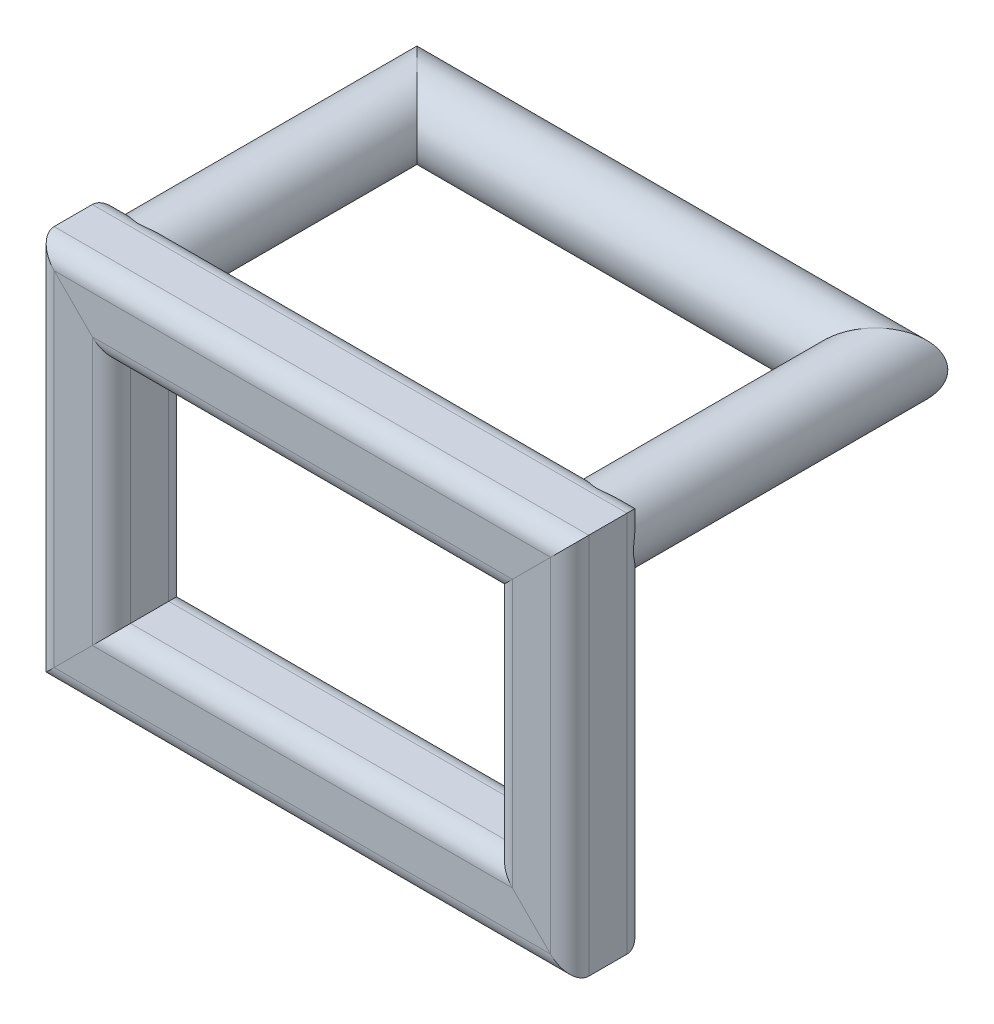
ISO-10303-21;
HEADER;
FILE_DESCRIPTION(('STEP AP214'),'2;1');
FILE_NAME('part.step','',(''),(''),'','','');
FILE_SCHEMA(('AUTOMOTIVE_DESIGN { 1 0 10303 214 1 1 1 1 }'));
ENDSEC;
DATA;
#1=APPLICATION_CONTEXT('core data for automotive mechanical design processes');
#2=APPLICATION_PROTOCOL_DEFINITION('international standard','automotive_design',2000,#1);
#3=PRODUCT_CONTEXT('',#1,'mechanical');
#4=PRODUCT('Part','Part','',(#3));
#5=PRODUCT_RELATED_PRODUCT_CATEGORY('part','',(#4));
#6=PRODUCT_DEFINITION_FORMATION('','',#4);
#7=PRODUCT_DEFINITION_CONTEXT('part definition',#1,'design');
#8=PRODUCT_DEFINITION('design','',#6,#7);
#9=PRODUCT_DEFINITION_SHAPE('','',#8);
#10=(LENGTH_UNIT() NAMED_UNIT(*) SI_UNIT(.MILLI.,.METRE.));
#11=(NAMED_UNIT(*) PLANE_ANGLE_UNIT() SI_UNIT($,.RADIAN.));
#12=(NAMED_UNIT(*) SI_UNIT($,.STERADIAN.) SOLID_ANGLE_UNIT());
#13=UNCERTAINTY_MEASURE_WITH_UNIT(LENGTH_MEASURE(1.E-05),#10,'distance_accuracy_value','');
#14=(GEOMETRIC_REPRESENTATION_CONTEXT(3) GLOBAL_UNCERTAINTY_ASSIGNED_CONTEXT((#13)) GLOBAL_UNIT_ASSIGNED_CONTEXT((#10,
#11,#12)) REPRESENTATION_CONTEXT('',''));
#15=CARTESIAN_POINT('',(0.,0.,0.));
#16=DIRECTION('',(0.,0.,1.));
#17=DIRECTION('',(1.,0.,0.));
#18=AXIS2_PLACEMENT_3D('',#15,#16,#17);
#19=CARTESIAN_POINT('',(0.,0.,-203.2));
#20=DIRECTION('',(0.,0.,1.));
#21=DIRECTION('',(1.,0.,0.));
#22=AXIS2_PLACEMENT_3D('',#19,#20,#21);
#23=CYLINDRICAL_SURFACE('',#22,20.447);
#24=CARTESIAN_POINT('',(0.,0.,-203.2));
#25=DIRECTION('',(0.707106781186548,0.,-0.707106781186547));
#26=DIRECTION('',(0.707106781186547,0.,0.707106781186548));
#27=AXIS2_PLACEMENT_3D('',#24,#25,#26);
#28=ELLIPSE('',#27,28.9164247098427,20.447);
#29=CARTESIAN_POINT('',(20.447,0.,-182.753));
#30=VERTEX_POINT('',#29);
#31=EDGE_CURVE('E201',#30,#30,#28,.T.);
#32=ORIENTED_EDGE('',*,*,#31,.T.);
#33=EDGE_LOOP('',(#32));
#34=FACE_BOUND('',#33,.T.);
#35=CARTESIAN_POINT('',(0.,0.,-25.4));
#36=DIRECTION('',(0.,0.,1.));
#37=DIRECTION('',(1.,0.,0.));
#38=AXIS2_PLACEMENT_3D('',#35,#36,#37);
#39=CIRCLE('',#38,20.447);
#40=CARTESIAN_POINT('',(16.0246625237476,-12.7,-25.4));
#41=VERTEX_POINT('',#40);
#42=CARTESIAN_POINT('',(16.0246625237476,12.7,-25.4));
#43=VERTEX_POINT('',#42);
#44=EDGE_CURVE('E153',#41,#43,#39,.T.);
#45=ORIENTED_EDGE('',*,*,#44,.T.);
#46=CARTESIAN_POINT('',(16.0246625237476,12.7,-25.4));
#47=CARTESIAN_POINT('',(15.8551998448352,12.913843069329,-25.4000003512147));
#48=CARTESIAN_POINT('',(15.6814681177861,13.1242451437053,-25.3945995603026));
#49=CARTESIAN_POINT('',(15.3260383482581,13.5375961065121,-25.3740377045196));
#50=CARTESIAN_POINT('',(15.1443431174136,13.7405475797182,-25.3588800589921));
#51=CARTESIAN_POINT('',(14.7738127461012,14.1381752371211,-25.3198844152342));
#52=CARTESIAN_POINT('',(14.5849927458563,14.3328672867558,-25.2960639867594));
#53=CARTESIAN_POINT('',(14.2003389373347,14.7140588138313,-25.2407601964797));
#54=CARTESIAN_POINT('',(14.0045045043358,14.9005575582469,-25.2092761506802));
#55=CARTESIAN_POINT('',(13.4100273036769,15.4446772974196,-25.1053392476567));
#56=CARTESIAN_POINT('',(13.0016323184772,15.7898966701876,-25.0230799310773));
#57=CARTESIAN_POINT('',(12.1617040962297,16.4455765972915,-24.8398778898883));
#58=CARTESIAN_POINT('',(11.7301598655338,16.7560204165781,-24.7389262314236));
#59=CARTESIAN_POINT('',(10.8900093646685,17.3122926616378,-24.5361927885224));
#60=CARTESIAN_POINT('',(10.483361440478,17.5614753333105,-24.4354824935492));
#61=CARTESIAN_POINT('',(9.65467046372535,18.0303623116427,-24.2300810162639));
#62=CARTESIAN_POINT('',(9.23263060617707,18.2500726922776,-24.1253906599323));
#63=CARTESIAN_POINT('',(7.94275112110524,18.8653236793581,-23.812633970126));
#64=CARTESIAN_POINT('',(7.05231078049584,19.2162174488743,-23.6061904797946));
#65=CARTESIAN_POINT('',(5.67893614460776,19.6484437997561,-23.3319532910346));
#66=CARTESIAN_POINT('',(5.21383208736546,19.777005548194,-23.2463017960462));
#67=CARTESIAN_POINT('',(4.27283919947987,20.0014095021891,-23.0922077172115));
#68=CARTESIAN_POINT('',(3.79695097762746,20.0972535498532,-23.0237641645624));
#69=CARTESIAN_POINT('',(2.83816491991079,20.25487742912,-22.9089847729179));
#70=CARTESIAN_POINT('',(2.35528811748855,20.3167437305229,-22.8625928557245));
#71=CARTESIAN_POINT('',(1.38456415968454,20.4058880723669,-22.7951699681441));
#72=CARTESIAN_POINT('',(0.896717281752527,20.4331680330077,-22.7741375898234));
#73=CARTESIAN_POINT('',(-0.0815660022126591,20.4527068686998,-22.7591104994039));
#74=CARTESIAN_POINT('',(-0.572005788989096,20.4448607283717,-22.7651968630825));
#75=CARTESIAN_POINT('',(-1.54997605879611,20.3940475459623,-22.8040894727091));
#76=CARTESIAN_POINT('',(-2.03750647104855,20.3510796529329,-22.836896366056));
#77=CARTESIAN_POINT('',(-3.00733560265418,20.2305517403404,-22.9267493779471));
#78=CARTESIAN_POINT('',(-3.48961611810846,20.1528963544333,-22.9838623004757));
#79=CARTESIAN_POINT('',(-4.44469559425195,19.9640069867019,-23.1181365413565));
#80=CARTESIAN_POINT('',(-4.91749316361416,19.8527681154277,-23.1953007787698));
#81=CARTESIAN_POINT('',(-5.94588829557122,19.5720433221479,-23.3817059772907));
#82=CARTESIAN_POINT('',(-6.49891021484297,19.395329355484,-23.4942779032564));
#83=CARTESIAN_POINT('',(-7.58570753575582,18.9966330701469,-23.7315992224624));
#84=CARTESIAN_POINT('',(-8.11947855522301,18.774640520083,-23.8563513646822));
#85=CARTESIAN_POINT('',(-9.16502754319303,18.2869984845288,-24.1083594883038));
#86=CARTESIAN_POINT('',(-9.67683757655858,18.0214155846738,-24.2356113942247));
#87=CARTESIAN_POINT('',(-10.6774111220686,17.4472155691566,-24.4835366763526));
#88=CARTESIAN_POINT('',(-11.1661766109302,17.1386021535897,-24.6042106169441));
#89=CARTESIAN_POINT('',(-12.0498808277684,16.5265258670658,-24.8134945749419));
#90=CARTESIAN_POINT('',(-12.4482140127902,16.2286877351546,-24.9042205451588));
#91=CARTESIAN_POINT('',(-13.2240786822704,15.6029415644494,-25.0680024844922));
#92=CARTESIAN_POINT('',(-13.6016218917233,15.2750507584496,-25.1410684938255));
#93=CARTESIAN_POINT('',(-14.3354639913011,14.5886139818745,-25.2636450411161));
#94=CARTESIAN_POINT('',(-14.6916566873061,14.2299333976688,-25.3130452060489));
#95=CARTESIAN_POINT('',(-15.2065003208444,13.6713759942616,-25.3641815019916));
#96=CARTESIAN_POINT('',(-15.3750394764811,13.4815588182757,-25.3774013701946));
#97=CARTESIAN_POINT('',(-15.705169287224,13.095496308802,-25.3953111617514));
#98=CARTESIAN_POINT('',(-15.8667579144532,12.8992491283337,-25.39999861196));
#99=CARTESIAN_POINT('',(-16.0246625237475,12.7,-25.4));
#100=B_SPLINE_CURVE_WITH_KNOTS('',3,(#46,#47,#48,#49,#50,#51,#52,#53,#54,#55,#56,#57,#58,#59,
#60,#61,#62,#63,#64,#65,#66,#67,#68,#69,#70,#71,#72,#73,#74,#75,#76,#77,#78,#79,#80,#81,#82,#83,
#84,#85,#86,#87,#88,#89,#90,#91,#92,#93,#94,#95,#96,#97,#98,#99),.UNSPECIFIED.,.F.,.F.,(4,2,2,2,
2,2,2,2,2,2,2,2,2,2,2,2,2,2,2,2,2,2,2,2,2,2,4),(0.,0.818371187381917,1.63645572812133,
2.45289020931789,3.26939758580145,4.89021170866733,6.51180249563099,7.97286515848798,
9.4336262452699,12.3593869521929,13.828512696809,15.2975557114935,16.7628426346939,
18.2280482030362,19.69763717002,21.1672617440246,22.640951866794,24.1148566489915,
25.8866155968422,27.6587753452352,29.428252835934,31.1975782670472,32.712818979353,
34.2271961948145,35.7485690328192,36.5108463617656,37.2733446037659),.UNSPECIFIED.);
#101=CARTESIAN_POINT('',(-14.4582123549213,14.4582123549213,-25.2777060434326));
#102=VERTEX_POINT('',#101);
#103=EDGE_CURVE('E117',#43,#102,#100,.T.);
#104=ORIENTED_EDGE('',*,*,#103,.T.);
#105=CARTESIAN_POINT('',(-12.7,16.0246625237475,-25.4));
#106=CARTESIAN_POINT('',(-12.913843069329,15.8551998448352,-25.4000003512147));
#107=CARTESIAN_POINT('',(-13.1242451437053,15.6814681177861,-25.3945995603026));
#108=CARTESIAN_POINT('',(-13.5375961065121,15.3260383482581,-25.3740377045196));
#109=CARTESIAN_POINT('',(-13.7405475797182,15.1443431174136,-25.3588800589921));
#110=CARTESIAN_POINT('',(-14.1381752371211,14.7738127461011,-25.3198844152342));
#111=CARTESIAN_POINT('',(-14.3328672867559,14.5849927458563,-25.2960639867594));
#112=CARTESIAN_POINT('',(-14.7140588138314,14.2003389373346,-25.2407601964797));
#113=CARTESIAN_POINT('',(-14.900557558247,14.0045045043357,-25.2092761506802));
#114=CARTESIAN_POINT('',(-15.4446772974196,13.4100273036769,-25.1053392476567));
#115=CARTESIAN_POINT('',(-15.7898966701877,13.0016323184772,-25.0230799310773));
#116=CARTESIAN_POINT('',(-16.4455765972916,12.1617040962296,-24.8398778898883));
#117=CARTESIAN_POINT('',(-16.7560204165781,11.7301598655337,-24.7389262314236));
#118=CARTESIAN_POINT('',(-17.3122926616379,10.8900093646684,-24.5361927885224));
#119=CARTESIAN_POINT('',(-17.5614753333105,10.4833614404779,-24.4354824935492));
#120=CARTESIAN_POINT('',(-18.0303623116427,9.65467046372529,-24.2300810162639));
#121=CARTESIAN_POINT('',(-18.2500726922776,9.23263060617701,-24.1253906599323));
#122=CARTESIAN_POINT('',(-18.8653236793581,7.94275112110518,-23.812633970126));
#123=CARTESIAN_POINT('',(-19.2162174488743,7.05231078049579,-23.6061904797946));
#124=CARTESIAN_POINT('',(-19.6484437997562,5.6789361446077,-23.3319532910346));
#125=CARTESIAN_POINT('',(-19.777005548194,5.21383208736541,-23.2463017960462));
#126=CARTESIAN_POINT('',(-20.0014095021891,4.27283919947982,-23.0922077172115));
#127=CARTESIAN_POINT('',(-20.0972535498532,3.79695097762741,-23.0237641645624));
#128=CARTESIAN_POINT('',(-20.25487742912,2.83816491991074,-22.9089847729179));
#129=CARTESIAN_POINT('',(-20.3167437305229,2.3552881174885,-22.8625928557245));
#130=CARTESIAN_POINT('',(-20.4058880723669,1.3845641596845,-22.7951699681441));
#131=CARTESIAN_POINT('',(-20.4331680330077,0.896717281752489,-22.7741375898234));
#132=CARTESIAN_POINT('',(-20.4527068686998,-0.0815660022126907,-22.7591104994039));
#133=CARTESIAN_POINT('',(-20.4448607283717,-0.572005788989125,-22.7651968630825));
#134=CARTESIAN_POINT('',(-20.3940475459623,-1.54997605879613,-22.8040894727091));
#135=CARTESIAN_POINT('',(-20.3510796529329,-2.03750647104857,-22.836896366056));
#136=CARTESIAN_POINT('',(-20.2305517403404,-3.0073356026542,-22.9267493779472));
#137=CARTESIAN_POINT('',(-20.1528963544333,-3.48961611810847,-22.9838623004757));
#138=CARTESIAN_POINT('',(-19.9640069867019,-4.44469559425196,-23.1181365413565));
#139=CARTESIAN_POINT('',(-19.8527681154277,-4.91749316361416,-23.1953007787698));
#140=CARTESIAN_POINT('',(-19.5720433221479,-5.94588829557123,-23.3817059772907));
#141=CARTESIAN_POINT('',(-19.395329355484,-6.49891021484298,-23.4942779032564));
#142=CARTESIAN_POINT('',(-18.9966330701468,-7.58570753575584,-23.7315992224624));
#143=CARTESIAN_POINT('',(-18.774640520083,-8.11947855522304,-23.8563513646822));
#144=CARTESIAN_POINT('',(-18.2869984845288,-9.16502754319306,-24.1083594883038));
#145=CARTESIAN_POINT('',(-18.0214155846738,-9.67683757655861,-24.2356113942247));
#146=CARTESIAN_POINT('',(-17.4472155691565,-10.6774111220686,-24.4835366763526));
#147=CARTESIAN_POINT('',(-17.1386021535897,-11.1661766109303,-24.6042106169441));
#148=CARTESIAN_POINT('',(-16.5265258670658,-12.0498808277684,-24.8134945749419));
#149=CARTESIAN_POINT('',(-16.2286877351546,-12.4482140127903,-24.9042205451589));
#150=CARTESIAN_POINT('',(-15.6029415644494,-13.2240786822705,-25.0680024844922));
#151=CARTESIAN_POINT('',(-15.2750507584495,-13.6016218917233,-25.1410684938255));
#152=CARTESIAN_POINT('',(-14.5886139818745,-14.3354639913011,-25.2636450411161));
#153=CARTESIAN_POINT('',(-14.2299333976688,-14.6916566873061,-25.3130452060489));
#154=CARTESIAN_POINT('',(-13.6713759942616,-15.2065003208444,-25.3641815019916));
#155=CARTESIAN_POINT('',(-13.4815588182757,-15.3750394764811,-25.3774013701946));
#156=CARTESIAN_POINT('',(-13.095496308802,-15.705169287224,-25.3953111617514));
#157=CARTESIAN_POINT('',(-12.8992491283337,-15.8667579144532,-25.39999861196));
#158=CARTESIAN_POINT('',(-12.7,-16.0246625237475,-25.4));
#159=B_SPLINE_CURVE_WITH_KNOTS('',3,(#105,#106,#107,#108,#109,#110,#111,#112,#113,#114,#115,
#116,#117,#118,#119,#120,#121,#122,#123,#124,#125,#126,#127,#128,#129,#130,#131,#132,#133,#134,
#135,#136,#137,#138,#139,#140,#141,#142,#143,#144,#145,#146,#147,#148,#149,#150,#151,#152,#153,
#154,#155,#156,#157,#158),.UNSPECIFIED.,.F.,.F.,(4,2,2,2,2,2,2,2,2,2,2,2,2,2,2,2,2,2,2,2,2,2,2,
2,2,2,4),(0.,0.818371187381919,1.63645572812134,2.45289020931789,3.26939758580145,
4.89021170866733,6.511802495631,7.97286515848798,9.43362624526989,12.3593869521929,
13.828512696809,15.2975557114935,16.7628426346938,18.2280482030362,19.6976371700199,
21.1672617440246,22.640951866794,24.1148566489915,25.8866155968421,27.6587753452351,
29.428252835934,31.1975782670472,32.712818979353,34.2271961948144,35.7485690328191,
36.5108463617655,37.2733446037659),.UNSPECIFIED.);
#160=CARTESIAN_POINT('',(-12.7,-16.0246625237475,-25.4));
#161=VERTEX_POINT('',#160);
#162=EDGE_CURVE('E152',#102,#161,#159,.T.);
#163=ORIENTED_EDGE('',*,*,#162,.T.);
#164=CARTESIAN_POINT('',(12.7,-16.0246625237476,-25.4));
#165=VERTEX_POINT('',#164);
#166=EDGE_CURVE('E62',#161,#165,#39,.T.);
#167=ORIENTED_EDGE('',*,*,#166,.T.);
#168=CARTESIAN_POINT('',(12.7,-16.0246625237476,-25.4));
#169=CARTESIAN_POINT('',(12.8996942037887,-15.8664051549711,-25.3999982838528));
#170=CARTESIAN_POINT('',(13.096372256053,-15.7044479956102,-25.3952900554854));
#171=CARTESIAN_POINT('',(13.4832690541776,-15.3735491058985,-25.3773023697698));
#172=CARTESIAN_POINT('',(13.6734895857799,-15.2046093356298,-25.3640253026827));
#173=CARTESIAN_POINT('',(14.2310654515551,-14.6904986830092,-25.3128668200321));
#174=CARTESIAN_POINT('',(14.5884701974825,-14.3355480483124,-25.2636308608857));
#175=CARTESIAN_POINT('',(15.2740165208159,-13.6027969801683,-25.1412928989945));
#176=CARTESIAN_POINT('',(15.6021675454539,-13.2250039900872,-25.0681986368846));
#177=CARTESIAN_POINT('',(16.23069768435,-12.4457564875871,-24.9037009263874));
#178=CARTESIAN_POINT('',(16.5308433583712,-12.0441421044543,-24.8121607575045));
#179=CARTESIAN_POINT('',(16.8151261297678,-11.6332,-24.7148132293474));
#180=B_SPLINE_CURVE_WITH_KNOTS('',3,(#168,#169,#170,#171,#172,#173,#174,#175,#176,#177,#178,
#179),.UNSPECIFIED.,.F.,.F.,(4,2,2,2,2,4),(0.,0.764198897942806,1.52818471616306,
3.04420002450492,4.55972396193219,6.0869239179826),.UNSPECIFIED.);
#181=CARTESIAN_POINT('',(14.4582123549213,-14.4582123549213,-25.2777060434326));
#182=VERTEX_POINT('',#181);
#183=EDGE_CURVE('E85',#165,#182,#180,.T.);
#184=ORIENTED_EDGE('',*,*,#183,.T.);
#185=CARTESIAN_POINT('',(11.0236,-17.2209190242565,-24.5680786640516));
#186=CARTESIAN_POINT('',(11.4953349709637,-16.9190031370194,-24.683084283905));
#187=CARTESIAN_POINT('',(11.9560186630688,-16.5967286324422,-24.7926505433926));
#188=CARTESIAN_POINT('',(12.8477336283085,-15.9162402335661,-24.9910670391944));
#189=CARTESIAN_POINT('',(13.2789995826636,-15.5583859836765,-25.0800993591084));
#190=CARTESIAN_POINT('',(13.904792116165,-14.9938533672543,-25.1926007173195));
#191=CARTESIAN_POINT('',(14.1099483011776,-14.8009694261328,-25.2266025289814));
#192=CARTESIAN_POINT('',(14.5127134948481,-14.4062637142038,-25.2864414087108));
#193=CARTESIAN_POINT('',(14.7103231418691,-14.2044427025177,-25.312279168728));
#194=CARTESIAN_POINT('',(15.0992677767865,-13.7903341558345,-25.3548365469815));
#195=CARTESIAN_POINT('',(15.2905277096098,-13.5779670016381,-25.3714695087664));
#196=CARTESIAN_POINT('',(15.6643149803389,-13.144999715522,-25.3940535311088));
#197=CARTESIAN_POINT('',(15.8468388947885,-12.9243964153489,-25.400000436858));
#198=CARTESIAN_POINT('',(16.0246625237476,-12.7,-25.4000000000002));
#199=B_SPLINE_CURVE_WITH_KNOTS('',3,(#185,#186,#187,#188,#189,#190,#191,#192,#193,#194,#195,
#196,#197,#198),.UNSPECIFIED.,.F.,.F.,(4,2,2,2,2,2,4),(0.,1.71571259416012,3.41556997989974,
4.26616693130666,5.11669177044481,5.97509308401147,6.83382807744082),.UNSPECIFIED.);
#200=EDGE_CURVE('E155',#182,#41,#199,.T.);
#201=ORIENTED_EDGE('',*,*,#200,.T.);
#202=EDGE_LOOP('',(#45,#104,#163,#167,#184,#201));
#203=FACE_BOUND('',#202,.T.);
#204=ADVANCED_FACE('F41',(#34,#203),#23,.F.);
#205=CARTESIAN_POINT('',(0.,0.,-203.2));
#206=DIRECTION('',(0.,0.,1.));
#207=DIRECTION('',(1.,0.,0.));
#208=AXIS2_PLACEMENT_3D('',#205,#206,#207);
#209=CYLINDRICAL_SURFACE('',#208,24.13);
#210=CARTESIAN_POINT('',(0.,0.,-203.2));
#211=DIRECTION('',(0.707106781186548,0.,-0.707106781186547));
#212=DIRECTION('',(0.707106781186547,0.,0.707106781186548));
#213=AXIS2_PLACEMENT_3D('',#210,#211,#212);
#214=ELLIPSE('',#213,34.1249732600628,24.13);
#215=CARTESIAN_POINT('',(24.13,0.,-179.07));
#216=VERTEX_POINT('',#215);
#217=EDGE_CURVE('E185',#216,#216,#214,.T.);
#218=ORIENTED_EDGE('',*,*,#217,.F.);
#219=EDGE_LOOP('',(#218));
#220=FACE_BOUND('',#219,.T.);
#221=CARTESIAN_POINT('',(20.5174779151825,12.7,-25.4));
#222=CARTESIAN_POINT('',(20.3729719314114,12.933481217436,-25.40000266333));
#223=CARTESIAN_POINT('',(20.224482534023,13.1644443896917,-25.3935621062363));
#224=CARTESIAN_POINT('',(19.9200842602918,13.620651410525,-25.3686442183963));
#225=CARTESIAN_POINT('',(19.764178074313,13.8458972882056,-25.3501712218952));
#226=CARTESIAN_POINT('',(19.4457851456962,14.2896031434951,-25.3020967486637));
#227=CARTESIAN_POINT('',(19.2833157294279,14.5080786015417,-25.2725230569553));
#228=CARTESIAN_POINT('',(18.95191820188,14.9383895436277,-25.2030845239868));
#229=CARTESIAN_POINT('',(18.7829894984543,15.1502244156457,-25.1632187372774));
#230=CARTESIAN_POINT('',(18.2725523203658,15.7687448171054,-25.0308034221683));
#231=CARTESIAN_POINT('',(17.9223464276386,16.1654545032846,-24.9246222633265));
#232=CARTESIAN_POINT('',(17.2017468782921,16.9302502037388,-24.6814953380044));
#233=CARTESIAN_POINT('',(16.8313386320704,17.2983150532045,-24.5445271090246));
#234=CARTESIAN_POINT('',(15.9859620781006,18.0862364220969,-24.210910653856));
#235=CARTESIAN_POINT('',(15.5065173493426,18.4985740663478,-24.0077805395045));
#236=CARTESIAN_POINT('',(14.7707471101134,19.0835064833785,-23.6813808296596));
#237=CARTESIAN_POINT('',(14.522687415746,19.2729123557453,-23.5689463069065));
#238=CARTESIAN_POINT('',(14.021279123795,19.6407044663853,-23.337847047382));
#239=CARTESIAN_POINT('',(13.7679297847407,19.8190891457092,-23.2191814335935));
#240=CARTESIAN_POINT('',(12.9957480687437,20.3409924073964,-22.8531729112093));
#241=CARTESIAN_POINT('',(12.4692632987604,20.6677076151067,-22.597838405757));
#242=CARTESIAN_POINT('',(11.3976831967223,21.2774525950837,-22.0743610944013));
#243=CARTESIAN_POINT('',(10.852584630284,21.5604747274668,-21.8062160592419));
#244=CARTESIAN_POINT('',(10.0077087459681,21.9591861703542,-21.3946190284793));
#245=CARTESIAN_POINT('',(9.71453158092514,22.0904495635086,-21.2525048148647));
#246=CARTESIAN_POINT('',(9.12298469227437,22.3412461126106,-20.968748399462));
#247=CARTESIAN_POINT('',(8.82461530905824,22.460780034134,-20.8271061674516));
#248=CARTESIAN_POINT('',(8.22213631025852,22.6882604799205,-20.5458521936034));
#249=CARTESIAN_POINT('',(7.91802117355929,22.7961951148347,-20.4062426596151));
#250=CARTESIAN_POINT('',(7.30396393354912,23.0002978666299,-20.1312298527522));
#251=CARTESIAN_POINT('',(6.99402159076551,23.0964654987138,-19.9958267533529));
#252=CARTESIAN_POINT('',(6.37070952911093,23.2760648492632,-19.7329196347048));
#253=CARTESIAN_POINT('',(6.05739679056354,23.3596046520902,-19.6053548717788));
#254=CARTESIAN_POINT('',(5.42405496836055,23.5147365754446,-19.3597720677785));
#255=CARTESIAN_POINT('',(5.10402506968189,23.5863272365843,-19.2417551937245));
#256=CARTESIAN_POINT('',(4.45746283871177,23.7170082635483,-19.0191893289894));
#257=CARTESIAN_POINT('',(4.13094425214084,23.7761224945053,-18.9146147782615));
#258=CARTESIAN_POINT('',(3.47075334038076,23.8814245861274,-18.7230973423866));
#259=CARTESIAN_POINT('',(3.13708325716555,23.9276164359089,-18.6361490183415));
#260=CARTESIAN_POINT('',(2.4587085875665,24.006867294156,-18.4837931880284));
#261=CARTESIAN_POINT('',(2.11391777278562,24.039752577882,-18.4186724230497));
#262=CARTESIAN_POINT('',(1.41911486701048,24.0907500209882,-18.3164169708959));
#263=CARTESIAN_POINT('',(1.06910423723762,24.1088662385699,-18.2792745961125));
#264=CARTESIAN_POINT('',(0.367795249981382,24.1297378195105,-18.236397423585));
#265=CARTESIAN_POINT('',(0.0165047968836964,24.1325430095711,-18.2305607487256));
#266=CARTESIAN_POINT('',(-0.684973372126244,24.1228271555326,-18.2505968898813));
#267=CARTESIAN_POINT('',(-1.0351609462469,24.1103042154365,-18.2764736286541));
#268=CARTESIAN_POINT('',(-1.72823697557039,24.0705139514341,-18.3571511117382));
#269=CARTESIAN_POINT('',(-2.0711620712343,24.0433717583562,-18.4117062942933));
#270=CARTESIAN_POINT('',(-2.75083474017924,23.9751241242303,-18.5452675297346));
#271=CARTESIAN_POINT('',(-3.08757970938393,23.9340129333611,-18.6242836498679));
#272=CARTESIAN_POINT('',(-3.75572569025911,23.8383302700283,-18.8022810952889));
#273=CARTESIAN_POINT('',(-4.08708702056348,23.7836858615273,-18.9013700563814));
#274=CARTESIAN_POINT('',(-4.74253151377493,23.6617083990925,-19.1145164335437));
#275=CARTESIAN_POINT('',(-5.06661412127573,23.5943743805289,-19.2285749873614));
#276=CARTESIAN_POINT('',(-5.72264190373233,23.444118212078,-19.4731421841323));
#277=CARTESIAN_POINT('',(-6.05426080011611,23.3606205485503,-19.6041667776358));
#278=CARTESIAN_POINT('',(-6.71056679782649,23.1806168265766,-19.8744724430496));
#279=CARTESIAN_POINT('',(-7.03525261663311,23.0841083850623,-20.0137550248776));
#280=CARTESIAN_POINT('',(-7.67842964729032,22.8782148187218,-20.2976789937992));
#281=CARTESIAN_POINT('',(-7.99691605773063,22.7688201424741,-20.4423243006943));
#282=CARTESIAN_POINT('',(-8.62791995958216,22.5372768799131,-20.7344719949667));
#283=CARTESIAN_POINT('',(-8.94043680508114,22.4151269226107,-20.8819746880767));
#284=CARTESIAN_POINT('',(-9.55987652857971,22.1580265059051,-21.1778628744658));
#285=CARTESIAN_POINT('',(-9.8667976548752,22.0230721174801,-21.3262486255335));
#286=CARTESIAN_POINT('',(-10.4751071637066,21.7403202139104,-21.6221365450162));
#287=CARTESIAN_POINT('',(-10.7764950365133,21.5925215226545,-21.7696386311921));
#288=CARTESIAN_POINT('',(-11.6720682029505,21.1298665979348,-22.2082997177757));
#289=CARTESIAN_POINT('',(-12.2581702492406,20.7955412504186,-22.4958611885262));
#290=CARTESIAN_POINT('',(-13.2847249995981,20.1508758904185,-22.990905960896));
#291=CARTESIAN_POINT('',(-13.7296012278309,19.8506051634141,-23.2023958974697));
#292=CARTESIAN_POINT('',(-14.6037787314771,19.2166084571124,-23.6071176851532));
#293=CARTESIAN_POINT('',(-15.0330785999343,18.8828794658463,-23.8003478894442));
#294=CARTESIAN_POINT('',(-15.8720280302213,18.1833044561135,-24.1620135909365));
#295=CARTESIAN_POINT('',(-16.2817593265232,17.8176141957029,-24.3305596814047));
#296=CARTESIAN_POINT('',(-17.0809162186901,17.05299636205,-24.6377991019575));
#297=CARTESIAN_POINT('',(-17.4703490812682,16.6540808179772,-24.7765031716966));
#298=CARTESIAN_POINT('',(-18.0925315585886,15.9702665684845,-24.9749227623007));
#299=CARTESIAN_POINT('',(-18.3321754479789,15.6946696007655,-25.0452553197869));
#300=CARTESIAN_POINT('',(-18.8004049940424,15.1306295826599,-25.1685740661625));
#301=CARTESIAN_POINT('',(-19.0289950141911,14.8421916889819,-25.2215671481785));
#302=CARTESIAN_POINT('',(-19.4755351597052,14.2512570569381,-25.3084634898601));
#303=CARTESIAN_POINT('',(-19.6934035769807,13.9486789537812,-25.3422362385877));
#304=CARTESIAN_POINT('',(-20.115819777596,13.332327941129,-25.3880186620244));
#305=CARTESIAN_POINT('',(-20.3203533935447,13.0185436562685,-25.4000055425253));
#306=CARTESIAN_POINT('',(-20.5174779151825,12.7,-25.4));
#307=B_SPLINE_CURVE_WITH_KNOTS('',3,(#221,#222,#223,#224,#225,#226,#227,#228,#229,#230,#231,
#232,#233,#234,#235,#236,#237,#238,#239,#240,#241,#242,#243,#244,#245,#246,#247,#248,#249,#250,
#251,#252,#253,#254,#255,#256,#257,#258,#259,#260,#261,#262,#263,#264,#265,#266,#267,#268,#269,
#270,#271,#272,#273,#274,#275,#276,#277,#278,#279,#280,#281,#282,#283,#284,#285,#286,#287,#288,
#289,#290,#291,#292,#293,#294,#295,#296,#297,#298,#299,#300,#301,#302,#303,#304,#305,#306),
.UNSPECIFIED.,.F.,.F.,(4,2,2,2,2,2,2,2,2,2,2,2,2,2,2,2,2,2,2,2,2,2,2,2,2,2,2,2,2,2,2,2,2,2,2,2,
2,2,2,2,2,2,4),(0.,0.823564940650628,1.64683338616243,2.46805478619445,3.28935165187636,
4.90603350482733,6.52389875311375,8.51332627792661,9.50831763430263,10.503449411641,
12.5118532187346,14.5206078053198,15.5741739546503,16.6276712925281,17.6822383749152,
18.736848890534,19.7818479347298,20.8269745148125,21.8700834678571,22.9128700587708,
23.968862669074,25.0245650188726,26.0768297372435,27.1292246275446,28.172751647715,
29.2167087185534,30.266419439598,31.316209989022,32.414395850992,33.5127831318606,
34.6119897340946,35.7113146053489,36.8109779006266,37.9107419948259,40.1084678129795,
41.8378896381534,43.5674672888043,45.2890418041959,47.0099957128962,48.1250868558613,
49.2397341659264,50.3618625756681,51.4851643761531),.UNSPECIFIED.);
#308=CARTESIAN_POINT('',(20.5174779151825,12.7,-25.4));
#309=VERTEX_POINT('',#308);
#310=CARTESIAN_POINT('',(-17.0624866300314,17.0624866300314,-24.6272255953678));
#311=VERTEX_POINT('',#310);
#312=EDGE_CURVE('E114',#309,#311,#307,.T.);
#313=ORIENTED_EDGE('',*,*,#312,.F.);
#314=CARTESIAN_POINT('',(0.,0.,-25.4));
#315=DIRECTION('',(0.,0.,1.));
#316=DIRECTION('',(1.,0.,0.));
#317=AXIS2_PLACEMENT_3D('',#314,#315,#316);
#318=CIRCLE('',#317,24.13);
#319=CARTESIAN_POINT('',(20.5174779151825,-12.7,-25.4));
#320=VERTEX_POINT('',#319);
#321=EDGE_CURVE('E54',#320,#309,#318,.T.);
#322=ORIENTED_EDGE('',*,*,#321,.F.);
#323=CARTESIAN_POINT('',(11.0236,-21.4647884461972,-21.8906737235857));
#324=CARTESIAN_POINT('',(11.314284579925,-21.3154904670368,-22.0330605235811));
#325=CARTESIAN_POINT('',(11.6023990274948,-21.1600733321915,-22.1743215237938));
#326=CARTESIAN_POINT('',(12.173401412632,-20.8368183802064,-22.4533456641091));
#327=CARTESIAN_POINT('',(12.4562881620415,-20.6689777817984,-22.5911080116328));
#328=CARTESIAN_POINT('',(13.0174061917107,-20.3202707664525,-22.8622041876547));
#329=CARTESIAN_POINT('',(13.2956221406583,-20.1393690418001,-22.9955244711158));
#330=CARTESIAN_POINT('',(13.8462444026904,-19.7648497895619,-23.2560374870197));
#331=CARTESIAN_POINT('',(14.1186511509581,-19.5712332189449,-23.383230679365));
#332=CARTESIAN_POINT('',(14.907685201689,-18.9851751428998,-23.7450157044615));
#333=CARTESIAN_POINT('',(15.4160613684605,-18.5751451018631,-23.9695912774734));
#334=CARTESIAN_POINT('',(16.4056611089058,-17.7071588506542,-24.3811268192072));
#335=CARTESIAN_POINT('',(16.8869169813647,-17.2492615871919,-24.5681322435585));
#336=CARTESIAN_POINT('',(17.6426339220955,-16.4672158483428,-24.8325487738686));
#337=CARTESIAN_POINT('',(17.9268677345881,-16.157437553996,-24.9247404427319));
#338=CARTESIAN_POINT('',(18.4812929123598,-15.520211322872,-25.0872713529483));
#339=CARTESIAN_POINT('',(18.7514894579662,-15.1927699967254,-25.1576187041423));
#340=CARTESIAN_POINT('',(19.2820271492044,-14.5137831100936,-25.2746335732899));
#341=CARTESIAN_POINT('',(19.5420191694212,-14.161865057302,-25.3207442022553));
#342=CARTESIAN_POINT('',(19.9183240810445,-13.6222433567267,-25.3677603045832));
#343=CARTESIAN_POINT('',(20.0415697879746,-13.4402647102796,-25.3797413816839));
#344=CARTESIAN_POINT('',(20.283218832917,-13.0727325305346,-25.3958618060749));
#345=CARTESIAN_POINT('',(20.401621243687,-12.8871783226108,-25.399999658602));
#346=CARTESIAN_POINT('',(20.5174779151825,-12.7,-25.4));
#347=B_SPLINE_CURVE_WITH_KNOTS('',3,(#323,#324,#325,#326,#327,#328,#329,#330,#331,#332,#333,
#334,#335,#336,#337,#338,#339,#340,#341,#342,#343,#344,#345,#346),.UNSPECIFIED.,.F.,.F.,(4,2,2,
2,2,2,2,2,2,2,2,4),(0.,1.06933108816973,2.13890229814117,3.21148169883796,4.28398046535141,
6.35296913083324,8.41943927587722,9.70966259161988,10.999406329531,12.317615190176,
12.9777556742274,13.6380219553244),.UNSPECIFIED.);
#348=CARTESIAN_POINT('',(17.0624866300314,-17.0624866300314,-24.6272255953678));
#349=VERTEX_POINT('',#348);
#350=EDGE_CURVE('E190',#349,#320,#347,.T.);
#351=ORIENTED_EDGE('',*,*,#350,.F.);
#352=CARTESIAN_POINT('',(12.7,-20.5174779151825,-25.4));
#353=CARTESIAN_POINT('',(12.9345660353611,-20.3723007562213,-25.4000027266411));
#354=CARTESIAN_POINT('',(13.1665902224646,-20.223102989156,-25.3935021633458));
#355=CARTESIAN_POINT('',(13.6248637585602,-19.9172207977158,-25.3683561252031));
#356=CARTESIAN_POINT('',(13.8511151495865,-19.7605390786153,-25.349715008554));
#357=CARTESIAN_POINT('',(14.296801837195,-19.4405115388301,-25.3012048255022));
#358=CARTESIAN_POINT('',(14.5162517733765,-19.2771820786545,-25.271361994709));
#359=CARTESIAN_POINT('',(14.9484416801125,-18.9440088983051,-25.201297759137));
#360=CARTESIAN_POINT('',(15.1611810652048,-18.7741646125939,-25.1610754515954));
#361=CARTESIAN_POINT('',(15.7783808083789,-18.2641586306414,-25.0283286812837));
#362=CARTESIAN_POINT('',(16.1730124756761,-17.9154557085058,-24.9224139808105));
#363=CARTESIAN_POINT('',(16.9338673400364,-17.1981044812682,-24.6801479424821));
#364=CARTESIAN_POINT('',(17.3000754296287,-16.8294457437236,-24.5437805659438));
#365=CARTESIAN_POINT('',(17.9948001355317,-16.084069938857,-24.2496271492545));
#366=CARTESIAN_POINT('',(18.3240148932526,-15.707764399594,-24.092439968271));
#367=CARTESIAN_POINT('',(18.9546209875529,-14.9407413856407,-23.7587962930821));
#368=CARTESIAN_POINT('',(19.2560116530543,-14.5500235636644,-23.5823393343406));
#369=CARTESIAN_POINT('',(19.8385270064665,-13.7456441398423,-23.209707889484));
#370=CARTESIAN_POINT('',(20.1189452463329,-13.3316520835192,-23.0131472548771));
#371=CARTESIAN_POINT('',(20.6510990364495,-12.4914207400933,-22.6086661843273));
#372=CARTESIAN_POINT('',(20.9028545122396,-12.0651902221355,-22.4007537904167));
#373=CARTESIAN_POINT('',(21.1406139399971,-11.6332,-22.1892589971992));
#374=B_SPLINE_CURVE_WITH_KNOTS('',3,(#352,#353,#354,#355,#356,#357,#358,#359,#360,#361,#362,
#363,#364,#365,#366,#367,#368,#369,#370,#371,#372,#373),.UNSPECIFIED.,.F.,.F.,(4,2,2,2,2,2,2,2,
2,2,4),(0.,0.8273893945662,1.65448193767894,2.47964930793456,3.30488847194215,4.91397401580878,
6.52390903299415,8.09484539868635,9.66581964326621,11.2765749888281,12.8862036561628),.UNSPECIFIED.);
#375=CARTESIAN_POINT('',(12.7,-20.5174779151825,-25.4));
#376=VERTEX_POINT('',#375);
#377=EDGE_CURVE('E124',#376,#349,#374,.T.);
#378=ORIENTED_EDGE('',*,*,#377,.F.);
#379=CARTESIAN_POINT('',(-12.7,-20.5174779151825,-25.4));
#380=VERTEX_POINT('',#379);
#381=EDGE_CURVE('E12',#380,#376,#318,.T.);
#382=ORIENTED_EDGE('',*,*,#381,.F.);
#383=CARTESIAN_POINT('',(-12.7,20.5174779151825,-25.4));
#384=CARTESIAN_POINT('',(-12.9334812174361,20.3729719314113,-25.40000266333));
#385=CARTESIAN_POINT('',(-13.1644443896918,20.224482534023,-25.3935621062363));
#386=CARTESIAN_POINT('',(-13.620651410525,19.9200842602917,-25.3686442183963));
#387=CARTESIAN_POINT('',(-13.8458972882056,19.7641780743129,-25.3501712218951));
#388=CARTESIAN_POINT('',(-14.2896031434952,19.4457851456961,-25.3020967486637));
#389=CARTESIAN_POINT('',(-14.5080786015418,19.2833157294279,-25.2725230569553));
#390=CARTESIAN_POINT('',(-14.9383895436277,18.9519182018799,-25.2030845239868));
#391=CARTESIAN_POINT('',(-15.1502244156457,18.7829894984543,-25.1632187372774));
#392=CARTESIAN_POINT('',(-15.7687448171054,18.2725523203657,-25.0308034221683));
#393=CARTESIAN_POINT('',(-16.1654545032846,17.9223464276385,-24.9246222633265));
#394=CARTESIAN_POINT('',(-16.9302502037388,17.201746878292,-24.6814953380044));
#395=CARTESIAN_POINT('',(-17.2983150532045,16.8313386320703,-24.5445271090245));
#396=CARTESIAN_POINT('',(-18.0862364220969,15.9859620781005,-24.210910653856));
#397=CARTESIAN_POINT('',(-18.4985740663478,15.5065173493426,-24.0077805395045));
#398=CARTESIAN_POINT('',(-19.0835064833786,14.7707471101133,-23.6813808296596));
#399=CARTESIAN_POINT('',(-19.2729123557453,14.5226874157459,-23.5689463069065));
#400=CARTESIAN_POINT('',(-19.6407044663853,14.021279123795,-23.337847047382));
#401=CARTESIAN_POINT('',(-19.8190891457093,13.7679297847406,-23.2191814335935));
#402=CARTESIAN_POINT('',(-20.3409924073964,12.9957480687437,-22.8531729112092));
#403=CARTESIAN_POINT('',(-20.6677076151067,12.4692632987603,-22.597838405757));
#404=CARTESIAN_POINT('',(-21.2774525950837,11.3976831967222,-22.0743610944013));
#405=CARTESIAN_POINT('',(-21.5604747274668,10.852584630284,-21.8062160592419));
#406=CARTESIAN_POINT('',(-21.9591861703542,10.0077087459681,-21.3946190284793));
#407=CARTESIAN_POINT('',(-22.0904495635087,9.71453158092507,-21.2525048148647));
#408=CARTESIAN_POINT('',(-22.3412461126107,9.1229846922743,-20.968748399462));
#409=CARTESIAN_POINT('',(-22.460780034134,8.82461530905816,-20.8271061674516));
#410=CARTESIAN_POINT('',(-22.6882604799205,8.22213631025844,-20.5458521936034));
#411=CARTESIAN_POINT('',(-22.7961951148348,7.91802117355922,-20.4062426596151));
#412=CARTESIAN_POINT('',(-23.0002978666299,7.30396393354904,-20.1312298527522));
#413=CARTESIAN_POINT('',(-23.0964654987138,6.99402159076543,-19.9958267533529));
#414=CARTESIAN_POINT('',(-23.2760648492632,6.37070952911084,-19.7329196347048));
#415=CARTESIAN_POINT('',(-23.3596046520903,6.05739679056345,-19.6053548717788));
#416=CARTESIAN_POINT('',(-23.5147365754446,5.42405496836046,-19.3597720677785));
#417=CARTESIAN_POINT('',(-23.5863272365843,5.1040250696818,-19.2417551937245));
#418=CARTESIAN_POINT('',(-23.7170082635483,4.45746283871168,-19.0191893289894));
#419=CARTESIAN_POINT('',(-23.7761224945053,4.13094425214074,-18.9146147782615));
#420=CARTESIAN_POINT('',(-23.8814245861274,3.47075334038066,-18.7230973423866));
#421=CARTESIAN_POINT('',(-23.9276164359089,3.13708325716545,-18.6361490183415));
#422=CARTESIAN_POINT('',(-24.0068672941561,2.4587085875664,-18.4837931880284));
#423=CARTESIAN_POINT('',(-24.0397525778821,2.11391777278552,-18.4186724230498));
#424=CARTESIAN_POINT('',(-24.0907500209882,1.41911486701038,-18.3164169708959));
#425=CARTESIAN_POINT('',(-24.1088662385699,1.06910423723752,-18.2792745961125));
#426=CARTESIAN_POINT('',(-24.1297378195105,0.367795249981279,-18.236397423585));
#427=CARTESIAN_POINT('',(-24.1325430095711,0.0165047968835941,-18.2305607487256));
#428=CARTESIAN_POINT('',(-24.1228271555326,-0.684973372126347,-18.2505968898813));
#429=CARTESIAN_POINT('',(-24.1103042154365,-1.03516094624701,-18.2764736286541));
#430=CARTESIAN_POINT('',(-24.0705139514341,-1.72823697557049,-18.3571511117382));
#431=CARTESIAN_POINT('',(-24.0433717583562,-2.07116207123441,-18.4117062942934));
#432=CARTESIAN_POINT('',(-23.9751241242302,-2.75083474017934,-18.5452675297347));
#433=CARTESIAN_POINT('',(-23.934012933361,-3.08757970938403,-18.6242836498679));
#434=CARTESIAN_POINT('',(-23.8383302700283,-3.75572569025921,-18.802281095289));
#435=CARTESIAN_POINT('',(-23.7836858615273,-4.08708702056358,-18.9013700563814));
#436=CARTESIAN_POINT('',(-23.6617083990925,-4.74253151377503,-19.1145164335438));
#437=CARTESIAN_POINT('',(-23.5943743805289,-5.06661412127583,-19.2285749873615));
#438=CARTESIAN_POINT('',(-23.444118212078,-5.72264190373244,-19.4731421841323));
#439=CARTESIAN_POINT('',(-23.3606205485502,-6.05426080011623,-19.6041667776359));
#440=CARTESIAN_POINT('',(-23.1806168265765,-6.71056679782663,-19.8744724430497));
#441=CARTESIAN_POINT('',(-23.0841083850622,-7.03525261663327,-20.0137550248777));
#442=CARTESIAN_POINT('',(-22.8782148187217,-7.6784296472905,-20.2976789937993));
#443=CARTESIAN_POINT('',(-22.768820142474,-7.99691605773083,-20.4423243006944));
#444=CARTESIAN_POINT('',(-22.5372768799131,-8.62791995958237,-20.7344719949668));
#445=CARTESIAN_POINT('',(-22.4151269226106,-8.94043680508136,-20.8819746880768));
#446=CARTESIAN_POINT('',(-22.158026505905,-9.55987652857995,-21.1778628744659));
#447=CARTESIAN_POINT('',(-22.02307211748,-9.86679765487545,-21.3262486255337));
#448=CARTESIAN_POINT('',(-21.7403202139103,-10.4751071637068,-21.6221365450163));
#449=CARTESIAN_POINT('',(-21.5925215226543,-10.7764950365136,-21.7696386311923));
#450=CARTESIAN_POINT('',(-21.1298665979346,-11.6720682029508,-22.2082997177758));
#451=CARTESIAN_POINT('',(-20.7955412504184,-12.2581702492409,-22.4958611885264));
#452=CARTESIAN_POINT('',(-20.1508758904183,-13.2847249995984,-22.9909059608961));
#453=CARTESIAN_POINT('',(-19.8506051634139,-13.7296012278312,-23.2023958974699));
#454=CARTESIAN_POINT('',(-19.2166084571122,-14.6037787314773,-23.6071176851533));
#455=CARTESIAN_POINT('',(-18.8828794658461,-15.0330785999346,-23.8003478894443));
#456=CARTESIAN_POINT('',(-18.1833044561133,-15.8720280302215,-24.1620135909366));
#457=CARTESIAN_POINT('',(-17.8176141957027,-16.2817593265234,-24.3305596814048));
#458=CARTESIAN_POINT('',(-17.0529963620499,-17.0809162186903,-24.6377991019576));
#459=CARTESIAN_POINT('',(-16.654080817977,-17.4703490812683,-24.7765031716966));
#460=CARTESIAN_POINT('',(-15.9702665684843,-18.0925315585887,-24.9749227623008));
#461=CARTESIAN_POINT('',(-15.6946696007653,-18.3321754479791,-25.0452553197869));
#462=CARTESIAN_POINT('',(-15.1306295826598,-18.8004049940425,-25.1685740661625));
#463=CARTESIAN_POINT('',(-14.8421916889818,-19.0289950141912,-25.2215671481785));
#464=CARTESIAN_POINT('',(-14.251257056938,-19.4755351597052,-25.3084634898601));
#465=CARTESIAN_POINT('',(-13.9486789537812,-19.6934035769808,-25.3422362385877));
#466=CARTESIAN_POINT('',(-13.3323279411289,-20.115819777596,-25.3880186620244));
#467=CARTESIAN_POINT('',(-13.0185436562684,-20.3203533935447,-25.4000055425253));
#468=CARTESIAN_POINT('',(-12.7,-20.5174779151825,-25.4));
#469=B_SPLINE_CURVE_WITH_KNOTS('',3,(#383,#384,#385,#386,#387,#388,#389,#390,#391,#392,#393,
#394,#395,#396,#397,#398,#399,#400,#401,#402,#403,#404,#405,#406,#407,#408,#409,#410,#411,#412,
#413,#414,#415,#416,#417,#418,#419,#420,#421,#422,#423,#424,#425,#426,#427,#428,#429,#430,#431,
#432,#433,#434,#435,#436,#437,#438,#439,#440,#441,#442,#443,#444,#445,#446,#447,#448,#449,#450,
#451,#452,#453,#454,#455,#456,#457,#458,#459,#460,#461,#462,#463,#464,#465,#466,#467,#468),
.UNSPECIFIED.,.F.,.F.,(4,2,2,2,2,2,2,2,2,2,2,2,2,2,2,2,2,2,2,2,2,2,2,2,2,2,2,2,2,2,2,2,2,2,2,2,
2,2,2,2,2,2,4),(0.,0.82356494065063,1.64683338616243,2.46805478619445,3.28935165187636,
4.90603350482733,6.52389875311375,8.51332627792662,9.50831763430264,10.5034494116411,
12.5118532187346,14.5206078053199,15.5741739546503,16.6276712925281,17.6822383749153,
18.7368488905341,19.7818479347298,20.8269745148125,21.8700834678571,22.9128700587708,
23.968862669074,25.0245650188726,26.0768297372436,27.1292246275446,28.1727516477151,
29.2167087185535,30.2664194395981,31.316209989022,32.4143958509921,33.5127831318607,
34.6119897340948,35.7113146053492,36.8109779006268,37.9107419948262,40.1084678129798,
41.8378896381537,43.5674672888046,45.2890418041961,47.0099957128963,48.1250868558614,
49.2397341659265,50.3618625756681,51.4851643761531),.UNSPECIFIED.);
#470=EDGE_CURVE('E122',#311,#380,#469,.T.);
#471=ORIENTED_EDGE('',*,*,#470,.F.);
#472=EDGE_LOOP('',(#313,#322,#351,#378,#382,#471));
#473=FACE_BOUND('',#472,.T.);
#474=ADVANCED_FACE('F43',(#220,#473),#209,.T.);
#475=CARTESIAN_POINT('',(0.,0.,-203.2));
#476=DIRECTION('',(0.707106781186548,0.,-0.707106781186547));
#477=DIRECTION('',(-0.707106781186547,0.,-0.707106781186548));
#478=AXIS2_PLACEMENT_3D('',#475,#476,#477);
#479=PLANE('',#478);
#480=ORIENTED_EDGE('',*,*,#31,.F.);
#481=EDGE_LOOP('',(#480));
#482=FACE_BOUND('',#481,.T.);
#483=ORIENTED_EDGE('',*,*,#217,.T.);
#484=EDGE_LOOP('',(#483));
#485=FACE_BOUND('',#484,.T.);
#486=ADVANCED_FACE('F178',(#482,#485),#479,.T.);
#487=CARTESIAN_POINT('',(-12.7,0.,-12.7));
#488=DIRECTION('',(0.,-1.,0.));
#489=DIRECTION('',(1.,0.,0.));
#490=AXIS2_PLACEMENT_3D('',#487,#488,#489);
#491=CYLINDRICAL_SURFACE('',#490,12.7);
#492=CARTESIAN_POINT('',(-12.7,12.7,-12.7));
#493=DIRECTION('',(0.707106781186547,0.707106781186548,0.));
#494=DIRECTION('',(-0.707106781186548,0.707106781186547,0.));
#495=AXIS2_PLACEMENT_3D('',#492,#493,#494);
#496=ELLIPSE('',#495,17.9605122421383,12.7);
#497=EDGE_CURVE('E125',#102,#311,#496,.T.);
#498=ORIENTED_EDGE('',*,*,#497,.T.);
#499=ORIENTED_EDGE('',*,*,#470,.T.);
#500=DIRECTION('',(0.,-1.,0.));
#501=VECTOR('',#500,1.);
#502=CARTESIAN_POINT('',(-12.7,0.,-25.4));
#503=LINE('',#502,#501);
#504=EDGE_CURVE('E52',#161,#380,#503,.T.);
#505=ORIENTED_EDGE('',*,*,#504,.F.);
#506=ORIENTED_EDGE('',*,*,#162,.F.);
#507=EDGE_LOOP('',(#498,#499,#505,#506));
#508=FACE_BOUND('',#507,.T.);
#509=ADVANCED_FACE('F140',(#508),#491,.F.);
#510=CARTESIAN_POINT('',(304.8,12.7,-12.7));
#511=DIRECTION('',(-1.,0.,0.));
#512=DIRECTION('',(0.,0.,1.));
#513=AXIS2_PLACEMENT_3D('',#510,#511,#512);
#514=CYLINDRICAL_SURFACE('',#513,12.7);
#515=DIRECTION('',(-1.,0.,0.));
#516=VECTOR('',#515,1.);
#517=CARTESIAN_POINT('',(304.8,12.7,-25.4));
#518=LINE('',#517,#516);
#519=EDGE_CURVE('E104',#309,#43,#518,.T.);
#520=ORIENTED_EDGE('',*,*,#519,.F.);
#521=ORIENTED_EDGE('',*,*,#312,.T.);
#522=ORIENTED_EDGE('',*,*,#497,.F.);
#523=ORIENTED_EDGE('',*,*,#103,.F.);
#524=EDGE_LOOP('',(#520,#521,#522,#523));
#525=FACE_BOUND('',#524,.T.);
#526=ADVANCED_FACE('F112',(#525),#514,.F.);
#527=CARTESIAN_POINT('',(12.7,0.,-12.7));
#528=DIRECTION('',(0.,-1.,0.));
#529=DIRECTION('',(1.,0.,0.));
#530=AXIS2_PLACEMENT_3D('',#527,#528,#529);
#531=CYLINDRICAL_SURFACE('',#530,12.7);
#532=DIRECTION('',(0.,-1.,0.));
#533=VECTOR('',#532,1.);
#534=CARTESIAN_POINT('',(12.7,0.,-25.4));
#535=LINE('',#534,#533);
#536=EDGE_CURVE('E46',#165,#376,#535,.T.);
#537=ORIENTED_EDGE('',*,*,#536,.T.);
#538=ORIENTED_EDGE('',*,*,#377,.T.);
#539=CARTESIAN_POINT('',(12.7,-12.7,-12.7));
#540=DIRECTION('',(0.707106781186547,0.707106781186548,0.));
#541=DIRECTION('',(-0.707106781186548,0.707106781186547,0.));
#542=AXIS2_PLACEMENT_3D('',#539,#540,#541);
#543=ELLIPSE('',#542,17.9605122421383,12.7);
#544=EDGE_CURVE('E90',#349,#182,#543,.T.);
#545=ORIENTED_EDGE('',*,*,#544,.T.);
#546=ORIENTED_EDGE('',*,*,#183,.F.);
#547=EDGE_LOOP('',(#537,#538,#545,#546));
#548=FACE_BOUND('',#547,.T.);
#549=ADVANCED_FACE('F139',(#548),#531,.F.);
#550=CARTESIAN_POINT('',(304.8,-12.7,-12.7));
#551=DIRECTION('',(-1.,0.,0.));
#552=DIRECTION('',(0.,0.,1.));
#553=AXIS2_PLACEMENT_3D('',#550,#551,#552);
#554=CYLINDRICAL_SURFACE('',#553,12.7);
#555=ORIENTED_EDGE('',*,*,#544,.F.);
#556=ORIENTED_EDGE('',*,*,#350,.T.);
#557=DIRECTION('',(-1.,0.,0.));
#558=VECTOR('',#557,1.);
#559=CARTESIAN_POINT('',(304.8,-12.7,-25.4));
#560=LINE('',#559,#558);
#561=EDGE_CURVE('E107',#320,#41,#560,.T.);
#562=ORIENTED_EDGE('',*,*,#561,.T.);
#563=ORIENTED_EDGE('',*,*,#200,.F.);
#564=EDGE_LOOP('',(#555,#556,#562,#563));
#565=FACE_BOUND('',#564,.T.);
#566=ADVANCED_FACE('F143',(#565),#554,.F.);
#567=CARTESIAN_POINT('',(292.1,-203.2,-25.4));
#568=DIRECTION('',(0.,0.,1.));
#569=DIRECTION('',(1.,0.,0.));
#570=AXIS2_PLACEMENT_3D('',#567,#568,#569);
#571=PLANE('',#570);
#572=ORIENTED_EDGE('',*,*,#561,.F.);
#573=ORIENTED_EDGE('',*,*,#321,.T.);
#574=ORIENTED_EDGE('',*,*,#519,.T.);
#575=ORIENTED_EDGE('',*,*,#44,.F.);
#576=EDGE_LOOP('',(#572,#573,#574,#575));
#577=FACE_BOUND('',#576,.T.);
#578=ADVANCED_FACE('F103',(#577),#571,.T.);
#579=ORIENTED_EDGE('',*,*,#504,.T.);
#580=ORIENTED_EDGE('',*,*,#381,.T.);
#581=ORIENTED_EDGE('',*,*,#536,.F.);
#582=ORIENTED_EDGE('',*,*,#166,.F.);
#583=EDGE_LOOP('',(#579,#580,#581,#582));
#584=FACE_BOUND('',#583,.T.);
#585=ADVANCED_FACE('F141',(#584),#571,.T.);
#586=CLOSED_SHELL('',(#204,#474,#486,#509,#526,#549,#566,#578,#585));
#587=MANIFOLD_SOLID_BREP('B2',#586);
#588=CARTESIAN_POINT('',(304.8,0.,0.));
#589=DIRECTION('',(0.,0.,-1.));
#590=DIRECTION('',(-1.,0.,0.));
#591=AXIS2_PLACEMENT_3D('',#588,#589,#590);
#592=CYLINDRICAL_SURFACE('',#591,20.447);
#593=CARTESIAN_POINT('',(304.8,0.,-203.2));
#594=DIRECTION('',(0.707106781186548,0.,0.707106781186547));
#595=DIRECTION('',(0.707106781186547,0.,-0.707106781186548));
#596=AXIS2_PLACEMENT_3D('',#593,#594,#595);
#597=ELLIPSE('',#596,28.9164247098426,20.447);
#598=CARTESIAN_POINT('',(325.247,0.,-223.647));
#599=VERTEX_POINT('',#598);
#600=EDGE_CURVE('E357',#599,#599,#597,.T.);
#601=ORIENTED_EDGE('',*,*,#600,.F.);
#602=EDGE_LOOP('',(#601));
#603=FACE_BOUND('',#602,.T.);
#604=CARTESIAN_POINT('',(317.5,-16.0246625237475,-25.4));
#605=CARTESIAN_POINT('',(317.713843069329,-15.8551998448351,-25.4000003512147));
#606=CARTESIAN_POINT('',(317.924245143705,-15.681468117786,-25.3945995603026));
#607=CARTESIAN_POINT('',(318.337596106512,-15.326038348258,-25.3740377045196));
#608=CARTESIAN_POINT('',(318.540547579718,-15.1443431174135,-25.3588800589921));
#609=CARTESIAN_POINT('',(318.938175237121,-14.773812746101,-25.3198844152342));
#610=CARTESIAN_POINT('',(319.132867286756,-14.5849927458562,-25.2960639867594));
#611=CARTESIAN_POINT('',(319.514058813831,-14.2003389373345,-25.2407601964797));
#612=CARTESIAN_POINT('',(319.700557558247,-14.0045045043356,-25.2092761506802));
#613=CARTESIAN_POINT('',(320.24467729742,-13.4100273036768,-25.1053392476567));
#614=CARTESIAN_POINT('',(320.589896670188,-13.0016323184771,-25.0230799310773));
#615=CARTESIAN_POINT('',(321.245576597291,-12.1617040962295,-24.8398778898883));
#616=CARTESIAN_POINT('',(321.556020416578,-11.7301598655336,-24.7389262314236));
#617=CARTESIAN_POINT('',(322.112292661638,-10.8900093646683,-24.5361927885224));
#618=CARTESIAN_POINT('',(322.36147533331,-10.4833614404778,-24.4354824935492));
#619=CARTESIAN_POINT('',(322.830362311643,-9.6546704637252,-24.2300810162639));
#620=CARTESIAN_POINT('',(323.050072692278,-9.23263060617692,-24.1253906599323));
#621=CARTESIAN_POINT('',(323.665323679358,-7.94275112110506,-23.812633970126));
#622=CARTESIAN_POINT('',(324.016217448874,-7.05231078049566,-23.6061904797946));
#623=CARTESIAN_POINT('',(324.448443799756,-5.67893614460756,-23.3319532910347));
#624=CARTESIAN_POINT('',(324.577005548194,-5.21383208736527,-23.2463017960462));
#625=CARTESIAN_POINT('',(324.801409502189,-4.27283919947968,-23.0922077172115));
#626=CARTESIAN_POINT('',(324.897253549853,-3.79695097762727,-23.0237641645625));
#627=CARTESIAN_POINT('',(325.05487742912,-2.83816491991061,-22.9089847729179));
#628=CARTESIAN_POINT('',(325.116743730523,-2.35528811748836,-22.8625928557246));
#629=CARTESIAN_POINT('',(325.205888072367,-1.38456415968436,-22.7951699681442));
#630=CARTESIAN_POINT('',(325.233168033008,-0.896717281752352,-22.7741375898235));
#631=CARTESIAN_POINT('',(325.2527068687,0.0815660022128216,-22.759110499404));
#632=CARTESIAN_POINT('',(325.244860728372,0.572005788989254,-22.7651968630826));
#633=CARTESIAN_POINT('',(325.194047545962,1.54997605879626,-22.8040894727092));
#634=CARTESIAN_POINT('',(325.151079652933,2.0375064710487,-22.8368963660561));
#635=CARTESIAN_POINT('',(325.03055174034,3.00733560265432,-22.9267493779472));
#636=CARTESIAN_POINT('',(324.952896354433,3.4896161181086,-22.9838623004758));
#637=CARTESIAN_POINT('',(324.764006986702,4.44469559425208,-23.1181365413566));
#638=CARTESIAN_POINT('',(324.652768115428,4.91749316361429,-23.1953007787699));
#639=CARTESIAN_POINT('',(324.372043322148,5.94588829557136,-23.3817059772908));
#640=CARTESIAN_POINT('',(324.195329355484,6.4989102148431,-23.4942779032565));
#641=CARTESIAN_POINT('',(323.796633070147,7.58570753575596,-23.7315992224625));
#642=CARTESIAN_POINT('',(323.574640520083,8.11947855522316,-23.8563513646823));
#643=CARTESIAN_POINT('',(323.086998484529,9.16502754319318,-24.1083594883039));
#644=CARTESIAN_POINT('',(322.821415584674,9.67683757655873,-24.2356113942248));
#645=CARTESIAN_POINT('',(322.247215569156,10.6774111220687,-24.4835366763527));
#646=CARTESIAN_POINT('',(321.93860215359,11.1661766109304,-24.6042106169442));
#647=CARTESIAN_POINT('',(321.326525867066,12.0498808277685,-24.813494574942));
#648=CARTESIAN_POINT('',(321.028687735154,12.4482140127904,-24.9042205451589));
#649=CARTESIAN_POINT('',(320.402941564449,13.2240786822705,-25.0680024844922));
#650=CARTESIAN_POINT('',(320.075050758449,13.6016218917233,-25.1410684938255));
#651=CARTESIAN_POINT('',(319.388613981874,14.3354639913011,-25.2636450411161));
#652=CARTESIAN_POINT('',(319.029933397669,14.6916566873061,-25.3130452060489));
#653=CARTESIAN_POINT('',(318.471375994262,15.2065003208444,-25.3641815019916));
#654=CARTESIAN_POINT('',(318.281558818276,15.3750394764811,-25.3774013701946));
#655=CARTESIAN_POINT('',(317.895496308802,15.705169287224,-25.3953111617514));
#656=CARTESIAN_POINT('',(317.699249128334,15.8667579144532,-25.39999861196));
#657=CARTESIAN_POINT('',(317.5,16.0246625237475,-25.4));
#658=B_SPLINE_CURVE_WITH_KNOTS('',3,(#604,#605,#606,#607,#608,#609,#610,#611,#612,#613,#614,
#615,#616,#617,#618,#619,#620,#621,#622,#623,#624,#625,#626,#627,#628,#629,#630,#631,#632,#633,
#634,#635,#636,#637,#638,#639,#640,#641,#642,#643,#644,#645,#646,#647,#648,#649,#650,#651,#652,
#653,#654,#655,#656,#657),.UNSPECIFIED.,.F.,.F.,(4,2,2,2,2,2,2,2,2,2,2,2,2,2,2,2,2,2,2,2,2,2,2,
2,2,2,4),(0.,0.818371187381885,1.63645572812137,2.45289020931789,3.26939758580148,
4.89021170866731,6.51180249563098,7.97286515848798,9.43362624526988,12.3593869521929,
13.8285126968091,15.2975557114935,16.7628426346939,18.2280482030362,19.6976371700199,
21.1672617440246,22.640951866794,24.1148566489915,25.8866155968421,27.6587753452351,
29.428252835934,31.1975782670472,32.7128189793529,34.2271961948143,35.7485690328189,
36.5108463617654,37.2733446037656),.UNSPECIFIED.);
#659=CARTESIAN_POINT('',(317.5,-16.0246625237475,-25.4));
#660=VERTEX_POINT('',#659);
#661=CARTESIAN_POINT('',(319.258212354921,14.4582123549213,-25.2777060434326));
#662=VERTEX_POINT('',#661);
#663=EDGE_CURVE('E314',#660,#662,#658,.T.);
#664=ORIENTED_EDGE('',*,*,#663,.T.);
#665=CARTESIAN_POINT('',(320.824662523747,12.7,-25.4));
#666=CARTESIAN_POINT('',(320.655199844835,12.913843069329,-25.4000003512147));
#667=CARTESIAN_POINT('',(320.481468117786,13.1242451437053,-25.3945995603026));
#668=CARTESIAN_POINT('',(320.126038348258,13.5375961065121,-25.3740377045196));
#669=CARTESIAN_POINT('',(319.944343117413,13.7405475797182,-25.3588800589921));
#670=CARTESIAN_POINT('',(319.573812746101,14.1381752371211,-25.3198844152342));
#671=CARTESIAN_POINT('',(319.384992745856,14.3328672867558,-25.2960639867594));
#672=CARTESIAN_POINT('',(319.000338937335,14.7140588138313,-25.2407601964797));
#673=CARTESIAN_POINT('',(318.804504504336,14.9005575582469,-25.2092761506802));
#674=CARTESIAN_POINT('',(318.210027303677,15.4446772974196,-25.1053392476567));
#675=CARTESIAN_POINT('',(317.801632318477,15.7898966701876,-25.0230799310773));
#676=CARTESIAN_POINT('',(316.96170409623,16.4455765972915,-24.8398778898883));
#677=CARTESIAN_POINT('',(316.530159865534,16.7560204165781,-24.7389262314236));
#678=CARTESIAN_POINT('',(315.690009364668,17.3122926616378,-24.5361927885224));
#679=CARTESIAN_POINT('',(315.283361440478,17.5614753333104,-24.4354824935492));
#680=CARTESIAN_POINT('',(314.454670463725,18.0303623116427,-24.2300810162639));
#681=CARTESIAN_POINT('',(314.032630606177,18.2500726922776,-24.1253906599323));
#682=CARTESIAN_POINT('',(312.742751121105,18.865323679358,-23.812633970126));
#683=CARTESIAN_POINT('',(311.852310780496,19.2162174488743,-23.6061904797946));
#684=CARTESIAN_POINT('',(310.478936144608,19.6484437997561,-23.3319532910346));
#685=CARTESIAN_POINT('',(310.013832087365,19.777005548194,-23.2463017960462));
#686=CARTESIAN_POINT('',(309.07283919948,20.0014095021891,-23.0922077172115));
#687=CARTESIAN_POINT('',(308.596950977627,20.0972535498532,-23.0237641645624));
#688=CARTESIAN_POINT('',(307.638164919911,20.25487742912,-22.9089847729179));
#689=CARTESIAN_POINT('',(307.155288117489,20.3167437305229,-22.8625928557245));
#690=CARTESIAN_POINT('',(306.184564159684,20.4058880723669,-22.7951699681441));
#691=CARTESIAN_POINT('',(305.696717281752,20.4331680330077,-22.7741375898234));
#692=CARTESIAN_POINT('',(304.718433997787,20.4527068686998,-22.7591104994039));
#693=CARTESIAN_POINT('',(304.227994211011,20.4448607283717,-22.7651968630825));
#694=CARTESIAN_POINT('',(303.250023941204,20.3940475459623,-22.8040894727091));
#695=CARTESIAN_POINT('',(302.762493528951,20.3510796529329,-22.836896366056));
#696=CARTESIAN_POINT('',(301.792664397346,20.2305517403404,-22.9267493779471));
#697=CARTESIAN_POINT('',(301.310383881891,20.1528963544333,-22.9838623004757));
#698=CARTESIAN_POINT('',(300.355304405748,19.9640069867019,-23.1181365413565));
#699=CARTESIAN_POINT('',(299.882506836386,19.8527681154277,-23.1953007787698));
#700=CARTESIAN_POINT('',(298.854111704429,19.5720433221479,-23.3817059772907));
#701=CARTESIAN_POINT('',(298.301089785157,19.395329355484,-23.4942779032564));
#702=CARTESIAN_POINT('',(297.214292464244,18.9966330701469,-23.7315992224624));
#703=CARTESIAN_POINT('',(296.680521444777,18.774640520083,-23.8563513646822));
#704=CARTESIAN_POINT('',(295.634972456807,18.2869984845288,-24.1083594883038));
#705=CARTESIAN_POINT('',(295.123162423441,18.0214155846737,-24.2356113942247));
#706=CARTESIAN_POINT('',(294.122588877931,17.4472155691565,-24.4835366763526));
#707=CARTESIAN_POINT('',(293.63382338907,17.1386021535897,-24.6042106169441));
#708=CARTESIAN_POINT('',(292.750119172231,16.5265258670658,-24.8134945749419));
#709=CARTESIAN_POINT('',(292.35178598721,16.2286877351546,-24.9042205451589));
#710=CARTESIAN_POINT('',(291.575921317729,15.6029415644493,-25.0680024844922));
#711=CARTESIAN_POINT('',(291.198378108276,15.2750507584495,-25.1410684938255));
#712=CARTESIAN_POINT('',(290.464536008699,14.5886139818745,-25.2636450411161));
#713=CARTESIAN_POINT('',(290.108343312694,14.2299333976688,-25.3130452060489));
#714=CARTESIAN_POINT('',(289.593499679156,13.6713759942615,-25.3641815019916));
#715=CARTESIAN_POINT('',(289.424960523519,13.4815588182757,-25.3774013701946));
#716=CARTESIAN_POINT('',(289.094830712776,13.095496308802,-25.3953111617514));
#717=CARTESIAN_POINT('',(288.933242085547,12.8992491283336,-25.39999861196));
#718=CARTESIAN_POINT('',(288.775337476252,12.7,-25.4));
#719=B_SPLINE_CURVE_WITH_KNOTS('',3,(#665,#666,#667,#668,#669,#670,#671,#672,#673,#674,#675,
#676,#677,#678,#679,#680,#681,#682,#683,#684,#685,#686,#687,#688,#689,#690,#691,#692,#693,#694,
#695,#696,#697,#698,#699,#700,#701,#702,#703,#704,#705,#706,#707,#708,#709,#710,#711,#712,#713,
#714,#715,#716,#717,#718),.UNSPECIFIED.,.F.,.F.,(4,2,2,2,2,2,2,2,2,2,2,2,2,2,2,2,2,2,2,2,2,2,2,
2,2,2,4),(0.,0.81837118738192,1.63645572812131,2.45289020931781,3.26939758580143,
4.89021170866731,6.51180249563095,7.97286515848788,9.43362624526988,12.3593869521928,
13.8285126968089,15.2975557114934,16.7628426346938,18.2280482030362,19.69763717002,
21.1672617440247,22.6409518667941,24.1148566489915,25.8866155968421,27.6587753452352,
29.428252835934,31.1975782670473,32.7128189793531,34.2271961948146,35.7485690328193,
36.5108463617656,37.2733446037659),.UNSPECIFIED.);
#720=CARTESIAN_POINT('',(288.775337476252,12.7,-25.4));
#721=VERTEX_POINT('',#720);
#722=EDGE_CURVE('E402',#662,#721,#719,.T.);
#723=ORIENTED_EDGE('',*,*,#722,.T.);
#724=CARTESIAN_POINT('',(304.8,0.,-25.4));
#725=DIRECTION('',(0.,0.,1.));
#726=DIRECTION('',(1.,0.,0.));
#727=AXIS2_PLACEMENT_3D('',#724,#725,#726);
#728=CIRCLE('',#727,20.447);
#729=CARTESIAN_POINT('',(288.775337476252,-12.7,-25.4));
#730=VERTEX_POINT('',#729);
#731=EDGE_CURVE('E401',#721,#730,#728,.T.);
#732=ORIENTED_EDGE('',*,*,#731,.T.);
#733=CARTESIAN_POINT('',(288.775337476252,-12.7,-25.4));
#734=CARTESIAN_POINT('',(288.953161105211,-12.9243964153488,-25.4000004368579));
#735=CARTESIAN_POINT('',(289.135685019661,-13.144999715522,-25.3940535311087));
#736=CARTESIAN_POINT('',(289.50947229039,-13.5779670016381,-25.3714695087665));
#737=CARTESIAN_POINT('',(289.700732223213,-13.7903341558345,-25.3548365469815));
#738=CARTESIAN_POINT('',(290.089676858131,-14.2044427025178,-25.312279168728));
#739=CARTESIAN_POINT('',(290.287286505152,-14.4062637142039,-25.2864414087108));
#740=CARTESIAN_POINT('',(290.690051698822,-14.8009694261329,-25.2266025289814));
#741=CARTESIAN_POINT('',(290.895207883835,-14.9938533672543,-25.1926007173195));
#742=CARTESIAN_POINT('',(291.521000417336,-15.5583859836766,-25.0800993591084));
#743=CARTESIAN_POINT('',(291.952266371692,-15.9162402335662,-24.9910670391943));
#744=CARTESIAN_POINT('',(292.843981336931,-16.5967286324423,-24.7926505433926));
#745=CARTESIAN_POINT('',(293.304665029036,-16.9190031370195,-24.6830842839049));
#746=CARTESIAN_POINT('',(293.7764,-17.2209190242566,-24.5680786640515));
#747=B_SPLINE_CURVE_WITH_KNOTS('',3,(#733,#734,#735,#736,#737,#738,#739,#740,#741,#742,#743,
#744,#745,#746),.UNSPECIFIED.,.F.,.F.,(4,2,2,2,2,2,4),(0.,0.85873499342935,1.71713630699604,
2.56766114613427,3.41825809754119,5.11811548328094,6.83382807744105),.UNSPECIFIED.);
#748=CARTESIAN_POINT('',(290.341787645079,-14.4582123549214,-25.2777060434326));
#749=VERTEX_POINT('',#748);
#750=EDGE_CURVE('E345',#730,#749,#747,.T.);
#751=ORIENTED_EDGE('',*,*,#750,.T.);
#752=CARTESIAN_POINT('',(287.984873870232,-11.6332,-24.7148132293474));
#753=CARTESIAN_POINT('',(288.269156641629,-12.0441421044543,-24.8121607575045));
#754=CARTESIAN_POINT('',(288.56930231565,-12.4457564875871,-24.9037009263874));
#755=CARTESIAN_POINT('',(289.197832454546,-13.2250039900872,-25.0681986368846));
#756=CARTESIAN_POINT('',(289.525983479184,-13.6027969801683,-25.1412928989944));
#757=CARTESIAN_POINT('',(290.211529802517,-14.3355480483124,-25.2636308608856));
#758=CARTESIAN_POINT('',(290.568934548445,-14.6904986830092,-25.3128668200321));
#759=CARTESIAN_POINT('',(291.12651041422,-15.2046093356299,-25.3640253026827));
#760=CARTESIAN_POINT('',(291.316730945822,-15.3735491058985,-25.3773023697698));
#761=CARTESIAN_POINT('',(291.703627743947,-15.7044479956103,-25.3952900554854));
#762=CARTESIAN_POINT('',(291.900305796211,-15.8664051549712,-25.3999982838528));
#763=CARTESIAN_POINT('',(292.1,-16.0246625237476,-25.4));
#764=B_SPLINE_CURVE_WITH_KNOTS('',3,(#752,#753,#754,#755,#756,#757,#758,#759,#760,#761,#762,
#763),.UNSPECIFIED.,.F.,.F.,(4,2,2,2,2,4),(0.,1.5271999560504,3.04272389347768,4.55873920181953,
5.32272502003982,6.0869239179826),.UNSPECIFIED.);
#765=CARTESIAN_POINT('',(292.1,-16.0246625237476,-25.4));
#766=VERTEX_POINT('',#765);
#767=EDGE_CURVE('E400',#749,#766,#764,.T.);
#768=ORIENTED_EDGE('',*,*,#767,.T.);
#769=EDGE_CURVE('E433',#766,#660,#728,.T.);
#770=ORIENTED_EDGE('',*,*,#769,.T.);
#771=EDGE_LOOP('',(#664,#723,#732,#751,#768,#770));
#772=FACE_BOUND('',#771,.T.);
#773=ADVANCED_FACE('F294',(#603,#772),#592,.F.);
#774=CARTESIAN_POINT('',(304.8,0.,0.));
#775=DIRECTION('',(0.,0.,-1.));
#776=DIRECTION('',(-1.,0.,0.));
#777=AXIS2_PLACEMENT_3D('',#774,#775,#776);
#778=CYLINDRICAL_SURFACE('',#777,24.13);
#779=CARTESIAN_POINT('',(304.8,0.,-203.2));
#780=DIRECTION('',(0.707106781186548,0.,0.707106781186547));
#781=DIRECTION('',(0.707106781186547,0.,-0.707106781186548));
#782=AXIS2_PLACEMENT_3D('',#779,#780,#781);
#783=ELLIPSE('',#782,34.1249732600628,24.13);
#784=CARTESIAN_POINT('',(328.93,0.,-227.33));
#785=VERTEX_POINT('',#784);
#786=EDGE_CURVE('E382',#785,#785,#783,.T.);
#787=ORIENTED_EDGE('',*,*,#786,.T.);
#788=EDGE_LOOP('',(#787));
#789=FACE_BOUND('',#788,.T.);
#790=CARTESIAN_POINT('',(325.317477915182,12.7,-25.4));
#791=CARTESIAN_POINT('',(325.172971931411,12.9334812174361,-25.40000266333));
#792=CARTESIAN_POINT('',(325.024482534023,13.1644443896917,-25.3935621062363));
#793=CARTESIAN_POINT('',(324.720084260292,13.620651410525,-25.3686442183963));
#794=CARTESIAN_POINT('',(324.564178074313,13.8458972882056,-25.3501712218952));
#795=CARTESIAN_POINT('',(324.245785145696,14.2896031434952,-25.3020967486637));
#796=CARTESIAN_POINT('',(324.083315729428,14.5080786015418,-25.2725230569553));
#797=CARTESIAN_POINT('',(323.75191820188,14.9383895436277,-25.2030845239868));
#798=CARTESIAN_POINT('',(323.582989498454,15.1502244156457,-25.1632187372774));
#799=CARTESIAN_POINT('',(323.072552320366,15.7687448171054,-25.0308034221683));
#800=CARTESIAN_POINT('',(322.722346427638,16.1654545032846,-24.9246222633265));
#801=CARTESIAN_POINT('',(322.001746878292,16.9302502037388,-24.6814953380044));
#802=CARTESIAN_POINT('',(321.63133863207,17.2983150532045,-24.5445271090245));
#803=CARTESIAN_POINT('',(320.7859620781,18.0862364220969,-24.210910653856));
#804=CARTESIAN_POINT('',(320.306517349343,18.4985740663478,-24.0077805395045));
#805=CARTESIAN_POINT('',(319.570747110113,19.0835064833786,-23.6813808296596));
#806=CARTESIAN_POINT('',(319.322687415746,19.2729123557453,-23.5689463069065));
#807=CARTESIAN_POINT('',(318.821279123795,19.6407044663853,-23.337847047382));
#808=CARTESIAN_POINT('',(318.567929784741,19.8190891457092,-23.2191814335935));
#809=CARTESIAN_POINT('',(317.795748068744,20.3409924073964,-22.8531729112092));
#810=CARTESIAN_POINT('',(317.26926329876,20.6677076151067,-22.597838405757));
#811=CARTESIAN_POINT('',(316.197683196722,21.2774525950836,-22.0743610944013));
#812=CARTESIAN_POINT('',(315.652584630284,21.5604747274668,-21.8062160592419));
#813=CARTESIAN_POINT('',(314.807708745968,21.9591861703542,-21.3946190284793));
#814=CARTESIAN_POINT('',(314.514531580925,22.0904495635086,-21.2525048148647));
#815=CARTESIAN_POINT('',(313.922984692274,22.3412461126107,-20.968748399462));
#816=CARTESIAN_POINT('',(313.624615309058,22.460780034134,-20.8271061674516));
#817=CARTESIAN_POINT('',(313.022136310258,22.6882604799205,-20.5458521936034));
#818=CARTESIAN_POINT('',(312.718021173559,22.7961951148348,-20.4062426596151));
#819=CARTESIAN_POINT('',(312.103963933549,23.0002978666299,-20.1312298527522));
#820=CARTESIAN_POINT('',(311.794021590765,23.0964654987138,-19.9958267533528));
#821=CARTESIAN_POINT('',(311.170709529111,23.2760648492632,-19.7329196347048));
#822=CARTESIAN_POINT('',(310.857396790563,23.3596046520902,-19.6053548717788));
#823=CARTESIAN_POINT('',(310.22405496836,23.5147365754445,-19.3597720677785));
#824=CARTESIAN_POINT('',(309.904025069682,23.5863272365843,-19.2417551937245));
#825=CARTESIAN_POINT('',(309.257462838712,23.7170082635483,-19.0191893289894));
#826=CARTESIAN_POINT('',(308.930944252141,23.7761224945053,-18.9146147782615));
#827=CARTESIAN_POINT('',(308.270753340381,23.8814245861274,-18.7230973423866));
#828=CARTESIAN_POINT('',(307.937083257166,23.9276164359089,-18.6361490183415));
#829=CARTESIAN_POINT('',(307.258708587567,24.006867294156,-18.4837931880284));
#830=CARTESIAN_POINT('',(306.913917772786,24.039752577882,-18.4186724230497));
#831=CARTESIAN_POINT('',(306.21911486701,24.0907500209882,-18.3164169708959));
#832=CARTESIAN_POINT('',(305.869104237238,24.1088662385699,-18.2792745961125));
#833=CARTESIAN_POINT('',(305.167795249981,24.1297378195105,-18.236397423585));
#834=CARTESIAN_POINT('',(304.816504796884,24.1325430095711,-18.2305607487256));
#835=CARTESIAN_POINT('',(304.115026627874,24.1228271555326,-18.2505968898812));
#836=CARTESIAN_POINT('',(303.764839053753,24.1103042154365,-18.2764736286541));
#837=CARTESIAN_POINT('',(303.07176302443,24.0705139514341,-18.3571511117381));
#838=CARTESIAN_POINT('',(302.728837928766,24.0433717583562,-18.4117062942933));
#839=CARTESIAN_POINT('',(302.049165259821,23.9751241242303,-18.5452675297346));
#840=CARTESIAN_POINT('',(301.712420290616,23.9340129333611,-18.6242836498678));
#841=CARTESIAN_POINT('',(301.044274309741,23.8383302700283,-18.8022810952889));
#842=CARTESIAN_POINT('',(300.712912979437,23.7836858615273,-18.9013700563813));
#843=CARTESIAN_POINT('',(300.057468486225,23.6617083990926,-19.1145164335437));
#844=CARTESIAN_POINT('',(299.733385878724,23.5943743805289,-19.2285749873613));
#845=CARTESIAN_POINT('',(299.077358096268,23.444118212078,-19.4731421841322));
#846=CARTESIAN_POINT('',(298.745739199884,23.3606205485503,-19.6041667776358));
#847=CARTESIAN_POINT('',(298.089433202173,23.1806168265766,-19.8744724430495));
#848=CARTESIAN_POINT('',(297.764747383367,23.0841083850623,-20.0137550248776));
#849=CARTESIAN_POINT('',(297.12157035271,22.8782148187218,-20.2976789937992));
#850=CARTESIAN_POINT('',(296.803083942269,22.7688201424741,-20.4423243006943));
#851=CARTESIAN_POINT('',(296.172080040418,22.5372768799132,-20.7344719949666));
#852=CARTESIAN_POINT('',(295.859563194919,22.4151269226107,-20.8819746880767));
#853=CARTESIAN_POINT('',(295.24012347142,22.1580265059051,-21.1778628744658));
#854=CARTESIAN_POINT('',(294.933202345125,22.0230721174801,-21.3262486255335));
#855=CARTESIAN_POINT('',(294.324892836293,21.7403202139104,-21.6221365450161));
#856=CARTESIAN_POINT('',(294.023504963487,21.5925215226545,-21.7696386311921));
#857=CARTESIAN_POINT('',(293.127931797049,21.1298665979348,-22.2082997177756));
#858=CARTESIAN_POINT('',(292.541829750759,20.7955412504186,-22.4958611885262));
#859=CARTESIAN_POINT('',(291.515275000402,20.1508758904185,-22.990905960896));
#860=CARTESIAN_POINT('',(291.070398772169,19.8506051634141,-23.2023958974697));
#861=CARTESIAN_POINT('',(290.196221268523,19.2166084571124,-23.6071176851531));
#862=CARTESIAN_POINT('',(289.766921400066,18.8828794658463,-23.8003478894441));
#863=CARTESIAN_POINT('',(288.927971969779,18.1833044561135,-24.1620135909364));
#864=CARTESIAN_POINT('',(288.518240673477,17.8176141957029,-24.3305596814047));
#865=CARTESIAN_POINT('',(287.71908378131,17.05299636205,-24.6377991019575));
#866=CARTESIAN_POINT('',(287.329650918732,16.6540808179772,-24.7765031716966));
#867=CARTESIAN_POINT('',(286.707468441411,15.9702665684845,-24.9749227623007));
#868=CARTESIAN_POINT('',(286.467824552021,15.6946696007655,-25.0452553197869));
#869=CARTESIAN_POINT('',(285.999595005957,15.1306295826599,-25.1685740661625));
#870=CARTESIAN_POINT('',(285.771004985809,14.8421916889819,-25.2215671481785));
#871=CARTESIAN_POINT('',(285.324464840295,14.251257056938,-25.3084634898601));
#872=CARTESIAN_POINT('',(285.106596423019,13.9486789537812,-25.3422362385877));
#873=CARTESIAN_POINT('',(284.684180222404,13.332327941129,-25.3880186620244));
#874=CARTESIAN_POINT('',(284.479646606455,13.0185436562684,-25.4000055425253));
#875=CARTESIAN_POINT('',(284.282522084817,12.7,-25.4));
#876=B_SPLINE_CURVE_WITH_KNOTS('',3,(#790,#791,#792,#793,#794,#795,#796,#797,#798,#799,#800,
#801,#802,#803,#804,#805,#806,#807,#808,#809,#810,#811,#812,#813,#814,#815,#816,#817,#818,#819,
#820,#821,#822,#823,#824,#825,#826,#827,#828,#829,#830,#831,#832,#833,#834,#835,#836,#837,#838,
#839,#840,#841,#842,#843,#844,#845,#846,#847,#848,#849,#850,#851,#852,#853,#854,#855,#856,#857,
#858,#859,#860,#861,#862,#863,#864,#865,#866,#867,#868,#869,#870,#871,#872,#873,#874,#875),
.UNSPECIFIED.,.F.,.F.,(4,2,2,2,2,2,2,2,2,2,2,2,2,2,2,2,2,2,2,2,2,2,2,2,2,2,2,2,2,2,2,2,2,2,2,2,
2,2,2,2,2,2,4),(0.,0.823564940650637,1.64683338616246,2.46805478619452,3.28935165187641,
4.90603350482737,6.52389875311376,8.5133262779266,9.50831763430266,10.503449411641,
12.5118532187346,14.5206078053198,15.5741739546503,16.6276712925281,17.6822383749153,
18.7368488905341,19.7818479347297,20.8269745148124,21.870083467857,22.9128700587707,
23.9688626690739,25.0245650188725,26.0768297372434,27.1292246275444,28.1727516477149,
29.2167087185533,30.2664194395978,31.3162099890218,32.4143958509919,33.5127831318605,
34.6119897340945,35.7113146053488,36.8109779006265,37.9107419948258,40.1084678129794,
41.8378896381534,43.5674672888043,45.2890418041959,47.0099957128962,48.1250868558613,
49.2397341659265,50.3618625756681,51.4851643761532),.UNSPECIFIED.);
#877=CARTESIAN_POINT('',(321.862486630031,17.0624866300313,-24.6272255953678));
#878=VERTEX_POINT('',#877);
#879=CARTESIAN_POINT('',(284.282522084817,12.7,-25.4));
#880=VERTEX_POINT('',#879);
#881=EDGE_CURVE('E414',#878,#880,#876,.T.);
#882=ORIENTED_EDGE('',*,*,#881,.F.);
#883=CARTESIAN_POINT('',(317.5,-20.5174779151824,-25.4));
#884=CARTESIAN_POINT('',(317.733481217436,-20.3729719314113,-25.40000266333));
#885=CARTESIAN_POINT('',(317.964444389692,-20.224482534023,-25.3935621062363));
#886=CARTESIAN_POINT('',(318.420651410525,-19.9200842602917,-25.3686442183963));
#887=CARTESIAN_POINT('',(318.645897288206,-19.7641780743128,-25.3501712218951));
#888=CARTESIAN_POINT('',(319.089603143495,-19.4457851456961,-25.3020967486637));
#889=CARTESIAN_POINT('',(319.308078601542,-19.2833157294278,-25.2725230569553));
#890=CARTESIAN_POINT('',(319.738389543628,-18.9519182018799,-25.2030845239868));
#891=CARTESIAN_POINT('',(319.950224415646,-18.7829894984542,-25.1632187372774));
#892=CARTESIAN_POINT('',(320.568744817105,-18.2725523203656,-25.0308034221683));
#893=CARTESIAN_POINT('',(320.965454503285,-17.9223464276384,-24.9246222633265));
#894=CARTESIAN_POINT('',(321.730250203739,-17.2017468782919,-24.6814953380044));
#895=CARTESIAN_POINT('',(322.098315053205,-16.8313386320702,-24.5445271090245));
#896=CARTESIAN_POINT('',(322.886236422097,-15.9859620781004,-24.210910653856));
#897=CARTESIAN_POINT('',(323.298574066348,-15.5065173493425,-24.0077805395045));
#898=CARTESIAN_POINT('',(323.883506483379,-14.7707471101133,-23.6813808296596));
#899=CARTESIAN_POINT('',(324.072912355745,-14.5226874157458,-23.5689463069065));
#900=CARTESIAN_POINT('',(324.440704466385,-14.0212791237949,-23.337847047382));
#901=CARTESIAN_POINT('',(324.619089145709,-13.7679297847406,-23.2191814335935));
#902=CARTESIAN_POINT('',(325.140992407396,-12.9957480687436,-22.8531729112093));
#903=CARTESIAN_POINT('',(325.467707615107,-12.4692632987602,-22.5978384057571));
#904=CARTESIAN_POINT('',(326.077452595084,-11.3976831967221,-22.0743610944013));
#905=CARTESIAN_POINT('',(326.360474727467,-10.8525846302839,-21.806216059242));
#906=CARTESIAN_POINT('',(326.759186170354,-10.007708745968,-21.3946190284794));
#907=CARTESIAN_POINT('',(326.890449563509,-9.71453158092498,-21.2525048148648));
#908=CARTESIAN_POINT('',(327.141246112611,-9.1229846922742,-20.968748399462));
#909=CARTESIAN_POINT('',(327.260780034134,-8.82461530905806,-20.8271061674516));
#910=CARTESIAN_POINT('',(327.48826047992,-8.22213631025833,-20.5458521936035));
#911=CARTESIAN_POINT('',(327.596195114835,-7.91802117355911,-20.4062426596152));
#912=CARTESIAN_POINT('',(327.80029786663,-7.30396393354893,-20.1312298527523));
#913=CARTESIAN_POINT('',(327.896465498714,-6.99402159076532,-19.9958267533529));
#914=CARTESIAN_POINT('',(328.076064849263,-6.37070952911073,-19.7329196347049));
#915=CARTESIAN_POINT('',(328.15960465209,-6.05739679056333,-19.6053548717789));
#916=CARTESIAN_POINT('',(328.314736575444,-5.42405496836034,-19.3597720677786));
#917=CARTESIAN_POINT('',(328.386327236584,-5.10402506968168,-19.2417551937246));
#918=CARTESIAN_POINT('',(328.517008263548,-4.45746283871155,-19.0191893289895));
#919=CARTESIAN_POINT('',(328.576122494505,-4.13094425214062,-18.9146147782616));
#920=CARTESIAN_POINT('',(328.681424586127,-3.47075334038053,-18.7230973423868));
#921=CARTESIAN_POINT('',(328.727616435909,-3.13708325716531,-18.6361490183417));
#922=CARTESIAN_POINT('',(328.806867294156,-2.45870858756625,-18.4837931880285));
#923=CARTESIAN_POINT('',(328.839752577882,-2.11391777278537,-18.4186724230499));
#924=CARTESIAN_POINT('',(328.890750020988,-1.41911486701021,-18.3164169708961));
#925=CARTESIAN_POINT('',(328.90886623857,-1.06910423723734,-18.2792745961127));
#926=CARTESIAN_POINT('',(328.92973781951,-0.367795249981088,-18.2363974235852));
#927=CARTESIAN_POINT('',(328.932543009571,-0.0165047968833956,-18.2305607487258));
#928=CARTESIAN_POINT('',(328.922827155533,0.684973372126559,-18.2505968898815));
#929=CARTESIAN_POINT('',(328.910304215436,1.03516094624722,-18.2764736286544));
#930=CARTESIAN_POINT('',(328.870513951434,1.72823697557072,-18.3571511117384));
#931=CARTESIAN_POINT('',(328.843371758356,2.07116207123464,-18.4117062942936));
#932=CARTESIAN_POINT('',(328.77512412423,2.75083474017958,-18.5452675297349));
#933=CARTESIAN_POINT('',(328.734012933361,3.08757970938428,-18.6242836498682));
#934=CARTESIAN_POINT('',(328.638330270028,3.75572569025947,-18.8022810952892));
#935=CARTESIAN_POINT('',(328.583685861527,4.08708702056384,-18.9013700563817));
#936=CARTESIAN_POINT('',(328.461708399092,4.7425315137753,-19.1145164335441));
#937=CARTESIAN_POINT('',(328.394374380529,5.06661412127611,-19.2285749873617));
#938=CARTESIAN_POINT('',(328.244118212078,5.72264190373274,-19.4731421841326));
#939=CARTESIAN_POINT('',(328.16062054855,6.05426080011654,-19.6041667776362));
#940=CARTESIAN_POINT('',(327.980616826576,6.71056679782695,-19.87447244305));
#941=CARTESIAN_POINT('',(327.884108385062,7.03525261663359,-20.013755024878));
#942=CARTESIAN_POINT('',(327.678214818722,7.67842964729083,-20.2976789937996));
#943=CARTESIAN_POINT('',(327.568820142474,7.99691605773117,-20.4423243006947));
#944=CARTESIAN_POINT('',(327.337276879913,8.62791995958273,-20.7344719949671));
#945=CARTESIAN_POINT('',(327.21512692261,8.94043680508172,-20.8819746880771));
#946=CARTESIAN_POINT('',(326.958026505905,9.55987652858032,-21.1778628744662));
#947=CARTESIAN_POINT('',(326.82307211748,9.86679765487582,-21.326248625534));
#948=CARTESIAN_POINT('',(326.54032021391,10.4751071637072,-21.6221365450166));
#949=CARTESIAN_POINT('',(326.392521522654,10.776495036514,-21.7696386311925));
#950=CARTESIAN_POINT('',(325.929866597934,11.6720682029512,-22.2082997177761));
#951=CARTESIAN_POINT('',(325.595541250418,12.2581702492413,-22.4958611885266));
#952=CARTESIAN_POINT('',(324.950875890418,13.2847249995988,-22.9909059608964));
#953=CARTESIAN_POINT('',(324.650605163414,13.7296012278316,-23.2023958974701));
#954=CARTESIAN_POINT('',(324.016608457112,14.6037787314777,-23.6071176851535));
#955=CARTESIAN_POINT('',(323.682879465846,15.0330785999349,-23.8003478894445));
#956=CARTESIAN_POINT('',(322.983304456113,15.8720280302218,-24.1620135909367));
#957=CARTESIAN_POINT('',(322.617614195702,16.2817593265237,-24.330559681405));
#958=CARTESIAN_POINT('',(321.85299636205,17.0809162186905,-24.6377991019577));
#959=CARTESIAN_POINT('',(321.454080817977,17.4703490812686,-24.7765031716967));
#960=CARTESIAN_POINT('',(320.770266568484,18.0925315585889,-24.9749227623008));
#961=CARTESIAN_POINT('',(320.494669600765,18.3321754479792,-25.045255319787));
#962=CARTESIAN_POINT('',(319.93062958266,18.8004049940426,-25.1685740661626));
#963=CARTESIAN_POINT('',(319.642191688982,19.0289950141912,-25.2215671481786));
#964=CARTESIAN_POINT('',(319.051257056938,19.4755351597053,-25.3084634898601));
#965=CARTESIAN_POINT('',(318.748678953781,19.6934035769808,-25.3422362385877));
#966=CARTESIAN_POINT('',(318.132327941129,20.115819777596,-25.3880186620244));
#967=CARTESIAN_POINT('',(317.818543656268,20.3203533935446,-25.4000055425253));
#968=CARTESIAN_POINT('',(317.5,20.5174779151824,-25.4));
#969=B_SPLINE_CURVE_WITH_KNOTS('',3,(#883,#884,#885,#886,#887,#888,#889,#890,#891,#892,#893,
#894,#895,#896,#897,#898,#899,#900,#901,#902,#903,#904,#905,#906,#907,#908,#909,#910,#911,#912,
#913,#914,#915,#916,#917,#918,#919,#920,#921,#922,#923,#924,#925,#926,#927,#928,#929,#930,#931,
#932,#933,#934,#935,#936,#937,#938,#939,#940,#941,#942,#943,#944,#945,#946,#947,#948,#949,#950,
#951,#952,#953,#954,#955,#956,#957,#958,#959,#960,#961,#962,#963,#964,#965,#966,#967,#968),
.UNSPECIFIED.,.F.,.F.,(4,2,2,2,2,2,2,2,2,2,2,2,2,2,2,2,2,2,2,2,2,2,2,2,2,2,2,2,2,2,2,2,2,2,2,2,
2,2,2,2,2,2,4),(0.,0.82356494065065,1.64683338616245,2.46805478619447,3.28935165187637,
4.90603350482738,6.52389875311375,8.5133262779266,9.50831763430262,10.503449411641,
12.5118532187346,14.5206078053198,15.5741739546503,16.6276712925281,17.6822383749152,
18.736848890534,19.7818479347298,20.8269745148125,21.8700834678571,22.9128700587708,
23.968862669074,25.0245650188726,26.0768297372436,27.1292246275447,28.1727516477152,
29.2167087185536,30.2664194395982,31.3162099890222,32.4143958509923,33.5127831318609,
34.611989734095,35.7113146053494,36.8109779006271,37.9107419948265,40.1084678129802,
41.837889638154,43.5674672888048,45.2890418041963,47.0099957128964,48.1250868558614,
49.2397341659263,50.3618625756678,51.4851643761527),.UNSPECIFIED.);
#970=CARTESIAN_POINT('',(317.5,-20.5174779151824,-25.4));
#971=VERTEX_POINT('',#970);
#972=EDGE_CURVE('E39',#971,#878,#969,.T.);
#973=ORIENTED_EDGE('',*,*,#972,.F.);
#974=CARTESIAN_POINT('',(304.8,0.,-25.4));
#975=DIRECTION('',(0.,0.,1.));
#976=DIRECTION('',(1.,0.,0.));
#977=AXIS2_PLACEMENT_3D('',#974,#975,#976);
#978=CIRCLE('',#977,24.13);
#979=CARTESIAN_POINT('',(292.1,-20.5174779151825,-25.4));
#980=VERTEX_POINT('',#979);
#981=EDGE_CURVE('E366',#980,#971,#978,.T.);
#982=ORIENTED_EDGE('',*,*,#981,.F.);
#983=CARTESIAN_POINT('',(283.659386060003,-11.6332,-22.1892589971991));
#984=CARTESIAN_POINT('',(283.811708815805,-11.9099892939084,-22.3247485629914));
#985=CARTESIAN_POINT('',(283.96974320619,-12.1843301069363,-22.4587485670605));
#986=CARTESIAN_POINT('',(284.297453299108,-12.7280554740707,-22.7227016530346));
#987=CARTESIAN_POINT('',(284.467131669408,-12.9974388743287,-22.852653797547));
#988=CARTESIAN_POINT('',(284.99475551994,-13.7992492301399,-23.2353993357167));
#989=CARTESIAN_POINT('',(285.370506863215,-14.3239087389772,-23.4803722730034));
#990=CARTESIAN_POINT('',(286.156610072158,-15.3321808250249,-23.9323119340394));
#991=CARTESIAN_POINT('',(286.565375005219,-15.8165802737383,-24.1402791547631));
#992=CARTESIAN_POINT('',(287.427577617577,-16.7589593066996,-24.5186155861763));
#993=CARTESIAN_POINT('',(287.880957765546,-17.2169717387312,-24.6890323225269));
#994=CARTESIAN_POINT('',(288.636501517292,-17.9205246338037,-24.9221236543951));
#995=CARTESIAN_POINT('',(288.924512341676,-18.1762322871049,-25.0003344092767));
#996=CARTESIAN_POINT('',(289.515066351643,-18.6755755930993,-25.1378455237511));
#997=CARTESIAN_POINT('',(289.817605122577,-18.9192148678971,-25.1971515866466));
#998=CARTESIAN_POINT('',(290.442512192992,-19.3978693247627,-25.295424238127));
#999=CARTESIAN_POINT('',(290.765155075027,-19.6326169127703,-25.3339632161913));
#1000=CARTESIAN_POINT('',(291.258714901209,-19.9732462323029,-25.3731816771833));
#1001=CARTESIAN_POINT('',(291.424940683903,-20.0849400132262,-25.3831565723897));
#1002=CARTESIAN_POINT('',(291.760329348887,-20.3042867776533,-25.3965661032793));
#1003=CARTESIAN_POINT('',(291.929492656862,-20.4119391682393,-25.3999997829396));
#1004=CARTESIAN_POINT('',(292.1,-20.5174779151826,-25.4));
#1005=B_SPLINE_CURVE_WITH_KNOTS('',3,(#983,#984,#985,#986,#987,#988,#989,#990,#991,#992,#993,
#994,#995,#996,#997,#998,#999,#1000,#1001,#1002,#1003,#1004),.UNSPECIFIED.,.F.,.F.,(4,2,2,2,2,2,
2,2,2,2,4),(0.,1.03115852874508,2.0625541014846,4.13065872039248,6.1292699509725,
8.12533692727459,9.30357462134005,10.481456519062,11.6827455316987,12.2841400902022,
12.8856225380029),.UNSPECIFIED.);
#1006=CARTESIAN_POINT('',(287.737513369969,-17.0624866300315,-24.6272255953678));
#1007=VERTEX_POINT('',#1006);
#1008=EDGE_CURVE('E369',#1007,#980,#1005,.T.);
#1009=ORIENTED_EDGE('',*,*,#1008,.F.);
#1010=CARTESIAN_POINT('',(284.282522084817,-12.7,-25.4));
#1011=CARTESIAN_POINT('',(284.427760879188,-12.9346656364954,-25.4000027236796));
#1012=CARTESIAN_POINT('',(284.577023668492,-13.1667872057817,-25.3934966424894));
#1013=CARTESIAN_POINT('',(284.883041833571,-13.6252500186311,-25.368329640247));
#1014=CARTESIAN_POINT('',(285.039794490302,-13.8515933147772,-25.3496730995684));
#1015=CARTESIAN_POINT('',(285.359961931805,-14.2974475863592,-25.3011244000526));
#1016=CARTESIAN_POINT('',(285.523360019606,-14.5169735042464,-25.2712590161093));
#1017=CARTESIAN_POINT('',(285.856674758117,-14.9493099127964,-25.2011429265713));
#1018=CARTESIAN_POINT('',(286.02659198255,-15.1621198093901,-25.1608913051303));
#1019=CARTESIAN_POINT('',(286.536547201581,-15.7791898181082,-25.0281199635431));
#1020=CARTESIAN_POINT('',(286.885114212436,-16.1736355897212,-24.9222307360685));
#1021=CARTESIAN_POINT('',(287.602180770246,-16.934151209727,-24.6800423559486));
#1022=CARTESIAN_POINT('',(287.970691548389,-17.3002047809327,-24.543725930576));
#1023=CARTESIAN_POINT('',(288.758621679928,-18.0345891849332,-24.2327799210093));
#1024=CARTESIAN_POINT('',(289.179647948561,-18.400202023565,-24.0558155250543));
#1025=CARTESIAN_POINT('',(290.039442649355,-19.0968371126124,-23.6784998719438));
#1026=CARTESIAN_POINT('',(290.478215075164,-19.4278515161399,-23.4781433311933));
#1027=CARTESIAN_POINT('',(291.384592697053,-20.0648822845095,-23.0537040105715));
#1028=CARTESIAN_POINT('',(291.852665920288,-20.3698833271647,-22.8290984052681));
#1029=CARTESIAN_POINT('',(292.565918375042,-20.8005091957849,-22.4829257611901));
#1030=CARTESIAN_POINT('',(292.805413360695,-20.9395139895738,-22.366046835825));
#1031=CARTESIAN_POINT('',(293.288120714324,-21.2087203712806,-22.1299382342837));
#1032=CARTESIAN_POINT('',(293.531332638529,-21.3389230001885,-22.0107088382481));
#1033=CARTESIAN_POINT('',(293.7764,-21.4647884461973,-21.8906737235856));
#1034=B_SPLINE_CURVE_WITH_KNOTS('',3,(#1010,#1011,#1012,#1013,#1014,#1015,#1016,#1017,#1018,
#1019,#1020,#1021,#1022,#1023,#1024,#1025,#1026,#1027,#1028,#1029,#1030,#1031,#1032,#1033),
.UNSPECIFIED.,.F.,.F.,(4,2,2,2,2,2,2,2,2,2,2,4),(0.,0.827740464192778,1.65518268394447,
2.48066081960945,3.30621176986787,4.91460314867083,6.52390990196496,8.27698545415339,
10.0304577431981,11.8352556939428,12.7368240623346,13.6382856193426),.UNSPECIFIED.);
#1035=CARTESIAN_POINT('',(284.282522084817,-12.7,-25.4));
#1036=VERTEX_POINT('',#1035);
#1037=EDGE_CURVE('E352',#1036,#1007,#1034,.T.);
#1038=ORIENTED_EDGE('',*,*,#1037,.F.);
#1039=EDGE_CURVE('E305',#880,#1036,#978,.T.);
#1040=ORIENTED_EDGE('',*,*,#1039,.F.);
#1041=EDGE_LOOP('',(#882,#973,#982,#1009,#1038,#1040));
#1042=FACE_BOUND('',#1041,.T.);
#1043=ADVANCED_FACE('F296',(#789,#1042),#778,.T.);
#1044=CARTESIAN_POINT('',(304.8,0.,-203.2));
#1045=DIRECTION('',(0.707106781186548,0.,0.707106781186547));
#1046=DIRECTION('',(0.707106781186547,0.,-0.707106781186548));
#1047=AXIS2_PLACEMENT_3D('',#1044,#1045,#1046);
#1048=PLANE('',#1047);
#1049=ORIENTED_EDGE('',*,*,#600,.T.);
#1050=EDGE_LOOP('',(#1049));
#1051=FACE_BOUND('',#1050,.T.);
#1052=ORIENTED_EDGE('',*,*,#786,.F.);
#1053=EDGE_LOOP('',(#1052));
#1054=FACE_BOUND('',#1053,.T.);
#1055=ADVANCED_FACE('F388',(#1051,#1054),#1048,.F.);
#1056=CARTESIAN_POINT('',(304.8,-12.7,-12.7));
#1057=DIRECTION('',(-1.,0.,0.));
#1058=DIRECTION('',(0.,0.,1.));
#1059=AXIS2_PLACEMENT_3D('',#1056,#1057,#1058);
#1060=CYLINDRICAL_SURFACE('',#1059,12.7);
#1061=DIRECTION('',(-1.,0.,0.));
#1062=VECTOR('',#1061,1.);
#1063=CARTESIAN_POINT('',(304.8,-12.7,-25.4));
#1064=LINE('',#1063,#1062);
#1065=EDGE_CURVE('E299',#730,#1036,#1064,.T.);
#1066=ORIENTED_EDGE('',*,*,#1065,.T.);
#1067=ORIENTED_EDGE('',*,*,#1037,.T.);
#1068=CARTESIAN_POINT('',(292.1,-12.7,-12.7));
#1069=DIRECTION('',(0.707106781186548,-0.707106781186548,0.));
#1070=DIRECTION('',(0.707106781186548,0.707106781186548,0.));
#1071=AXIS2_PLACEMENT_3D('',#1068,#1069,#1070);
#1072=ELLIPSE('',#1071,17.9605122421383,12.7);
#1073=EDGE_CURVE('E349',#1007,#749,#1072,.T.);
#1074=ORIENTED_EDGE('',*,*,#1073,.T.);
#1075=ORIENTED_EDGE('',*,*,#750,.F.);
#1076=EDGE_LOOP('',(#1066,#1067,#1074,#1075));
#1077=FACE_BOUND('',#1076,.T.);
#1078=ADVANCED_FACE('F354',(#1077),#1060,.F.);
#1079=CARTESIAN_POINT('',(292.1,-203.2,-12.7));
#1080=DIRECTION('',(0.,1.,0.));
#1081=DIRECTION('',(0.,0.,1.));
#1082=AXIS2_PLACEMENT_3D('',#1079,#1080,#1081);
#1083=CYLINDRICAL_SURFACE('',#1082,12.7);
#1084=ORIENTED_EDGE('',*,*,#1073,.F.);
#1085=ORIENTED_EDGE('',*,*,#1008,.T.);
#1086=DIRECTION('',(0.,1.,0.));
#1087=VECTOR('',#1086,1.);
#1088=CARTESIAN_POINT('',(292.1,-203.2,-25.4));
#1089=LINE('',#1088,#1087);
#1090=EDGE_CURVE('E410',#980,#766,#1089,.T.);
#1091=ORIENTED_EDGE('',*,*,#1090,.T.);
#1092=ORIENTED_EDGE('',*,*,#767,.F.);
#1093=EDGE_LOOP('',(#1084,#1085,#1091,#1092));
#1094=FACE_BOUND('',#1093,.T.);
#1095=ADVANCED_FACE('F387',(#1094),#1083,.F.);
#1096=CARTESIAN_POINT('',(292.1,-203.2,-25.4));
#1097=DIRECTION('',(0.,0.,1.));
#1098=DIRECTION('',(1.,0.,0.));
#1099=AXIS2_PLACEMENT_3D('',#1096,#1097,#1098);
#1100=PLANE('',#1099);
#1101=ORIENTED_EDGE('',*,*,#1090,.F.);
#1102=ORIENTED_EDGE('',*,*,#981,.T.);
#1103=DIRECTION('',(0.,1.,0.));
#1104=VECTOR('',#1103,1.);
#1105=CARTESIAN_POINT('',(317.5,-203.2,-25.4));
#1106=LINE('',#1105,#1104);
#1107=EDGE_CURVE('E407',#971,#660,#1106,.T.);
#1108=ORIENTED_EDGE('',*,*,#1107,.T.);
#1109=ORIENTED_EDGE('',*,*,#769,.F.);
#1110=EDGE_LOOP('',(#1101,#1102,#1108,#1109));
#1111=FACE_BOUND('',#1110,.T.);
#1112=ADVANCED_FACE('F442',(#1111),#1100,.T.);
#1113=CARTESIAN_POINT('',(304.8,12.7,-12.7));
#1114=DIRECTION('',(-1.,0.,0.));
#1115=DIRECTION('',(0.,0.,1.));
#1116=AXIS2_PLACEMENT_3D('',#1113,#1114,#1115);
#1117=CYLINDRICAL_SURFACE('',#1116,12.7);
#1118=CARTESIAN_POINT('',(317.5,12.7,-12.7));
#1119=DIRECTION('',(0.707106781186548,-0.707106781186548,0.));
#1120=DIRECTION('',(0.707106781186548,0.707106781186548,0.));
#1121=AXIS2_PLACEMENT_3D('',#1118,#1119,#1120);
#1122=ELLIPSE('',#1121,17.9605122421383,12.7);
#1123=EDGE_CURVE('E409',#662,#878,#1122,.T.);
#1124=ORIENTED_EDGE('',*,*,#1123,.T.);
#1125=ORIENTED_EDGE('',*,*,#881,.T.);
#1126=DIRECTION('',(-1.,0.,0.));
#1127=VECTOR('',#1126,1.);
#1128=CARTESIAN_POINT('',(304.8,12.7,-25.4));
#1129=LINE('',#1128,#1127);
#1130=EDGE_CURVE('E362',#721,#880,#1129,.T.);
#1131=ORIENTED_EDGE('',*,*,#1130,.F.);
#1132=ORIENTED_EDGE('',*,*,#722,.F.);
#1133=EDGE_LOOP('',(#1124,#1125,#1131,#1132));
#1134=FACE_BOUND('',#1133,.T.);
#1135=ADVANCED_FACE('F389',(#1134),#1117,.F.);
#1136=ORIENTED_EDGE('',*,*,#1130,.T.);
#1137=ORIENTED_EDGE('',*,*,#1039,.T.);
#1138=ORIENTED_EDGE('',*,*,#1065,.F.);
#1139=ORIENTED_EDGE('',*,*,#731,.F.);
#1140=EDGE_LOOP('',(#1136,#1137,#1138,#1139));
#1141=FACE_BOUND('',#1140,.T.);
#1142=ADVANCED_FACE('F360',(#1141),#1100,.T.);
#1143=CARTESIAN_POINT('',(317.5,-203.2,-12.7));
#1144=DIRECTION('',(0.,1.,0.));
#1145=DIRECTION('',(0.,0.,1.));
#1146=AXIS2_PLACEMENT_3D('',#1143,#1144,#1145);
#1147=CYLINDRICAL_SURFACE('',#1146,12.7);
#1148=ORIENTED_EDGE('',*,*,#1107,.F.);
#1149=ORIENTED_EDGE('',*,*,#972,.T.);
#1150=ORIENTED_EDGE('',*,*,#1123,.F.);
#1151=ORIENTED_EDGE('',*,*,#663,.F.);
#1152=EDGE_LOOP('',(#1148,#1149,#1150,#1151));
#1153=FACE_BOUND('',#1152,.T.);
#1154=ADVANCED_FACE('F423',(#1153),#1147,.F.);
#1155=CLOSED_SHELL('',(#773,#1043,#1055,#1078,#1095,#1112,#1135,#1142,#1154));
#1156=MANIFOLD_SOLID_BREP('B6',#1155);
#1157=CARTESIAN_POINT('',(304.8,0.,-203.2));
#1158=DIRECTION('',(-1.,0.,0.));
#1159=DIRECTION('',(0.,0.,1.));
#1160=AXIS2_PLACEMENT_3D('',#1157,#1158,#1159);
#1161=CYLINDRICAL_SURFACE('',#1160,20.447);
#1162=CARTESIAN_POINT('',(0.,0.,-203.2));
#1163=DIRECTION('',(0.707106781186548,0.,-0.707106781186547));
#1164=DIRECTION('',(-0.707106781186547,0.,-0.707106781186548));
#1165=AXIS2_PLACEMENT_3D('',#1162,#1163,#1164);
#1166=ELLIPSE('',#1165,28.9164247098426,20.447);
#1167=CARTESIAN_POINT('',(-20.447,0.,-223.647));
#1168=VERTEX_POINT('',#1167);
#1169=EDGE_CURVE('E556',#1168,#1168,#1166,.T.);
#1170=ORIENTED_EDGE('',*,*,#1169,.F.);
#1171=EDGE_LOOP('',(#1170));
#1172=FACE_BOUND('',#1171,.T.);
#1173=CARTESIAN_POINT('',(304.8,0.,-203.2));
#1174=DIRECTION('',(0.707106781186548,0.,0.707106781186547));
#1175=DIRECTION('',(-0.707106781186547,0.,0.707106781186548));
#1176=AXIS2_PLACEMENT_3D('',#1173,#1174,#1175);
#1177=ELLIPSE('',#1176,28.9164247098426,20.447);
#1178=CARTESIAN_POINT('',(284.353,0.,-182.753));
#1179=VERTEX_POINT('',#1178);
#1180=EDGE_CURVE('E565',#1179,#1179,#1177,.T.);
#1181=ORIENTED_EDGE('',*,*,#1180,.T.);
#1182=EDGE_LOOP('',(#1181));
#1183=FACE_BOUND('',#1182,.T.);
#1184=ADVANCED_FACE('F549',(#1172,#1183),#1161,.F.);
#1185=CARTESIAN_POINT('',(304.8,0.,-203.2));
#1186=DIRECTION('',(0.707106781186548,0.,0.707106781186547));
#1187=DIRECTION('',(0.707106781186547,0.,-0.707106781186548));
#1188=AXIS2_PLACEMENT_3D('',#1185,#1186,#1187);
#1189=PLANE('',#1188);
#1190=ORIENTED_EDGE('',*,*,#1180,.F.);
#1191=EDGE_LOOP('',(#1190));
#1192=FACE_BOUND('',#1191,.T.);
#1193=CARTESIAN_POINT('',(304.8,0.,-203.2));
#1194=DIRECTION('',(0.707106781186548,0.,0.707106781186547));
#1195=DIRECTION('',(-0.707106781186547,0.,0.707106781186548));
#1196=AXIS2_PLACEMENT_3D('',#1193,#1194,#1195);
#1197=ELLIPSE('',#1196,34.1249732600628,24.13);
#1198=CARTESIAN_POINT('',(280.67,0.,-179.07));
#1199=VERTEX_POINT('',#1198);
#1200=EDGE_CURVE('E560',#1199,#1199,#1197,.T.);
#1201=ORIENTED_EDGE('',*,*,#1200,.T.);
#1202=EDGE_LOOP('',(#1201));
#1203=FACE_BOUND('',#1202,.T.);
#1204=ADVANCED_FACE('F551',(#1192,#1203),#1189,.T.);
#1205=CARTESIAN_POINT('',(304.8,0.,-203.2));
#1206=DIRECTION('',(-1.,0.,0.));
#1207=DIRECTION('',(0.,0.,1.));
#1208=AXIS2_PLACEMENT_3D('',#1205,#1206,#1207);
#1209=CYLINDRICAL_SURFACE('',#1208,24.13);
#1210=CARTESIAN_POINT('',(0.,0.,-203.2));
#1211=DIRECTION('',(0.707106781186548,0.,-0.707106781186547));
#1212=DIRECTION('',(-0.707106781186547,0.,-0.707106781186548));
#1213=AXIS2_PLACEMENT_3D('',#1210,#1211,#1212);
#1214=ELLIPSE('',#1213,34.1249732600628,24.13);
#1215=CARTESIAN_POINT('',(-24.13,0.,-227.33));
#1216=VERTEX_POINT('',#1215);
#1217=EDGE_CURVE('E293',#1216,#1216,#1214,.T.);
#1218=ORIENTED_EDGE('',*,*,#1217,.T.);
#1219=EDGE_LOOP('',(#1218));
#1220=FACE_BOUND('',#1219,.T.);
#1221=ORIENTED_EDGE('',*,*,#1200,.F.);
#1222=EDGE_LOOP('',(#1221));
#1223=FACE_BOUND('',#1222,.T.);
#1224=ADVANCED_FACE('F573',(#1220,#1223),#1209,.T.);
#1225=CARTESIAN_POINT('',(0.,0.,-203.2));
#1226=DIRECTION('',(0.707106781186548,0.,-0.707106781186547));
#1227=DIRECTION('',(-0.707106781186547,0.,-0.707106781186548));
#1228=AXIS2_PLACEMENT_3D('',#1225,#1226,#1227);
#1229=PLANE('',#1228);
#1230=ORIENTED_EDGE('',*,*,#1169,.T.);
#1231=EDGE_LOOP('',(#1230));
#1232=FACE_BOUND('',#1231,.T.);
#1233=ORIENTED_EDGE('',*,*,#1217,.F.);
#1234=EDGE_LOOP('',(#1233));
#1235=FACE_BOUND('',#1234,.T.);
#1236=ADVANCED_FACE('F577',(#1232,#1235),#1229,.F.);
#1237=CLOSED_SHELL('',(#1184,#1204,#1224,#1236));
#1238=MANIFOLD_SOLID_BREP('B33',#1237);
#1239=CARTESIAN_POINT('',(304.8,-19.05,-12.7));
#1240=DIRECTION('',(0.,1.,0.));
#1241=DIRECTION('',(0.,0.,1.));
#1242=AXIS2_PLACEMENT_3D('',#1239,#1240,#1241);
#1243=PLANE('',#1242);
#1244=DIRECTION('',(-1.,0.,0.));
#1245=VECTOR('',#1244,1.);
#1246=CARTESIAN_POINT('',(304.8,-19.05,12.7));
#1247=LINE('',#1246,#1245);
#1248=CARTESIAN_POINT('',(285.75,-19.05,12.7));
#1249=VERTEX_POINT('',#1248);
#1250=CARTESIAN_POINT('',(19.0500000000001,-19.05,12.7));
#1251=VERTEX_POINT('',#1250);
#1252=EDGE_CURVE('E624',#1249,#1251,#1247,.T.);
#1253=ORIENTED_EDGE('',*,*,#1252,.F.);
#1254=DIRECTION('',(0.,0.,-1.));
#1255=VECTOR('',#1254,1.);
#1256=CARTESIAN_POINT('',(285.75,-19.05,-12.7));
#1257=LINE('',#1256,#1255);
#1258=CARTESIAN_POINT('',(285.75,-19.05,-12.7));
#1259=VERTEX_POINT('',#1258);
#1260=EDGE_CURVE('E665',#1249,#1259,#1257,.T.);
#1261=ORIENTED_EDGE('',*,*,#1260,.T.);
#1262=DIRECTION('',(-1.,0.,0.));
#1263=VECTOR('',#1262,1.);
#1264=CARTESIAN_POINT('',(304.8,-19.05,-12.7));
#1265=LINE('',#1264,#1263);
#1266=CARTESIAN_POINT('',(19.05,-19.05,-12.7));
#1267=VERTEX_POINT('',#1266);
#1268=EDGE_CURVE('E755',#1259,#1267,#1265,.T.);
#1269=ORIENTED_EDGE('',*,*,#1268,.T.);
#1270=DIRECTION('',(0.,0.,-1.));
#1271=VECTOR('',#1270,1.);
#1272=CARTESIAN_POINT('',(19.05,-19.05,-12.7));
#1273=LINE('',#1272,#1271);
#1274=EDGE_CURVE('E748',#1251,#1267,#1273,.T.);
#1275=ORIENTED_EDGE('',*,*,#1274,.F.);
#1276=EDGE_LOOP('',(#1253,#1261,#1269,#1275));
#1277=FACE_BOUND('',#1276,.T.);
#1278=ADVANCED_FACE('F620',(#1277),#1243,.T.);
#1279=CARTESIAN_POINT('',(304.8,-12.7,-12.7));
#1280=DIRECTION('',(-1.,0.,0.));
#1281=DIRECTION('',(0.,0.,1.));
#1282=AXIS2_PLACEMENT_3D('',#1279,#1280,#1281);
#1283=CYLINDRICAL_SURFACE('',#1282,6.35000000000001);
#1284=ORIENTED_EDGE('',*,*,#1268,.F.);
#1285=CARTESIAN_POINT('',(292.1,-12.7,-12.7));
#1286=DIRECTION('',(0.707106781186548,-0.707106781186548,0.));
#1287=DIRECTION('',(-0.707106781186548,-0.707106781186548,0.));
#1288=AXIS2_PLACEMENT_3D('',#1285,#1286,#1287);
#1289=ELLIPSE('',#1288,8.98025612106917,6.35000000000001);
#1290=CARTESIAN_POINT('',(292.1,-12.7,-19.05));
#1291=VERTEX_POINT('',#1290);
#1292=EDGE_CURVE('E639',#1259,#1291,#1289,.T.);
#1293=ORIENTED_EDGE('',*,*,#1292,.T.);
#1294=DIRECTION('',(-1.,0.,0.));
#1295=VECTOR('',#1294,1.);
#1296=CARTESIAN_POINT('',(304.8,-12.7,-19.05));
#1297=LINE('',#1296,#1295);
#1298=CARTESIAN_POINT('',(12.7,-12.7,-19.05));
#1299=VERTEX_POINT('',#1298);
#1300=EDGE_CURVE('E811',#1291,#1299,#1297,.T.);
#1301=ORIENTED_EDGE('',*,*,#1300,.T.);
#1302=CARTESIAN_POINT('',(12.7,-12.7,-12.7));
#1303=DIRECTION('',(0.707106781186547,0.707106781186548,0.));
#1304=DIRECTION('',(-0.707106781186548,0.707106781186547,0.));
#1305=AXIS2_PLACEMENT_3D('',#1302,#1303,#1304);
#1306=ELLIPSE('',#1305,8.98025612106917,6.35000000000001);
#1307=EDGE_CURVE('E756',#1267,#1299,#1306,.T.);
#1308=ORIENTED_EDGE('',*,*,#1307,.F.);
#1309=EDGE_LOOP('',(#1284,#1293,#1301,#1308));
#1310=FACE_BOUND('',#1309,.T.);
#1311=ADVANCED_FACE('F849',(#1310),#1283,.F.);
#1312=CARTESIAN_POINT('',(304.8,-12.7,-19.05));
#1313=DIRECTION('',(0.,0.,1.));
#1314=DIRECTION('',(1.,0.,0.));
#1315=AXIS2_PLACEMENT_3D('',#1312,#1313,#1314);
#1316=PLANE('',#1315);
#1317=ORIENTED_EDGE('',*,*,#1300,.F.);
#1318=DIRECTION('',(0.707106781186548,0.707106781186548,0.));
#1319=VECTOR('',#1318,1.);
#1320=CARTESIAN_POINT('',(298.45,-6.34999999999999,-19.05));
#1321=LINE('',#1320,#1319);
#1322=CARTESIAN_POINT('',(317.5,12.7,-19.05));
#1323=VERTEX_POINT('',#1322);
#1324=EDGE_CURVE('E812',#1291,#1323,#1321,.T.);
#1325=ORIENTED_EDGE('',*,*,#1324,.T.);
#1326=DIRECTION('',(-1.,0.,0.));
#1327=VECTOR('',#1326,1.);
#1328=CARTESIAN_POINT('',(304.8,12.7,-19.05));
#1329=LINE('',#1328,#1327);
#1330=CARTESIAN_POINT('',(-12.7,12.7,-19.05));
#1331=VERTEX_POINT('',#1330);
#1332=EDGE_CURVE('E815',#1323,#1331,#1329,.T.);
#1333=ORIENTED_EDGE('',*,*,#1332,.T.);
#1334=DIRECTION('',(-0.707106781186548,0.707106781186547,0.));
#1335=VECTOR('',#1334,1.);
#1336=CARTESIAN_POINT('',(158.75,-158.75,-19.05));
#1337=LINE('',#1336,#1335);
#1338=EDGE_CURVE('E758',#1299,#1331,#1337,.T.);
#1339=ORIENTED_EDGE('',*,*,#1338,.F.);
#1340=EDGE_LOOP('',(#1317,#1325,#1333,#1339));
#1341=FACE_BOUND('',#1340,.T.);
#1342=ADVANCED_FACE('F855',(#1341),#1316,.T.);
#1343=CARTESIAN_POINT('',(304.8,12.7,-12.7));
#1344=DIRECTION('',(-1.,0.,0.));
#1345=DIRECTION('',(0.,0.,1.));
#1346=AXIS2_PLACEMENT_3D('',#1343,#1344,#1345);
#1347=CYLINDRICAL_SURFACE('',#1346,6.35000000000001);
#1348=ORIENTED_EDGE('',*,*,#1332,.F.);
#1349=CARTESIAN_POINT('',(317.5,12.7,-12.7));
#1350=DIRECTION('',(0.707106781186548,-0.707106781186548,0.));
#1351=DIRECTION('',(-0.707106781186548,-0.707106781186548,0.));
#1352=AXIS2_PLACEMENT_3D('',#1349,#1350,#1351);
#1353=ELLIPSE('',#1352,8.98025612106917,6.35000000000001);
#1354=CARTESIAN_POINT('',(323.85,19.05,-12.7));
#1355=VERTEX_POINT('',#1354);
#1356=EDGE_CURVE('E816',#1323,#1355,#1353,.T.);
#1357=ORIENTED_EDGE('',*,*,#1356,.T.);
#1358=DIRECTION('',(-1.,0.,0.));
#1359=VECTOR('',#1358,1.);
#1360=CARTESIAN_POINT('',(304.8,19.05,-12.7));
#1361=LINE('',#1360,#1359);
#1362=CARTESIAN_POINT('',(-19.05,19.05,-12.7));
#1363=VERTEX_POINT('',#1362);
#1364=EDGE_CURVE('E819',#1355,#1363,#1361,.T.);
#1365=ORIENTED_EDGE('',*,*,#1364,.T.);
#1366=CARTESIAN_POINT('',(-12.7,12.7,-12.7));
#1367=DIRECTION('',(0.707106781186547,0.707106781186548,0.));
#1368=DIRECTION('',(-0.707106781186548,0.707106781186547,0.));
#1369=AXIS2_PLACEMENT_3D('',#1366,#1367,#1368);
#1370=ELLIPSE('',#1369,8.98025612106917,6.35000000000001);
#1371=EDGE_CURVE('E857',#1331,#1363,#1370,.T.);
#1372=ORIENTED_EDGE('',*,*,#1371,.F.);
#1373=EDGE_LOOP('',(#1348,#1357,#1365,#1372));
#1374=FACE_BOUND('',#1373,.T.);
#1375=ADVANCED_FACE('F917',(#1374),#1347,.F.);
#1376=CARTESIAN_POINT('',(304.8,19.05,12.7));
#1377=DIRECTION('',(0.,-1.,0.));
#1378=DIRECTION('',(0.,0.,-1.));
#1379=AXIS2_PLACEMENT_3D('',#1376,#1377,#1378);
#1380=PLANE('',#1379);
#1381=ORIENTED_EDGE('',*,*,#1364,.F.);
#1382=DIRECTION('',(0.,0.,1.));
#1383=VECTOR('',#1382,1.);
#1384=CARTESIAN_POINT('',(323.85,19.05,12.7));
#1385=LINE('',#1384,#1383);
#1386=CARTESIAN_POINT('',(323.85,19.05,12.7));
#1387=VERTEX_POINT('',#1386);
#1388=EDGE_CURVE('E820',#1355,#1387,#1385,.T.);
#1389=ORIENTED_EDGE('',*,*,#1388,.T.);
#1390=DIRECTION('',(-1.,0.,0.));
#1391=VECTOR('',#1390,1.);
#1392=CARTESIAN_POINT('',(304.8,19.05,12.7));
#1393=LINE('',#1392,#1391);
#1394=CARTESIAN_POINT('',(-19.05,19.05,12.7));
#1395=VERTEX_POINT('',#1394);
#1396=EDGE_CURVE('E823',#1387,#1395,#1393,.T.);
#1397=ORIENTED_EDGE('',*,*,#1396,.T.);
#1398=DIRECTION('',(0.,0.,1.));
#1399=VECTOR('',#1398,1.);
#1400=CARTESIAN_POINT('',(-19.05,19.05,12.7));
#1401=LINE('',#1400,#1399);
#1402=EDGE_CURVE('E858',#1363,#1395,#1401,.T.);
#1403=ORIENTED_EDGE('',*,*,#1402,.F.);
#1404=EDGE_LOOP('',(#1381,#1389,#1397,#1403));
#1405=FACE_BOUND('',#1404,.T.);
#1406=ADVANCED_FACE('F920',(#1405),#1380,.T.);
#1407=CARTESIAN_POINT('',(304.8,12.7,12.7));
#1408=DIRECTION('',(-1.,0.,0.));
#1409=DIRECTION('',(0.,0.,1.));
#1410=AXIS2_PLACEMENT_3D('',#1407,#1408,#1409);
#1411=CYLINDRICAL_SURFACE('',#1410,6.35000000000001);
#1412=ORIENTED_EDGE('',*,*,#1396,.F.);
#1413=CARTESIAN_POINT('',(317.5,12.7,12.7));
#1414=DIRECTION('',(0.707106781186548,-0.707106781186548,0.));
#1415=DIRECTION('',(-0.707106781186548,-0.707106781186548,0.));
#1416=AXIS2_PLACEMENT_3D('',#1413,#1414,#1415);
#1417=ELLIPSE('',#1416,8.98025612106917,6.35000000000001);
#1418=CARTESIAN_POINT('',(317.5,12.7,19.05));
#1419=VERTEX_POINT('',#1418);
#1420=EDGE_CURVE('E824',#1387,#1419,#1417,.T.);
#1421=ORIENTED_EDGE('',*,*,#1420,.T.);
#1422=DIRECTION('',(-1.,0.,0.));
#1423=VECTOR('',#1422,1.);
#1424=CARTESIAN_POINT('',(304.8,12.7,19.05));
#1425=LINE('',#1424,#1423);
#1426=CARTESIAN_POINT('',(-12.7,12.7,19.05));
#1427=VERTEX_POINT('',#1426);
#1428=EDGE_CURVE('E827',#1419,#1427,#1425,.T.);
#1429=ORIENTED_EDGE('',*,*,#1428,.T.);
#1430=CARTESIAN_POINT('',(-12.7,12.7,12.7));
#1431=DIRECTION('',(0.707106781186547,0.707106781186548,0.));
#1432=DIRECTION('',(-0.707106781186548,0.707106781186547,0.));
#1433=AXIS2_PLACEMENT_3D('',#1430,#1431,#1432);
#1434=ELLIPSE('',#1433,8.98025612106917,6.35000000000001);
#1435=EDGE_CURVE('E863',#1395,#1427,#1434,.T.);
#1436=ORIENTED_EDGE('',*,*,#1435,.F.);
#1437=EDGE_LOOP('',(#1412,#1421,#1429,#1436));
#1438=FACE_BOUND('',#1437,.T.);
#1439=ADVANCED_FACE('F924',(#1438),#1411,.F.);
#1440=CARTESIAN_POINT('',(304.8,12.7,19.05));
#1441=DIRECTION('',(0.,0.,-1.));
#1442=DIRECTION('',(-1.,0.,0.));
#1443=AXIS2_PLACEMENT_3D('',#1440,#1441,#1442);
#1444=PLANE('',#1443);
#1445=ORIENTED_EDGE('',*,*,#1428,.F.);
#1446=DIRECTION('',(-0.707106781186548,-0.707106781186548,0.));
#1447=VECTOR('',#1446,1.);
#1448=CARTESIAN_POINT('',(311.15,6.34999999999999,19.05));
#1449=LINE('',#1448,#1447);
#1450=CARTESIAN_POINT('',(292.1,-12.7,19.05));
#1451=VERTEX_POINT('',#1450);
#1452=EDGE_CURVE('E828',#1419,#1451,#1449,.T.);
#1453=ORIENTED_EDGE('',*,*,#1452,.T.);
#1454=DIRECTION('',(-1.,0.,0.));
#1455=VECTOR('',#1454,1.);
#1456=CARTESIAN_POINT('',(304.8,-12.7,19.05));
#1457=LINE('',#1456,#1455);
#1458=CARTESIAN_POINT('',(12.7,-12.7,19.05));
#1459=VERTEX_POINT('',#1458);
#1460=EDGE_CURVE('E790',#1451,#1459,#1457,.T.);
#1461=ORIENTED_EDGE('',*,*,#1460,.T.);
#1462=DIRECTION('',(0.707106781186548,-0.707106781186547,0.));
#1463=VECTOR('',#1462,1.);
#1464=CARTESIAN_POINT('',(146.05,-146.05,19.05));
#1465=LINE('',#1464,#1463);
#1466=EDGE_CURVE('E752',#1427,#1459,#1465,.T.);
#1467=ORIENTED_EDGE('',*,*,#1466,.F.);
#1468=EDGE_LOOP('',(#1445,#1453,#1461,#1467));
#1469=FACE_BOUND('',#1468,.T.);
#1470=ADVANCED_FACE('F928',(#1469),#1444,.T.);
#1471=CARTESIAN_POINT('',(304.8,-12.7,12.7));
#1472=DIRECTION('',(-1.,0.,0.));
#1473=DIRECTION('',(0.,0.,1.));
#1474=AXIS2_PLACEMENT_3D('',#1471,#1472,#1473);
#1475=CYLINDRICAL_SURFACE('',#1474,6.35000000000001);
#1476=ORIENTED_EDGE('',*,*,#1460,.F.);
#1477=CARTESIAN_POINT('',(292.1,-12.7,12.7));
#1478=DIRECTION('',(0.707106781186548,-0.707106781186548,0.));
#1479=DIRECTION('',(-0.707106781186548,-0.707106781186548,0.));
#1480=AXIS2_PLACEMENT_3D('',#1477,#1478,#1479);
#1481=ELLIPSE('',#1480,8.98025612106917,6.35000000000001);
#1482=EDGE_CURVE('E661',#1451,#1249,#1481,.T.);
#1483=ORIENTED_EDGE('',*,*,#1482,.T.);
#1484=ORIENTED_EDGE('',*,*,#1252,.T.);
#1485=CARTESIAN_POINT('',(12.7,-12.7,12.7));
#1486=DIRECTION('',(0.707106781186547,0.707106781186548,0.));
#1487=DIRECTION('',(-0.707106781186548,0.707106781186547,0.));
#1488=AXIS2_PLACEMENT_3D('',#1485,#1486,#1487);
#1489=ELLIPSE('',#1488,8.98025612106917,6.35000000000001);
#1490=EDGE_CURVE('E738',#1459,#1251,#1489,.T.);
#1491=ORIENTED_EDGE('',*,*,#1490,.F.);
#1492=EDGE_LOOP('',(#1476,#1483,#1484,#1491));
#1493=FACE_BOUND('',#1492,.T.);
#1494=ADVANCED_FACE('F737',(#1493),#1475,.F.);
#1495=CARTESIAN_POINT('',(304.8,25.4,12.7));
#1496=DIRECTION('',(0.,-1.,0.));
#1497=DIRECTION('',(0.,0.,-1.));
#1498=AXIS2_PLACEMENT_3D('',#1495,#1496,#1497);
#1499=PLANE('',#1498);
#1500=DIRECTION('',(0.,0.,1.));
#1501=VECTOR('',#1500,1.);
#1502=CARTESIAN_POINT('',(330.2,25.4,12.7));
#1503=LINE('',#1502,#1501);
#1504=CARTESIAN_POINT('',(330.2,25.4,-12.7));
#1505=VERTEX_POINT('',#1504);
#1506=CARTESIAN_POINT('',(330.2,25.4,12.7));
#1507=VERTEX_POINT('',#1506);
#1508=EDGE_CURVE('E791',#1505,#1507,#1503,.T.);
#1509=ORIENTED_EDGE('',*,*,#1508,.F.);
#1510=DIRECTION('',(-1.,0.,0.));
#1511=VECTOR('',#1510,1.);
#1512=CARTESIAN_POINT('',(304.8,25.4,-12.7));
#1513=LINE('',#1512,#1511);
#1514=CARTESIAN_POINT('',(-25.4,25.4,-12.7));
#1515=VERTEX_POINT('',#1514);
#1516=EDGE_CURVE('E741',#1505,#1515,#1513,.T.);
#1517=ORIENTED_EDGE('',*,*,#1516,.T.);
#1518=DIRECTION('',(0.,0.,1.));
#1519=VECTOR('',#1518,1.);
#1520=CARTESIAN_POINT('',(-25.4,25.4,12.7));
#1521=LINE('',#1520,#1519);
#1522=CARTESIAN_POINT('',(-25.3999999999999,25.4,12.7));
#1523=VERTEX_POINT('',#1522);
#1524=EDGE_CURVE('E838',#1515,#1523,#1521,.T.);
#1525=ORIENTED_EDGE('',*,*,#1524,.T.);
#1526=DIRECTION('',(-1.,0.,0.));
#1527=VECTOR('',#1526,1.);
#1528=CARTESIAN_POINT('',(304.8,25.4,12.7));
#1529=LINE('',#1528,#1527);
#1530=EDGE_CURVE('E764',#1507,#1523,#1529,.T.);
#1531=ORIENTED_EDGE('',*,*,#1530,.F.);
#1532=EDGE_LOOP('',(#1509,#1517,#1525,#1531));
#1533=FACE_BOUND('',#1532,.T.);
#1534=ADVANCED_FACE('F869',(#1533),#1499,.F.);
#1535=CARTESIAN_POINT('',(304.8,12.7,-12.7));
#1536=DIRECTION('',(-1.,0.,0.));
#1537=DIRECTION('',(0.,0.,1.));
#1538=AXIS2_PLACEMENT_3D('',#1535,#1536,#1537);
#1539=CYLINDRICAL_SURFACE('',#1538,12.7);
#1540=CARTESIAN_POINT('',(317.5,12.7,-12.7));
#1541=DIRECTION('',(0.707106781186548,-0.707106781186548,0.));
#1542=DIRECTION('',(-0.707106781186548,-0.707106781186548,0.));
#1543=AXIS2_PLACEMENT_3D('',#1540,#1541,#1542);
#1544=ELLIPSE('',#1543,17.9605122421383,12.7);
#1545=CARTESIAN_POINT('',(317.5,12.7,-25.4));
#1546=VERTEX_POINT('',#1545);
#1547=EDGE_CURVE('E795',#1546,#1505,#1544,.T.);
#1548=ORIENTED_EDGE('',*,*,#1547,.F.);
#1549=DIRECTION('',(-1.,0.,0.));
#1550=VECTOR('',#1549,1.);
#1551=CARTESIAN_POINT('',(304.8,12.7,-25.4));
#1552=LINE('',#1551,#1550);
#1553=CARTESIAN_POINT('',(-12.7,12.7,-25.4));
#1554=VERTEX_POINT('',#1553);
#1555=EDGE_CURVE('E788',#1546,#1554,#1552,.T.);
#1556=ORIENTED_EDGE('',*,*,#1555,.T.);
#1557=CARTESIAN_POINT('',(-12.7,12.7,-12.7));
#1558=DIRECTION('',(0.707106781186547,0.707106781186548,0.));
#1559=DIRECTION('',(-0.707106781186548,0.707106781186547,0.));
#1560=AXIS2_PLACEMENT_3D('',#1557,#1558,#1559);
#1561=ELLIPSE('',#1560,17.9605122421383,12.7);
#1562=EDGE_CURVE('E785',#1554,#1515,#1561,.T.);
#1563=ORIENTED_EDGE('',*,*,#1562,.T.);
#1564=ORIENTED_EDGE('',*,*,#1516,.F.);
#1565=EDGE_LOOP('',(#1548,#1556,#1563,#1564));
#1566=FACE_BOUND('',#1565,.T.);
#1567=ADVANCED_FACE('F877',(#1566),#1539,.T.);
#1568=CARTESIAN_POINT('',(304.8,-12.7,-25.4));
#1569=DIRECTION('',(0.,0.,1.));
#1570=DIRECTION('',(1.,0.,0.));
#1571=AXIS2_PLACEMENT_3D('',#1568,#1569,#1570);
#1572=PLANE('',#1571);
#1573=DIRECTION('',(0.707106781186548,0.707106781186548,0.));
#1574=VECTOR('',#1573,1.);
#1575=CARTESIAN_POINT('',(298.45,-6.34999999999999,-25.4));
#1576=LINE('',#1575,#1574);
#1577=CARTESIAN_POINT('',(292.1,-12.7,-25.4));
#1578=VERTEX_POINT('',#1577);
#1579=EDGE_CURVE('E547',#1578,#1546,#1576,.T.);
#1580=ORIENTED_EDGE('',*,*,#1579,.F.);
#1581=DIRECTION('',(-1.,0.,0.));
#1582=VECTOR('',#1581,1.);
#1583=CARTESIAN_POINT('',(304.8,-12.7,-25.4));
#1584=LINE('',#1583,#1582);
#1585=CARTESIAN_POINT('',(12.6999999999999,-12.7,-25.4));
#1586=VERTEX_POINT('',#1585);
#1587=EDGE_CURVE('E784',#1578,#1586,#1584,.T.);
#1588=ORIENTED_EDGE('',*,*,#1587,.T.);
#1589=DIRECTION('',(-0.707106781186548,0.707106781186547,0.));
#1590=VECTOR('',#1589,1.);
#1591=CARTESIAN_POINT('',(158.75,-158.75,-25.4));
#1592=LINE('',#1591,#1590);
#1593=EDGE_CURVE('E781',#1586,#1554,#1592,.T.);
#1594=ORIENTED_EDGE('',*,*,#1593,.T.);
#1595=ORIENTED_EDGE('',*,*,#1555,.F.);
#1596=EDGE_LOOP('',(#1580,#1588,#1594,#1595));
#1597=FACE_BOUND('',#1596,.T.);
#1598=ADVANCED_FACE('F880',(#1597),#1572,.F.);
#1599=CARTESIAN_POINT('',(304.8,-12.7,-12.7));
#1600=DIRECTION('',(-1.,0.,0.));
#1601=DIRECTION('',(0.,0.,1.));
#1602=AXIS2_PLACEMENT_3D('',#1599,#1600,#1601);
#1603=CYLINDRICAL_SURFACE('',#1602,12.7);
#1604=CARTESIAN_POINT('',(292.1,-12.7,-12.7));
#1605=DIRECTION('',(0.707106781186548,-0.707106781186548,0.));
#1606=DIRECTION('',(-0.707106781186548,-0.707106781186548,0.));
#1607=AXIS2_PLACEMENT_3D('',#1604,#1605,#1606);
#1608=ELLIPSE('',#1607,17.9605122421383,12.7);
#1609=CARTESIAN_POINT('',(279.4,-25.4,-12.7));
#1610=VERTEX_POINT('',#1609);
#1611=EDGE_CURVE('E630',#1610,#1578,#1608,.T.);
#1612=ORIENTED_EDGE('',*,*,#1611,.F.);
#1613=DIRECTION('',(-1.,0.,0.));
#1614=VECTOR('',#1613,1.);
#1615=CARTESIAN_POINT('',(304.8,-25.4,-12.7));
#1616=LINE('',#1615,#1614);
#1617=CARTESIAN_POINT('',(25.4,-25.4,-12.7));
#1618=VERTEX_POINT('',#1617);
#1619=EDGE_CURVE('E780',#1610,#1618,#1616,.T.);
#1620=ORIENTED_EDGE('',*,*,#1619,.T.);
#1621=CARTESIAN_POINT('',(12.7,-12.7,-12.7));
#1622=DIRECTION('',(0.707106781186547,0.707106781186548,0.));
#1623=DIRECTION('',(-0.707106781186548,0.707106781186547,0.));
#1624=AXIS2_PLACEMENT_3D('',#1621,#1622,#1623);
#1625=ELLIPSE('',#1624,17.9605122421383,12.7);
#1626=EDGE_CURVE('E777',#1618,#1586,#1625,.T.);
#1627=ORIENTED_EDGE('',*,*,#1626,.T.);
#1628=ORIENTED_EDGE('',*,*,#1587,.F.);
#1629=EDGE_LOOP('',(#1612,#1620,#1627,#1628));
#1630=FACE_BOUND('',#1629,.T.);
#1631=ADVANCED_FACE('F885',(#1630),#1603,.T.);
#1632=CARTESIAN_POINT('',(304.8,-25.4,-12.7));
#1633=DIRECTION('',(0.,1.,0.));
#1634=DIRECTION('',(0.,0.,1.));
#1635=AXIS2_PLACEMENT_3D('',#1632,#1633,#1634);
#1636=PLANE('',#1635);
#1637=DIRECTION('',(0.,0.,-1.));
#1638=VECTOR('',#1637,1.);
#1639=CARTESIAN_POINT('',(279.4,-25.4,-12.7));
#1640=LINE('',#1639,#1638);
#1641=CARTESIAN_POINT('',(279.4,-25.4,12.7));
#1642=VERTEX_POINT('',#1641);
#1643=EDGE_CURVE('E800',#1642,#1610,#1640,.T.);
#1644=ORIENTED_EDGE('',*,*,#1643,.F.);
#1645=DIRECTION('',(-1.,0.,0.));
#1646=VECTOR('',#1645,1.);
#1647=CARTESIAN_POINT('',(304.8,-25.4,12.7));
#1648=LINE('',#1647,#1646);
#1649=CARTESIAN_POINT('',(25.4,-25.4,12.7));
#1650=VERTEX_POINT('',#1649);
#1651=EDGE_CURVE('E776',#1642,#1650,#1648,.T.);
#1652=ORIENTED_EDGE('',*,*,#1651,.T.);
#1653=DIRECTION('',(0.,0.,-1.));
#1654=VECTOR('',#1653,1.);
#1655=CARTESIAN_POINT('',(25.4,-25.4,-12.7));
#1656=LINE('',#1655,#1654);
#1657=EDGE_CURVE('E773',#1650,#1618,#1656,.T.);
#1658=ORIENTED_EDGE('',*,*,#1657,.T.);
#1659=ORIENTED_EDGE('',*,*,#1619,.F.);
#1660=EDGE_LOOP('',(#1644,#1652,#1658,#1659));
#1661=FACE_BOUND('',#1660,.T.);
#1662=ADVANCED_FACE('F888',(#1661),#1636,.F.);
#1663=CARTESIAN_POINT('',(304.8,-12.7,12.7));
#1664=DIRECTION('',(-1.,0.,0.));
#1665=DIRECTION('',(0.,0.,1.));
#1666=AXIS2_PLACEMENT_3D('',#1663,#1664,#1665);
#1667=CYLINDRICAL_SURFACE('',#1666,12.7);
#1668=CARTESIAN_POINT('',(292.1,-12.7,12.7));
#1669=DIRECTION('',(0.707106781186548,-0.707106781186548,0.));
#1670=DIRECTION('',(-0.707106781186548,-0.707106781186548,0.));
#1671=AXIS2_PLACEMENT_3D('',#1668,#1669,#1670);
#1672=ELLIPSE('',#1671,17.9605122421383,12.7);
#1673=CARTESIAN_POINT('',(292.1,-12.7,25.4));
#1674=VERTEX_POINT('',#1673);
#1675=EDGE_CURVE('E803',#1674,#1642,#1672,.T.);
#1676=ORIENTED_EDGE('',*,*,#1675,.F.);
#1677=DIRECTION('',(-1.,0.,0.));
#1678=VECTOR('',#1677,1.);
#1679=CARTESIAN_POINT('',(304.8,-12.7,25.4));
#1680=LINE('',#1679,#1678);
#1681=CARTESIAN_POINT('',(12.7,-12.7,25.4));
#1682=VERTEX_POINT('',#1681);
#1683=EDGE_CURVE('E772',#1674,#1682,#1680,.T.);
#1684=ORIENTED_EDGE('',*,*,#1683,.T.);
#1685=CARTESIAN_POINT('',(12.7,-12.7,12.7));
#1686=DIRECTION('',(0.707106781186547,0.707106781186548,0.));
#1687=DIRECTION('',(-0.707106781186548,0.707106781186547,0.));
#1688=AXIS2_PLACEMENT_3D('',#1685,#1686,#1687);
#1689=ELLIPSE('',#1688,17.9605122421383,12.7);
#1690=EDGE_CURVE('E769',#1682,#1650,#1689,.T.);
#1691=ORIENTED_EDGE('',*,*,#1690,.T.);
#1692=ORIENTED_EDGE('',*,*,#1651,.F.);
#1693=EDGE_LOOP('',(#1676,#1684,#1691,#1692));
#1694=FACE_BOUND('',#1693,.T.);
#1695=ADVANCED_FACE('F893',(#1694),#1667,.T.);
#1696=CARTESIAN_POINT('',(304.8,12.7,25.4));
#1697=DIRECTION('',(0.,0.,-1.));
#1698=DIRECTION('',(-1.,0.,0.));
#1699=AXIS2_PLACEMENT_3D('',#1696,#1697,#1698);
#1700=PLANE('',#1699);
#1701=DIRECTION('',(-0.707106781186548,-0.707106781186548,0.));
#1702=VECTOR('',#1701,1.);
#1703=CARTESIAN_POINT('',(311.15,6.34999999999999,25.4));
#1704=LINE('',#1703,#1702);
#1705=CARTESIAN_POINT('',(317.5,12.7,25.4));
#1706=VERTEX_POINT('',#1705);
#1707=EDGE_CURVE('E806',#1706,#1674,#1704,.T.);
#1708=ORIENTED_EDGE('',*,*,#1707,.F.);
#1709=DIRECTION('',(-1.,0.,0.));
#1710=VECTOR('',#1709,1.);
#1711=CARTESIAN_POINT('',(304.8,12.7,25.4));
#1712=LINE('',#1711,#1710);
#1713=CARTESIAN_POINT('',(-12.7,12.7,25.4));
#1714=VERTEX_POINT('',#1713);
#1715=EDGE_CURVE('E768',#1706,#1714,#1712,.T.);
#1716=ORIENTED_EDGE('',*,*,#1715,.T.);
#1717=DIRECTION('',(0.707106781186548,-0.707106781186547,0.));
#1718=VECTOR('',#1717,1.);
#1719=CARTESIAN_POINT('',(146.05,-146.05,25.4));
#1720=LINE('',#1719,#1718);
#1721=EDGE_CURVE('E765',#1714,#1682,#1720,.T.);
#1722=ORIENTED_EDGE('',*,*,#1721,.T.);
#1723=ORIENTED_EDGE('',*,*,#1683,.F.);
#1724=EDGE_LOOP('',(#1708,#1716,#1722,#1723));
#1725=FACE_BOUND('',#1724,.T.);
#1726=ADVANCED_FACE('F897',(#1725),#1700,.F.);
#1727=CARTESIAN_POINT('',(304.8,12.7,12.7));
#1728=DIRECTION('',(-1.,0.,0.));
#1729=DIRECTION('',(0.,0.,1.));
#1730=AXIS2_PLACEMENT_3D('',#1727,#1728,#1729);
#1731=CYLINDRICAL_SURFACE('',#1730,12.7);
#1732=CARTESIAN_POINT('',(317.5,12.7,12.7));
#1733=DIRECTION('',(0.707106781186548,-0.707106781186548,0.));
#1734=DIRECTION('',(-0.707106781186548,-0.707106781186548,0.));
#1735=AXIS2_PLACEMENT_3D('',#1732,#1733,#1734);
#1736=ELLIPSE('',#1735,17.9605122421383,12.7);
#1737=EDGE_CURVE('E794',#1507,#1706,#1736,.T.);
#1738=ORIENTED_EDGE('',*,*,#1737,.F.);
#1739=ORIENTED_EDGE('',*,*,#1530,.T.);
#1740=CARTESIAN_POINT('',(-12.7,12.7,12.7));
#1741=DIRECTION('',(0.707106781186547,0.707106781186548,0.));
#1742=DIRECTION('',(-0.707106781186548,0.707106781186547,0.));
#1743=AXIS2_PLACEMENT_3D('',#1740,#1741,#1742);
#1744=ELLIPSE('',#1743,17.9605122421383,12.7);
#1745=EDGE_CURVE('E753',#1523,#1714,#1744,.T.);
#1746=ORIENTED_EDGE('',*,*,#1745,.T.);
#1747=ORIENTED_EDGE('',*,*,#1715,.F.);
#1748=EDGE_LOOP('',(#1738,#1739,#1746,#1747));
#1749=FACE_BOUND('',#1748,.T.);
#1750=ADVANCED_FACE('F899',(#1749),#1731,.T.);
#1751=CARTESIAN_POINT('',(0.,0.,0.));
#1752=DIRECTION('',(0.707106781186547,0.707106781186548,0.));
#1753=DIRECTION('',(-0.707106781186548,0.707106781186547,0.));
#1754=AXIS2_PLACEMENT_3D('',#1751,#1752,#1753);
#1755=PLANE('',#1754);
#1756=ORIENTED_EDGE('',*,*,#1490,.T.);
#1757=ORIENTED_EDGE('',*,*,#1274,.T.);
#1758=ORIENTED_EDGE('',*,*,#1307,.T.);
#1759=ORIENTED_EDGE('',*,*,#1338,.T.);
#1760=ORIENTED_EDGE('',*,*,#1371,.T.);
#1761=ORIENTED_EDGE('',*,*,#1402,.T.);
#1762=ORIENTED_EDGE('',*,*,#1435,.T.);
#1763=ORIENTED_EDGE('',*,*,#1466,.T.);
#1764=EDGE_LOOP('',(#1756,#1757,#1758,#1759,#1760,#1761,#1762,#1763));
#1765=FACE_BOUND('',#1764,.T.);
#1766=ORIENTED_EDGE('',*,*,#1524,.F.);
#1767=ORIENTED_EDGE('',*,*,#1562,.F.);
#1768=ORIENTED_EDGE('',*,*,#1593,.F.);
#1769=ORIENTED_EDGE('',*,*,#1626,.F.);
#1770=ORIENTED_EDGE('',*,*,#1657,.F.);
#1771=ORIENTED_EDGE('',*,*,#1690,.F.);
#1772=ORIENTED_EDGE('',*,*,#1721,.F.);
#1773=ORIENTED_EDGE('',*,*,#1745,.F.);
#1774=EDGE_LOOP('',(#1766,#1767,#1768,#1769,#1770,#1771,#1772,#1773));
#1775=FACE_BOUND('',#1774,.T.);
#1776=ADVANCED_FACE('F745',(#1765,#1775),#1755,.F.);
#1777=CARTESIAN_POINT('',(304.8,0.,0.));
#1778=DIRECTION('',(0.707106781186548,-0.707106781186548,0.));
#1779=DIRECTION('',(0.707106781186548,0.707106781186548,0.));
#1780=AXIS2_PLACEMENT_3D('',#1777,#1778,#1779);
#1781=PLANE('',#1780);
#1782=ORIENTED_EDGE('',*,*,#1260,.F.);
#1783=ORIENTED_EDGE('',*,*,#1482,.F.);
#1784=ORIENTED_EDGE('',*,*,#1452,.F.);
#1785=ORIENTED_EDGE('',*,*,#1420,.F.);
#1786=ORIENTED_EDGE('',*,*,#1388,.F.);
#1787=ORIENTED_EDGE('',*,*,#1356,.F.);
#1788=ORIENTED_EDGE('',*,*,#1324,.F.);
#1789=ORIENTED_EDGE('',*,*,#1292,.F.);
#1790=EDGE_LOOP('',(#1782,#1783,#1784,#1785,#1786,#1787,#1788,#1789));
#1791=FACE_BOUND('',#1790,.T.);
#1792=ORIENTED_EDGE('',*,*,#1547,.T.);
#1793=ORIENTED_EDGE('',*,*,#1508,.T.);
#1794=ORIENTED_EDGE('',*,*,#1737,.T.);
#1795=ORIENTED_EDGE('',*,*,#1707,.T.);
#1796=ORIENTED_EDGE('',*,*,#1675,.T.);
#1797=ORIENTED_EDGE('',*,*,#1643,.T.);
#1798=ORIENTED_EDGE('',*,*,#1611,.T.);
#1799=ORIENTED_EDGE('',*,*,#1579,.T.);
#1800=EDGE_LOOP('',(#1792,#1793,#1794,#1795,#1796,#1797,#1798,#1799));
#1801=FACE_BOUND('',#1800,.T.);
#1802=ADVANCED_FACE('F622',(#1791,#1801),#1781,.T.);
#1803=CLOSED_SHELL('',(#1278,#1311,#1342,#1375,#1406,#1439,#1470,#1494,#1534,#1567,#1598,#1631,
#1662,#1695,#1726,#1750,#1776,#1802));
#1804=MANIFOLD_SOLID_BREP('B288',#1803);
#1805=CARTESIAN_POINT('',(19.05,0.,-12.7));
#1806=DIRECTION('',(-1.,0.,0.));
#1807=DIRECTION('',(0.,-1.,0.));
#1808=AXIS2_PLACEMENT_3D('',#1805,#1806,#1807);
#1809=PLANE('',#1808);
#1810=DIRECTION('',(0.,-1.,0.));
#1811=VECTOR('',#1810,1.);
#1812=CARTESIAN_POINT('',(19.05,0.,12.7));
#1813=LINE('',#1812,#1811);
#1814=CARTESIAN_POINT('',(19.05,-19.05,12.7));
#1815=VERTEX_POINT('',#1814);
#1816=CARTESIAN_POINT('',(19.05,-184.15,12.7));
#1817=VERTEX_POINT('',#1816);
#1818=EDGE_CURVE('E1071',#1815,#1817,#1813,.T.);
#1819=ORIENTED_EDGE('',*,*,#1818,.F.);
#1820=DIRECTION('',(0.,0.,-1.));
#1821=VECTOR('',#1820,1.);
#1822=CARTESIAN_POINT('',(19.05,-19.05,-12.7));
#1823=LINE('',#1822,#1821);
#1824=CARTESIAN_POINT('',(19.05,-19.05,-12.7));
#1825=VERTEX_POINT('',#1824);
#1826=EDGE_CURVE('E1112',#1815,#1825,#1823,.T.);
#1827=ORIENTED_EDGE('',*,*,#1826,.T.);
#1828=DIRECTION('',(0.,-1.,0.));
#1829=VECTOR('',#1828,1.);
#1830=CARTESIAN_POINT('',(19.05,0.,-12.7));
#1831=LINE('',#1830,#1829);
#1832=CARTESIAN_POINT('',(19.05,-184.15,-12.7));
#1833=VERTEX_POINT('',#1832);
#1834=EDGE_CURVE('E1202',#1825,#1833,#1831,.T.);
#1835=ORIENTED_EDGE('',*,*,#1834,.T.);
#1836=DIRECTION('',(0.,0.,-1.));
#1837=VECTOR('',#1836,1.);
#1838=CARTESIAN_POINT('',(19.05,-184.15,-12.7));
#1839=LINE('',#1838,#1837);
#1840=EDGE_CURVE('E1195',#1817,#1833,#1839,.T.);
#1841=ORIENTED_EDGE('',*,*,#1840,.F.);
#1842=EDGE_LOOP('',(#1819,#1827,#1835,#1841));
#1843=FACE_BOUND('',#1842,.T.);
#1844=ADVANCED_FACE('F1067',(#1843),#1809,.T.);
#1845=CARTESIAN_POINT('',(12.7,0.,-12.7));
#1846=DIRECTION('',(0.,-1.,0.));
#1847=DIRECTION('',(1.,0.,0.));
#1848=AXIS2_PLACEMENT_3D('',#1845,#1846,#1847);
#1849=CYLINDRICAL_SURFACE('',#1848,6.35000000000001);
#1850=ORIENTED_EDGE('',*,*,#1834,.F.);
#1851=CARTESIAN_POINT('',(12.7,-12.7,-12.7));
#1852=DIRECTION('',(0.707106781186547,0.707106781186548,0.));
#1853=DIRECTION('',(0.707106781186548,-0.707106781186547,0.));
#1854=AXIS2_PLACEMENT_3D('',#1851,#1852,#1853);
#1855=ELLIPSE('',#1854,8.98025612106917,6.35000000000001);
#1856=CARTESIAN_POINT('',(12.7,-12.7,-19.05));
#1857=VERTEX_POINT('',#1856);
#1858=EDGE_CURVE('E1086',#1825,#1857,#1855,.T.);
#1859=ORIENTED_EDGE('',*,*,#1858,.T.);
#1860=DIRECTION('',(0.,-1.,0.));
#1861=VECTOR('',#1860,1.);
#1862=CARTESIAN_POINT('',(12.7,0.,-19.05));
#1863=LINE('',#1862,#1861);
#1864=CARTESIAN_POINT('',(12.7,-190.5,-19.05));
#1865=VERTEX_POINT('',#1864);
#1866=EDGE_CURVE('E1258',#1857,#1865,#1863,.T.);
#1867=ORIENTED_EDGE('',*,*,#1866,.T.);
#1868=CARTESIAN_POINT('',(12.7,-190.5,-12.7));
#1869=DIRECTION('',(-0.707106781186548,0.707106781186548,0.));
#1870=DIRECTION('',(-0.707106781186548,-0.707106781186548,0.));
#1871=AXIS2_PLACEMENT_3D('',#1868,#1869,#1870);
#1872=ELLIPSE('',#1871,8.98025612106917,6.35000000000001);
#1873=EDGE_CURVE('E1203',#1833,#1865,#1872,.T.);
#1874=ORIENTED_EDGE('',*,*,#1873,.F.);
#1875=EDGE_LOOP('',(#1850,#1859,#1867,#1874));
#1876=FACE_BOUND('',#1875,.T.);
#1877=ADVANCED_FACE('F1296',(#1876),#1849,.F.);
#1878=CARTESIAN_POINT('',(12.7,0.,-19.05));
#1879=DIRECTION('',(0.,0.,1.));
#1880=DIRECTION('',(1.,0.,0.));
#1881=AXIS2_PLACEMENT_3D('',#1878,#1879,#1880);
#1882=PLANE('',#1881);
#1883=ORIENTED_EDGE('',*,*,#1866,.F.);
#1884=DIRECTION('',(-0.707106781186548,0.707106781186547,0.));
#1885=VECTOR('',#1884,1.);
#1886=CARTESIAN_POINT('',(6.34999999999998,-6.34999999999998,-19.05));
#1887=LINE('',#1886,#1885);
#1888=CARTESIAN_POINT('',(-12.7,12.7,-19.05));
#1889=VERTEX_POINT('',#1888);
#1890=EDGE_CURVE('E1259',#1857,#1889,#1887,.T.);
#1891=ORIENTED_EDGE('',*,*,#1890,.T.);
#1892=DIRECTION('',(0.,-1.,0.));
#1893=VECTOR('',#1892,1.);
#1894=CARTESIAN_POINT('',(-12.7,0.,-19.05));
#1895=LINE('',#1894,#1893);
#1896=CARTESIAN_POINT('',(-12.7,-215.9,-19.05));
#1897=VERTEX_POINT('',#1896);
#1898=EDGE_CURVE('E1262',#1889,#1897,#1895,.T.);
#1899=ORIENTED_EDGE('',*,*,#1898,.T.);
#1900=DIRECTION('',(-0.707106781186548,-0.707106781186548,0.));
#1901=VECTOR('',#1900,1.);
#1902=CARTESIAN_POINT('',(107.95,-95.25,-19.05));
#1903=LINE('',#1902,#1901);
#1904=EDGE_CURVE('E1205',#1865,#1897,#1903,.T.);
#1905=ORIENTED_EDGE('',*,*,#1904,.F.);
#1906=EDGE_LOOP('',(#1883,#1891,#1899,#1905));
#1907=FACE_BOUND('',#1906,.T.);
#1908=ADVANCED_FACE('F1302',(#1907),#1882,.T.);
#1909=CARTESIAN_POINT('',(-12.7,0.,-12.7));
#1910=DIRECTION('',(0.,-1.,0.));
#1911=DIRECTION('',(1.,0.,0.));
#1912=AXIS2_PLACEMENT_3D('',#1909,#1910,#1911);
#1913=CYLINDRICAL_SURFACE('',#1912,6.35000000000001);
#1914=ORIENTED_EDGE('',*,*,#1898,.F.);
#1915=CARTESIAN_POINT('',(-12.7,12.7,-12.7));
#1916=DIRECTION('',(0.707106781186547,0.707106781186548,0.));
#1917=DIRECTION('',(0.707106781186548,-0.707106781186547,0.));
#1918=AXIS2_PLACEMENT_3D('',#1915,#1916,#1917);
#1919=ELLIPSE('',#1918,8.98025612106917,6.35000000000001);
#1920=CARTESIAN_POINT('',(-19.05,19.05,-12.7));
#1921=VERTEX_POINT('',#1920);
#1922=EDGE_CURVE('E1263',#1889,#1921,#1919,.T.);
#1923=ORIENTED_EDGE('',*,*,#1922,.T.);
#1924=DIRECTION('',(0.,-1.,0.));
#1925=VECTOR('',#1924,1.);
#1926=CARTESIAN_POINT('',(-19.05,0.,-12.7));
#1927=LINE('',#1926,#1925);
#1928=CARTESIAN_POINT('',(-19.05,-222.25,-12.7));
#1929=VERTEX_POINT('',#1928);
#1930=EDGE_CURVE('E1266',#1921,#1929,#1927,.T.);
#1931=ORIENTED_EDGE('',*,*,#1930,.T.);
#1932=CARTESIAN_POINT('',(-12.7,-215.9,-12.7));
#1933=DIRECTION('',(-0.707106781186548,0.707106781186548,0.));
#1934=DIRECTION('',(-0.707106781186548,-0.707106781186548,0.));
#1935=AXIS2_PLACEMENT_3D('',#1932,#1933,#1934);
#1936=ELLIPSE('',#1935,8.98025612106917,6.35000000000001);
#1937=EDGE_CURVE('E1304',#1897,#1929,#1936,.T.);
#1938=ORIENTED_EDGE('',*,*,#1937,.F.);
#1939=EDGE_LOOP('',(#1914,#1923,#1931,#1938));
#1940=FACE_BOUND('',#1939,.T.);
#1941=ADVANCED_FACE('F1364',(#1940),#1913,.F.);
#1942=CARTESIAN_POINT('',(-19.05,0.,12.7));
#1943=DIRECTION('',(1.,0.,0.));
#1944=DIRECTION('',(0.,1.,0.));
#1945=AXIS2_PLACEMENT_3D('',#1942,#1943,#1944);
#1946=PLANE('',#1945);
#1947=ORIENTED_EDGE('',*,*,#1930,.F.);
#1948=DIRECTION('',(0.,0.,1.));
#1949=VECTOR('',#1948,1.);
#1950=CARTESIAN_POINT('',(-19.05,19.05,12.7));
#1951=LINE('',#1950,#1949);
#1952=CARTESIAN_POINT('',(-19.05,19.05,12.7));
#1953=VERTEX_POINT('',#1952);
#1954=EDGE_CURVE('E1267',#1921,#1953,#1951,.T.);
#1955=ORIENTED_EDGE('',*,*,#1954,.T.);
#1956=DIRECTION('',(0.,-1.,0.));
#1957=VECTOR('',#1956,1.);
#1958=CARTESIAN_POINT('',(-19.05,0.,12.7));
#1959=LINE('',#1958,#1957);
#1960=CARTESIAN_POINT('',(-19.05,-222.25,12.7));
#1961=VERTEX_POINT('',#1960);
#1962=EDGE_CURVE('E1270',#1953,#1961,#1959,.T.);
#1963=ORIENTED_EDGE('',*,*,#1962,.T.);
#1964=DIRECTION('',(0.,0.,1.));
#1965=VECTOR('',#1964,1.);
#1966=CARTESIAN_POINT('',(-19.05,-222.25,12.7));
#1967=LINE('',#1966,#1965);
#1968=EDGE_CURVE('E1305',#1929,#1961,#1967,.T.);
#1969=ORIENTED_EDGE('',*,*,#1968,.F.);
#1970=EDGE_LOOP('',(#1947,#1955,#1963,#1969));
#1971=FACE_BOUND('',#1970,.T.);
#1972=ADVANCED_FACE('F1367',(#1971),#1946,.T.);
#1973=CARTESIAN_POINT('',(-12.7,0.,12.7));
#1974=DIRECTION('',(0.,-1.,0.));
#1975=DIRECTION('',(1.,0.,0.));
#1976=AXIS2_PLACEMENT_3D('',#1973,#1974,#1975);
#1977=CYLINDRICAL_SURFACE('',#1976,6.35000000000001);
#1978=ORIENTED_EDGE('',*,*,#1962,.F.);
#1979=CARTESIAN_POINT('',(-12.7,12.7,12.7));
#1980=DIRECTION('',(0.707106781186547,0.707106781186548,0.));
#1981=DIRECTION('',(0.707106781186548,-0.707106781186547,0.));
#1982=AXIS2_PLACEMENT_3D('',#1979,#1980,#1981);
#1983=ELLIPSE('',#1982,8.98025612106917,6.35000000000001);
#1984=CARTESIAN_POINT('',(-12.7000000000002,12.7000000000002,19.05));
#1985=VERTEX_POINT('',#1984);
#1986=EDGE_CURVE('E1271',#1953,#1985,#1983,.T.);
#1987=ORIENTED_EDGE('',*,*,#1986,.T.);
#1988=DIRECTION('',(0.,-1.,0.));
#1989=VECTOR('',#1988,1.);
#1990=CARTESIAN_POINT('',(-12.7,0.,19.05));
#1991=LINE('',#1990,#1989);
#1992=CARTESIAN_POINT('',(-12.7,-215.9,19.05));
#1993=VERTEX_POINT('',#1992);
#1994=EDGE_CURVE('E1274',#1985,#1993,#1991,.T.);
#1995=ORIENTED_EDGE('',*,*,#1994,.T.);
#1996=CARTESIAN_POINT('',(-12.7,-215.9,12.7));
#1997=DIRECTION('',(-0.707106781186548,0.707106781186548,0.));
#1998=DIRECTION('',(-0.707106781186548,-0.707106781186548,0.));
#1999=AXIS2_PLACEMENT_3D('',#1996,#1997,#1998);
#2000=ELLIPSE('',#1999,8.98025612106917,6.35000000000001);
#2001=EDGE_CURVE('E1310',#1961,#1993,#2000,.T.);
#2002=ORIENTED_EDGE('',*,*,#2001,.F.);
#2003=EDGE_LOOP('',(#1978,#1987,#1995,#2002));
#2004=FACE_BOUND('',#2003,.T.);
#2005=ADVANCED_FACE('F1371',(#2004),#1977,.F.);
#2006=CARTESIAN_POINT('',(-12.7,0.,19.05));
#2007=DIRECTION('',(0.,0.,-1.));
#2008=DIRECTION('',(-1.,0.,0.));
#2009=AXIS2_PLACEMENT_3D('',#2006,#2007,#2008);
#2010=PLANE('',#2009);
#2011=ORIENTED_EDGE('',*,*,#1994,.F.);
#2012=DIRECTION('',(0.707106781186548,-0.707106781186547,0.));
#2013=VECTOR('',#2012,1.);
#2014=CARTESIAN_POINT('',(-6.35000000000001,6.35000000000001,19.05));
#2015=LINE('',#2014,#2013);
#2016=CARTESIAN_POINT('',(12.7,-12.7,19.05));
#2017=VERTEX_POINT('',#2016);
#2018=EDGE_CURVE('E1275',#1985,#2017,#2015,.T.);
#2019=ORIENTED_EDGE('',*,*,#2018,.T.);
#2020=DIRECTION('',(0.,-1.,0.));
#2021=VECTOR('',#2020,1.);
#2022=CARTESIAN_POINT('',(12.7,0.,19.05));
#2023=LINE('',#2022,#2021);
#2024=CARTESIAN_POINT('',(12.7000000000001,-190.5,19.05));
#2025=VERTEX_POINT('',#2024);
#2026=EDGE_CURVE('E1237',#2017,#2025,#2023,.T.);
#2027=ORIENTED_EDGE('',*,*,#2026,.T.);
#2028=DIRECTION('',(0.707106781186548,0.707106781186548,0.));
#2029=VECTOR('',#2028,1.);
#2030=CARTESIAN_POINT('',(95.25,-107.95,19.05));
#2031=LINE('',#2030,#2029);
#2032=EDGE_CURVE('E1199',#1993,#2025,#2031,.T.);
#2033=ORIENTED_EDGE('',*,*,#2032,.F.);
#2034=EDGE_LOOP('',(#2011,#2019,#2027,#2033));
#2035=FACE_BOUND('',#2034,.T.);
#2036=ADVANCED_FACE('F1375',(#2035),#2010,.T.);
#2037=CARTESIAN_POINT('',(12.7,0.,12.7));
#2038=DIRECTION('',(0.,-1.,0.));
#2039=DIRECTION('',(1.,0.,0.));
#2040=AXIS2_PLACEMENT_3D('',#2037,#2038,#2039);
#2041=CYLINDRICAL_SURFACE('',#2040,6.35000000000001);
#2042=ORIENTED_EDGE('',*,*,#2026,.F.);
#2043=CARTESIAN_POINT('',(12.7,-12.7,12.7));
#2044=DIRECTION('',(0.707106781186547,0.707106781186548,0.));
#2045=DIRECTION('',(0.707106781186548,-0.707106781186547,0.));
#2046=AXIS2_PLACEMENT_3D('',#2043,#2044,#2045);
#2047=ELLIPSE('',#2046,8.98025612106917,6.35000000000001);
#2048=EDGE_CURVE('E1108',#2017,#1815,#2047,.T.);
#2049=ORIENTED_EDGE('',*,*,#2048,.T.);
#2050=ORIENTED_EDGE('',*,*,#1818,.T.);
#2051=CARTESIAN_POINT('',(12.7,-190.5,12.7));
#2052=DIRECTION('',(-0.707106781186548,0.707106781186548,0.));
#2053=DIRECTION('',(-0.707106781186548,-0.707106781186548,0.));
#2054=AXIS2_PLACEMENT_3D('',#2051,#2052,#2053);
#2055=ELLIPSE('',#2054,8.98025612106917,6.35000000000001);
#2056=EDGE_CURVE('E1185',#2025,#1817,#2055,.T.);
#2057=ORIENTED_EDGE('',*,*,#2056,.F.);
#2058=EDGE_LOOP('',(#2042,#2049,#2050,#2057));
#2059=FACE_BOUND('',#2058,.T.);
#2060=ADVANCED_FACE('F1184',(#2059),#2041,.F.);
#2061=CARTESIAN_POINT('',(-25.4,0.,12.7));
#2062=DIRECTION('',(1.,0.,0.));
#2063=DIRECTION('',(0.,1.,0.));
#2064=AXIS2_PLACEMENT_3D('',#2061,#2062,#2063);
#2065=PLANE('',#2064);
#2066=DIRECTION('',(0.,0.,1.));
#2067=VECTOR('',#2066,1.);
#2068=CARTESIAN_POINT('',(-25.4,25.4,12.7));
#2069=LINE('',#2068,#2067);
#2070=CARTESIAN_POINT('',(-25.4,25.4,-12.7));
#2071=VERTEX_POINT('',#2070);
#2072=CARTESIAN_POINT('',(-25.4,25.4,12.7));
#2073=VERTEX_POINT('',#2072);
#2074=EDGE_CURVE('E1238',#2071,#2073,#2069,.T.);
#2075=ORIENTED_EDGE('',*,*,#2074,.F.);
#2076=DIRECTION('',(0.,-1.,0.));
#2077=VECTOR('',#2076,1.);
#2078=CARTESIAN_POINT('',(-25.4,0.,-12.7));
#2079=LINE('',#2078,#2077);
#2080=CARTESIAN_POINT('',(-25.4,-228.6,-12.7));
#2081=VERTEX_POINT('',#2080);
#2082=EDGE_CURVE('E1188',#2071,#2081,#2079,.T.);
#2083=ORIENTED_EDGE('',*,*,#2082,.T.);
#2084=DIRECTION('',(0.,0.,1.));
#2085=VECTOR('',#2084,1.);
#2086=CARTESIAN_POINT('',(-25.4,-228.6,12.7));
#2087=LINE('',#2086,#2085);
#2088=CARTESIAN_POINT('',(-25.4,-228.6,12.7));
#2089=VERTEX_POINT('',#2088);
#2090=EDGE_CURVE('E1285',#2081,#2089,#2087,.T.);
#2091=ORIENTED_EDGE('',*,*,#2090,.T.);
#2092=DIRECTION('',(0.,-1.,0.));
#2093=VECTOR('',#2092,1.);
#2094=CARTESIAN_POINT('',(-25.4,0.,12.7));
#2095=LINE('',#2094,#2093);
#2096=EDGE_CURVE('E1211',#2073,#2089,#2095,.T.);
#2097=ORIENTED_EDGE('',*,*,#2096,.F.);
#2098=EDGE_LOOP('',(#2075,#2083,#2091,#2097));
#2099=FACE_BOUND('',#2098,.T.);
#2100=ADVANCED_FACE('F1316',(#2099),#2065,.F.);
#2101=CARTESIAN_POINT('',(-12.7,0.,-12.7));
#2102=DIRECTION('',(0.,-1.,0.));
#2103=DIRECTION('',(1.,0.,0.));
#2104=AXIS2_PLACEMENT_3D('',#2101,#2102,#2103);
#2105=CYLINDRICAL_SURFACE('',#2104,12.7);
#2106=CARTESIAN_POINT('',(-12.7,12.7,-12.7));
#2107=DIRECTION('',(0.707106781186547,0.707106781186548,0.));
#2108=DIRECTION('',(0.707106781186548,-0.707106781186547,0.));
#2109=AXIS2_PLACEMENT_3D('',#2106,#2107,#2108);
#2110=ELLIPSE('',#2109,17.9605122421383,12.7);
#2111=CARTESIAN_POINT('',(-12.7,12.7,-25.4));
#2112=VERTEX_POINT('',#2111);
#2113=EDGE_CURVE('E1242',#2112,#2071,#2110,.T.);
#2114=ORIENTED_EDGE('',*,*,#2113,.F.);
#2115=DIRECTION('',(0.,-1.,0.));
#2116=VECTOR('',#2115,1.);
#2117=CARTESIAN_POINT('',(-12.7,0.,-25.4));
#2118=LINE('',#2117,#2116);
#2119=CARTESIAN_POINT('',(-12.7,-215.9,-25.4));
#2120=VERTEX_POINT('',#2119);
#2121=EDGE_CURVE('E1235',#2112,#2120,#2118,.T.);
#2122=ORIENTED_EDGE('',*,*,#2121,.T.);
#2123=CARTESIAN_POINT('',(-12.7,-215.9,-12.7));
#2124=DIRECTION('',(-0.707106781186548,0.707106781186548,0.));
#2125=DIRECTION('',(-0.707106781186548,-0.707106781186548,0.));
#2126=AXIS2_PLACEMENT_3D('',#2123,#2124,#2125);
#2127=ELLIPSE('',#2126,17.9605122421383,12.7);
#2128=EDGE_CURVE('E1232',#2120,#2081,#2127,.T.);
#2129=ORIENTED_EDGE('',*,*,#2128,.T.);
#2130=ORIENTED_EDGE('',*,*,#2082,.F.);
#2131=EDGE_LOOP('',(#2114,#2122,#2129,#2130));
#2132=FACE_BOUND('',#2131,.T.);
#2133=ADVANCED_FACE('F1324',(#2132),#2105,.T.);
#2134=CARTESIAN_POINT('',(12.7,0.,-25.4));
#2135=DIRECTION('',(0.,0.,1.));
#2136=DIRECTION('',(1.,0.,0.));
#2137=AXIS2_PLACEMENT_3D('',#2134,#2135,#2136);
#2138=PLANE('',#2137);
#2139=DIRECTION('',(-0.707106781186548,0.707106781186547,0.));
#2140=VECTOR('',#2139,1.);
#2141=CARTESIAN_POINT('',(6.34999999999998,-6.34999999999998,-25.4));
#2142=LINE('',#2141,#2140);
#2143=CARTESIAN_POINT('',(12.7,-12.7,-25.4));
#2144=VERTEX_POINT('',#2143);
#2145=EDGE_CURVE('E618',#2144,#2112,#2142,.T.);
#2146=ORIENTED_EDGE('',*,*,#2145,.F.);
#2147=DIRECTION('',(0.,-1.,0.));
#2148=VECTOR('',#2147,1.);
#2149=CARTESIAN_POINT('',(12.7,0.,-25.4));
#2150=LINE('',#2149,#2148);
#2151=CARTESIAN_POINT('',(12.7000000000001,-190.5,-25.4));
#2152=VERTEX_POINT('',#2151);
#2153=EDGE_CURVE('E1231',#2144,#2152,#2150,.T.);
#2154=ORIENTED_EDGE('',*,*,#2153,.T.);
#2155=DIRECTION('',(-0.707106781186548,-0.707106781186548,0.));
#2156=VECTOR('',#2155,1.);
#2157=CARTESIAN_POINT('',(107.95,-95.25,-25.4));
#2158=LINE('',#2157,#2156);
#2159=EDGE_CURVE('E1228',#2152,#2120,#2158,.T.);
#2160=ORIENTED_EDGE('',*,*,#2159,.T.);
#2161=ORIENTED_EDGE('',*,*,#2121,.F.);
#2162=EDGE_LOOP('',(#2146,#2154,#2160,#2161));
#2163=FACE_BOUND('',#2162,.T.);
#2164=ADVANCED_FACE('F1327',(#2163),#2138,.F.);
#2165=CARTESIAN_POINT('',(12.7,0.,-12.7));
#2166=DIRECTION('',(0.,-1.,0.));
#2167=DIRECTION('',(1.,0.,0.));
#2168=AXIS2_PLACEMENT_3D('',#2165,#2166,#2167);
#2169=CYLINDRICAL_SURFACE('',#2168,12.7);
#2170=CARTESIAN_POINT('',(12.7,-12.7,-12.7));
#2171=DIRECTION('',(0.707106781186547,0.707106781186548,0.));
#2172=DIRECTION('',(0.707106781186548,-0.707106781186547,0.));
#2173=AXIS2_PLACEMENT_3D('',#2170,#2171,#2172);
#2174=ELLIPSE('',#2173,17.9605122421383,12.7);
#2175=CARTESIAN_POINT('',(25.4,-25.4,-12.7));
#2176=VERTEX_POINT('',#2175);
#2177=EDGE_CURVE('E1077',#2176,#2144,#2174,.T.);
#2178=ORIENTED_EDGE('',*,*,#2177,.F.);
#2179=DIRECTION('',(0.,-1.,0.));
#2180=VECTOR('',#2179,1.);
#2181=CARTESIAN_POINT('',(25.4,0.,-12.7));
#2182=LINE('',#2181,#2180);
#2183=CARTESIAN_POINT('',(25.4,-177.8,-12.7));
#2184=VERTEX_POINT('',#2183);
#2185=EDGE_CURVE('E1227',#2176,#2184,#2182,.T.);
#2186=ORIENTED_EDGE('',*,*,#2185,.T.);
#2187=CARTESIAN_POINT('',(12.7,-190.5,-12.7));
#2188=DIRECTION('',(-0.707106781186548,0.707106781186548,0.));
#2189=DIRECTION('',(-0.707106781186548,-0.707106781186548,0.));
#2190=AXIS2_PLACEMENT_3D('',#2187,#2188,#2189);
#2191=ELLIPSE('',#2190,17.9605122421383,12.7);
#2192=EDGE_CURVE('E1224',#2184,#2152,#2191,.T.);
#2193=ORIENTED_EDGE('',*,*,#2192,.T.);
#2194=ORIENTED_EDGE('',*,*,#2153,.F.);
#2195=EDGE_LOOP('',(#2178,#2186,#2193,#2194));
#2196=FACE_BOUND('',#2195,.T.);
#2197=ADVANCED_FACE('F1332',(#2196),#2169,.T.);
#2198=CARTESIAN_POINT('',(25.4,0.,-12.7));
#2199=DIRECTION('',(-1.,0.,0.));
#2200=DIRECTION('',(0.,-1.,0.));
#2201=AXIS2_PLACEMENT_3D('',#2198,#2199,#2200);
#2202=PLANE('',#2201);
#2203=DIRECTION('',(0.,0.,-1.));
#2204=VECTOR('',#2203,1.);
#2205=CARTESIAN_POINT('',(25.4,-25.4,-12.7));
#2206=LINE('',#2205,#2204);
#2207=CARTESIAN_POINT('',(25.4,-25.4,12.7));
#2208=VERTEX_POINT('',#2207);
#2209=EDGE_CURVE('E1247',#2208,#2176,#2206,.T.);
#2210=ORIENTED_EDGE('',*,*,#2209,.F.);
#2211=DIRECTION('',(0.,-1.,0.));
#2212=VECTOR('',#2211,1.);
#2213=CARTESIAN_POINT('',(25.4,0.,12.7));
#2214=LINE('',#2213,#2212);
#2215=CARTESIAN_POINT('',(25.4,-177.8,12.7));
#2216=VERTEX_POINT('',#2215);
#2217=EDGE_CURVE('E1223',#2208,#2216,#2214,.T.);
#2218=ORIENTED_EDGE('',*,*,#2217,.T.);
#2219=DIRECTION('',(0.,0.,-1.));
#2220=VECTOR('',#2219,1.);
#2221=CARTESIAN_POINT('',(25.4,-177.8,-12.7));
#2222=LINE('',#2221,#2220);
#2223=EDGE_CURVE('E1220',#2216,#2184,#2222,.T.);
#2224=ORIENTED_EDGE('',*,*,#2223,.T.);
#2225=ORIENTED_EDGE('',*,*,#2185,.F.);
#2226=EDGE_LOOP('',(#2210,#2218,#2224,#2225));
#2227=FACE_BOUND('',#2226,.T.);
#2228=ADVANCED_FACE('F1335',(#2227),#2202,.F.);
#2229=CARTESIAN_POINT('',(12.7,0.,12.7));
#2230=DIRECTION('',(0.,-1.,0.));
#2231=DIRECTION('',(1.,0.,0.));
#2232=AXIS2_PLACEMENT_3D('',#2229,#2230,#2231);
#2233=CYLINDRICAL_SURFACE('',#2232,12.7);
#2234=CARTESIAN_POINT('',(12.7,-12.7,12.7));
#2235=DIRECTION('',(0.707106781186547,0.707106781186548,0.));
#2236=DIRECTION('',(0.707106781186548,-0.707106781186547,0.));
#2237=AXIS2_PLACEMENT_3D('',#2234,#2235,#2236);
#2238=ELLIPSE('',#2237,17.9605122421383,12.7);
#2239=CARTESIAN_POINT('',(12.7,-12.7,25.4));
#2240=VERTEX_POINT('',#2239);
#2241=EDGE_CURVE('E1250',#2240,#2208,#2238,.T.);
#2242=ORIENTED_EDGE('',*,*,#2241,.F.);
#2243=DIRECTION('',(0.,-1.,0.));
#2244=VECTOR('',#2243,1.);
#2245=CARTESIAN_POINT('',(12.7,0.,25.4));
#2246=LINE('',#2245,#2244);
#2247=CARTESIAN_POINT('',(12.7,-190.5,25.4));
#2248=VERTEX_POINT('',#2247);
#2249=EDGE_CURVE('E1219',#2240,#2248,#2246,.T.);
#2250=ORIENTED_EDGE('',*,*,#2249,.T.);
#2251=CARTESIAN_POINT('',(12.7,-190.5,12.7));
#2252=DIRECTION('',(-0.707106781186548,0.707106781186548,0.));
#2253=DIRECTION('',(-0.707106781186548,-0.707106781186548,0.));
#2254=AXIS2_PLACEMENT_3D('',#2251,#2252,#2253);
#2255=ELLIPSE('',#2254,17.9605122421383,12.7);
#2256=EDGE_CURVE('E1216',#2248,#2216,#2255,.T.);
#2257=ORIENTED_EDGE('',*,*,#2256,.T.);
#2258=ORIENTED_EDGE('',*,*,#2217,.F.);
#2259=EDGE_LOOP('',(#2242,#2250,#2257,#2258));
#2260=FACE_BOUND('',#2259,.T.);
#2261=ADVANCED_FACE('F1340',(#2260),#2233,.T.);
#2262=CARTESIAN_POINT('',(-12.7,0.,25.4));
#2263=DIRECTION('',(0.,0.,-1.));
#2264=DIRECTION('',(-1.,0.,0.));
#2265=AXIS2_PLACEMENT_3D('',#2262,#2263,#2264);
#2266=PLANE('',#2265);
#2267=DIRECTION('',(0.707106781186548,-0.707106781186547,0.));
#2268=VECTOR('',#2267,1.);
#2269=CARTESIAN_POINT('',(-6.35000000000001,6.35000000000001,25.4));
#2270=LINE('',#2269,#2268);
#2271=CARTESIAN_POINT('',(-12.7,12.7,25.4));
#2272=VERTEX_POINT('',#2271);
#2273=EDGE_CURVE('E1253',#2272,#2240,#2270,.T.);
#2274=ORIENTED_EDGE('',*,*,#2273,.F.);
#2275=DIRECTION('',(0.,-1.,0.));
#2276=VECTOR('',#2275,1.);
#2277=CARTESIAN_POINT('',(-12.7,0.,25.4));
#2278=LINE('',#2277,#2276);
#2279=CARTESIAN_POINT('',(-12.7,-215.9,25.4));
#2280=VERTEX_POINT('',#2279);
#2281=EDGE_CURVE('E1215',#2272,#2280,#2278,.T.);
#2282=ORIENTED_EDGE('',*,*,#2281,.T.);
#2283=DIRECTION('',(0.707106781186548,0.707106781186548,0.));
#2284=VECTOR('',#2283,1.);
#2285=CARTESIAN_POINT('',(95.25,-107.95,25.4));
#2286=LINE('',#2285,#2284);
#2287=EDGE_CURVE('E1212',#2280,#2248,#2286,.T.);
#2288=ORIENTED_EDGE('',*,*,#2287,.T.);
#2289=ORIENTED_EDGE('',*,*,#2249,.F.);
#2290=EDGE_LOOP('',(#2274,#2282,#2288,#2289));
#2291=FACE_BOUND('',#2290,.T.);
#2292=ADVANCED_FACE('F1344',(#2291),#2266,.F.);
#2293=CARTESIAN_POINT('',(-12.7,0.,12.7));
#2294=DIRECTION('',(0.,-1.,0.));
#2295=DIRECTION('',(1.,0.,0.));
#2296=AXIS2_PLACEMENT_3D('',#2293,#2294,#2295);
#2297=CYLINDRICAL_SURFACE('',#2296,12.7);
#2298=CARTESIAN_POINT('',(-12.7,12.7,12.7));
#2299=DIRECTION('',(0.707106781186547,0.707106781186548,0.));
#2300=DIRECTION('',(0.707106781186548,-0.707106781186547,0.));
#2301=AXIS2_PLACEMENT_3D('',#2298,#2299,#2300);
#2302=ELLIPSE('',#2301,17.9605122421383,12.7);
#2303=EDGE_CURVE('E1241',#2073,#2272,#2302,.T.);
#2304=ORIENTED_EDGE('',*,*,#2303,.F.);
#2305=ORIENTED_EDGE('',*,*,#2096,.T.);
#2306=CARTESIAN_POINT('',(-12.7,-215.9,12.7));
#2307=DIRECTION('',(-0.707106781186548,0.707106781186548,0.));
#2308=DIRECTION('',(-0.707106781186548,-0.707106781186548,0.));
#2309=AXIS2_PLACEMENT_3D('',#2306,#2307,#2308);
#2310=ELLIPSE('',#2309,17.9605122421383,12.7);
#2311=EDGE_CURVE('E1200',#2089,#2280,#2310,.T.);
#2312=ORIENTED_EDGE('',*,*,#2311,.T.);
#2313=ORIENTED_EDGE('',*,*,#2281,.F.);
#2314=EDGE_LOOP('',(#2304,#2305,#2312,#2313));
#2315=FACE_BOUND('',#2314,.T.);
#2316=ADVANCED_FACE('F1346',(#2315),#2297,.T.);
#2317=CARTESIAN_POINT('',(0.,-203.2,0.));
#2318=DIRECTION('',(-0.707106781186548,0.707106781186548,0.));
#2319=DIRECTION('',(-0.707106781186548,-0.707106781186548,0.));
#2320=AXIS2_PLACEMENT_3D('',#2317,#2318,#2319);
#2321=PLANE('',#2320);
#2322=ORIENTED_EDGE('',*,*,#2056,.T.);
#2323=ORIENTED_EDGE('',*,*,#1840,.T.);
#2324=ORIENTED_EDGE('',*,*,#1873,.T.);
#2325=ORIENTED_EDGE('',*,*,#1904,.T.);
#2326=ORIENTED_EDGE('',*,*,#1937,.T.);
#2327=ORIENTED_EDGE('',*,*,#1968,.T.);
#2328=ORIENTED_EDGE('',*,*,#2001,.T.);
#2329=ORIENTED_EDGE('',*,*,#2032,.T.);
#2330=EDGE_LOOP('',(#2322,#2323,#2324,#2325,#2326,#2327,#2328,#2329));
#2331=FACE_BOUND('',#2330,.T.);
#2332=ORIENTED_EDGE('',*,*,#2090,.F.);
#2333=ORIENTED_EDGE('',*,*,#2128,.F.);
#2334=ORIENTED_EDGE('',*,*,#2159,.F.);
#2335=ORIENTED_EDGE('',*,*,#2192,.F.);
#2336=ORIENTED_EDGE('',*,*,#2223,.F.);
#2337=ORIENTED_EDGE('',*,*,#2256,.F.);
#2338=ORIENTED_EDGE('',*,*,#2287,.F.);
#2339=ORIENTED_EDGE('',*,*,#2311,.F.);
#2340=EDGE_LOOP('',(#2332,#2333,#2334,#2335,#2336,#2337,#2338,#2339));
#2341=FACE_BOUND('',#2340,.T.);
#2342=ADVANCED_FACE('F1192',(#2331,#2341),#2321,.F.);
#2343=CARTESIAN_POINT('',(0.,0.,0.));
#2344=DIRECTION('',(0.707106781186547,0.707106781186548,0.));
#2345=DIRECTION('',(-0.707106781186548,0.707106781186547,0.));
#2346=AXIS2_PLACEMENT_3D('',#2343,#2344,#2345);
#2347=PLANE('',#2346);
#2348=ORIENTED_EDGE('',*,*,#1826,.F.);
#2349=ORIENTED_EDGE('',*,*,#2048,.F.);
#2350=ORIENTED_EDGE('',*,*,#2018,.F.);
#2351=ORIENTED_EDGE('',*,*,#1986,.F.);
#2352=ORIENTED_EDGE('',*,*,#1954,.F.);
#2353=ORIENTED_EDGE('',*,*,#1922,.F.);
#2354=ORIENTED_EDGE('',*,*,#1890,.F.);
#2355=ORIENTED_EDGE('',*,*,#1858,.F.);
#2356=EDGE_LOOP('',(#2348,#2349,#2350,#2351,#2352,#2353,#2354,#2355));
#2357=FACE_BOUND('',#2356,.T.);
#2358=ORIENTED_EDGE('',*,*,#2113,.T.);
#2359=ORIENTED_EDGE('',*,*,#2074,.T.);
#2360=ORIENTED_EDGE('',*,*,#2303,.T.);
#2361=ORIENTED_EDGE('',*,*,#2273,.T.);
#2362=ORIENTED_EDGE('',*,*,#2241,.T.);
#2363=ORIENTED_EDGE('',*,*,#2209,.T.);
#2364=ORIENTED_EDGE('',*,*,#2177,.T.);
#2365=ORIENTED_EDGE('',*,*,#2145,.T.);
#2366=EDGE_LOOP('',(#2358,#2359,#2360,#2361,#2362,#2363,#2364,#2365));
#2367=FACE_BOUND('',#2366,.T.);
#2368=ADVANCED_FACE('F1069',(#2357,#2367),#2347,.T.);
#2369=CLOSED_SHELL('',(#1844,#1877,#1908,#1941,#1972,#2005,#2036,#2060,#2100,#2133,#2164,#2197,
#2228,#2261,#2292,#2316,#2342,#2368));
#2370=MANIFOLD_SOLID_BREP('B541',#2369);
#2371=CARTESIAN_POINT('',(0.,-184.15,-12.7));
#2372=DIRECTION('',(0.,-1.,0.));
#2373=DIRECTION('',(0.,0.,-1.));
#2374=AXIS2_PLACEMENT_3D('',#2371,#2372,#2373);
#2375=PLANE('',#2374);
#2376=DIRECTION('',(1.,0.,0.));
#2377=VECTOR('',#2376,1.);
#2378=CARTESIAN_POINT('',(0.,-184.15,12.7));
#2379=LINE('',#2378,#2377);
#2380=CARTESIAN_POINT('',(19.05,-184.15,12.7));
#2381=VERTEX_POINT('',#2380);
#2382=CARTESIAN_POINT('',(285.75,-184.15,12.7));
#2383=VERTEX_POINT('',#2382);
#2384=EDGE_CURVE('E1517',#2381,#2383,#2379,.T.);
#2385=ORIENTED_EDGE('',*,*,#2384,.F.);
#2386=DIRECTION('',(0.,0.,-1.));
#2387=VECTOR('',#2386,1.);
#2388=CARTESIAN_POINT('',(19.05,-184.15,-12.7));
#2389=LINE('',#2388,#2387);
#2390=CARTESIAN_POINT('',(19.05,-184.15,-12.7));
#2391=VERTEX_POINT('',#2390);
#2392=EDGE_CURVE('E1558',#2381,#2391,#2389,.T.);
#2393=ORIENTED_EDGE('',*,*,#2392,.T.);
#2394=DIRECTION('',(1.,0.,0.));
#2395=VECTOR('',#2394,1.);
#2396=CARTESIAN_POINT('',(0.,-184.15,-12.7));
#2397=LINE('',#2396,#2395);
#2398=CARTESIAN_POINT('',(285.75,-184.15,-12.7));
#2399=VERTEX_POINT('',#2398);
#2400=EDGE_CURVE('E1648',#2391,#2399,#2397,.T.);
#2401=ORIENTED_EDGE('',*,*,#2400,.T.);
#2402=DIRECTION('',(0.,0.,-1.));
#2403=VECTOR('',#2402,1.);
#2404=CARTESIAN_POINT('',(285.75,-184.15,-12.7));
#2405=LINE('',#2404,#2403);
#2406=EDGE_CURVE('E1641',#2383,#2399,#2405,.T.);
#2407=ORIENTED_EDGE('',*,*,#2406,.F.);
#2408=EDGE_LOOP('',(#2385,#2393,#2401,#2407));
#2409=FACE_BOUND('',#2408,.T.);
#2410=ADVANCED_FACE('F1513',(#2409),#2375,.T.);
#2411=CARTESIAN_POINT('',(0.,-190.5,-12.7));
#2412=DIRECTION('',(1.,0.,0.));
#2413=DIRECTION('',(0.,0.,-1.));
#2414=AXIS2_PLACEMENT_3D('',#2411,#2412,#2413);
#2415=CYLINDRICAL_SURFACE('',#2414,6.35000000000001);
#2416=ORIENTED_EDGE('',*,*,#2400,.F.);
#2417=CARTESIAN_POINT('',(12.7,-190.5,-12.7));
#2418=DIRECTION('',(-0.707106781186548,0.707106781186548,0.));
#2419=DIRECTION('',(0.707106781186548,0.707106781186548,0.));
#2420=AXIS2_PLACEMENT_3D('',#2417,#2418,#2419);
#2421=ELLIPSE('',#2420,8.98025612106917,6.35000000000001);
#2422=CARTESIAN_POINT('',(12.7,-190.5,-19.05));
#2423=VERTEX_POINT('',#2422);
#2424=EDGE_CURVE('E1532',#2391,#2423,#2421,.T.);
#2425=ORIENTED_EDGE('',*,*,#2424,.T.);
#2426=DIRECTION('',(1.,0.,0.));
#2427=VECTOR('',#2426,1.);
#2428=CARTESIAN_POINT('',(0.,-190.5,-19.05));
#2429=LINE('',#2428,#2427);
#2430=CARTESIAN_POINT('',(292.1,-190.5,-19.05));
#2431=VERTEX_POINT('',#2430);
#2432=EDGE_CURVE('E1704',#2423,#2431,#2429,.T.);
#2433=ORIENTED_EDGE('',*,*,#2432,.T.);
#2434=CARTESIAN_POINT('',(292.1,-190.5,-12.7));
#2435=DIRECTION('',(-0.707106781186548,-0.707106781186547,0.));
#2436=DIRECTION('',(0.707106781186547,-0.707106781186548,0.));
#2437=AXIS2_PLACEMENT_3D('',#2434,#2435,#2436);
#2438=ELLIPSE('',#2437,8.98025612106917,6.35000000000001);
#2439=EDGE_CURVE('E1649',#2399,#2431,#2438,.T.);
#2440=ORIENTED_EDGE('',*,*,#2439,.F.);
#2441=EDGE_LOOP('',(#2416,#2425,#2433,#2440));
#2442=FACE_BOUND('',#2441,.T.);
#2443=ADVANCED_FACE('F1742',(#2442),#2415,.F.);
#2444=CARTESIAN_POINT('',(0.,-190.5,-19.05));
#2445=DIRECTION('',(0.,0.,1.));
#2446=DIRECTION('',(1.,0.,0.));
#2447=AXIS2_PLACEMENT_3D('',#2444,#2445,#2446);
#2448=PLANE('',#2447);
#2449=ORIENTED_EDGE('',*,*,#2432,.F.);
#2450=DIRECTION('',(-0.707106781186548,-0.707106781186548,0.));
#2451=VECTOR('',#2450,1.);
#2452=CARTESIAN_POINT('',(6.35000000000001,-196.85,-19.05));
#2453=LINE('',#2452,#2451);
#2454=CARTESIAN_POINT('',(-12.7,-215.9,-19.05));
#2455=VERTEX_POINT('',#2454);
#2456=EDGE_CURVE('E1705',#2423,#2455,#2453,.T.);
#2457=ORIENTED_EDGE('',*,*,#2456,.T.);
#2458=DIRECTION('',(1.,0.,0.));
#2459=VECTOR('',#2458,1.);
#2460=CARTESIAN_POINT('',(0.,-215.9,-19.05));
#2461=LINE('',#2460,#2459);
#2462=CARTESIAN_POINT('',(317.5,-215.9,-19.05));
#2463=VERTEX_POINT('',#2462);
#2464=EDGE_CURVE('E1708',#2455,#2463,#2461,.T.);
#2465=ORIENTED_EDGE('',*,*,#2464,.T.);
#2466=DIRECTION('',(0.707106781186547,-0.707106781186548,0.));
#2467=VECTOR('',#2466,1.);
#2468=CARTESIAN_POINT('',(146.05,-44.45,-19.05));
#2469=LINE('',#2468,#2467);
#2470=EDGE_CURVE('E1651',#2431,#2463,#2469,.T.);
#2471=ORIENTED_EDGE('',*,*,#2470,.F.);
#2472=EDGE_LOOP('',(#2449,#2457,#2465,#2471));
#2473=FACE_BOUND('',#2472,.T.);
#2474=ADVANCED_FACE('F1748',(#2473),#2448,.T.);
#2475=CARTESIAN_POINT('',(0.,-215.9,-12.7));
#2476=DIRECTION('',(1.,0.,0.));
#2477=DIRECTION('',(0.,0.,-1.));
#2478=AXIS2_PLACEMENT_3D('',#2475,#2476,#2477);
#2479=CYLINDRICAL_SURFACE('',#2478,6.35000000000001);
#2480=ORIENTED_EDGE('',*,*,#2464,.F.);
#2481=CARTESIAN_POINT('',(-12.7,-215.9,-12.7));
#2482=DIRECTION('',(-0.707106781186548,0.707106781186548,0.));
#2483=DIRECTION('',(0.707106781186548,0.707106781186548,0.));
#2484=AXIS2_PLACEMENT_3D('',#2481,#2482,#2483);
#2485=ELLIPSE('',#2484,8.98025612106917,6.35000000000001);
#2486=CARTESIAN_POINT('',(-19.05,-222.25,-12.7));
#2487=VERTEX_POINT('',#2486);
#2488=EDGE_CURVE('E1709',#2455,#2487,#2485,.T.);
#2489=ORIENTED_EDGE('',*,*,#2488,.T.);
#2490=DIRECTION('',(1.,0.,0.));
#2491=VECTOR('',#2490,1.);
#2492=CARTESIAN_POINT('',(0.,-222.25,-12.7));
#2493=LINE('',#2492,#2491);
#2494=CARTESIAN_POINT('',(323.85,-222.25,-12.7));
#2495=VERTEX_POINT('',#2494);
#2496=EDGE_CURVE('E1712',#2487,#2495,#2493,.T.);
#2497=ORIENTED_EDGE('',*,*,#2496,.T.);
#2498=CARTESIAN_POINT('',(317.5,-215.9,-12.7));
#2499=DIRECTION('',(-0.707106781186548,-0.707106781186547,0.));
#2500=DIRECTION('',(0.707106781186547,-0.707106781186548,0.));
#2501=AXIS2_PLACEMENT_3D('',#2498,#2499,#2500);
#2502=ELLIPSE('',#2501,8.98025612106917,6.35000000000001);
#2503=EDGE_CURVE('E1750',#2463,#2495,#2502,.T.);
#2504=ORIENTED_EDGE('',*,*,#2503,.F.);
#2505=EDGE_LOOP('',(#2480,#2489,#2497,#2504));
#2506=FACE_BOUND('',#2505,.T.);
#2507=ADVANCED_FACE('F1810',(#2506),#2479,.F.);
#2508=CARTESIAN_POINT('',(0.,-222.25,12.7));
#2509=DIRECTION('',(0.,1.,0.));
#2510=DIRECTION('',(0.,0.,1.));
#2511=AXIS2_PLACEMENT_3D('',#2508,#2509,#2510);
#2512=PLANE('',#2511);
#2513=ORIENTED_EDGE('',*,*,#2496,.F.);
#2514=DIRECTION('',(0.,0.,1.));
#2515=VECTOR('',#2514,1.);
#2516=CARTESIAN_POINT('',(-19.05,-222.25,12.7));
#2517=LINE('',#2516,#2515);
#2518=CARTESIAN_POINT('',(-19.05,-222.25,12.7));
#2519=VERTEX_POINT('',#2518);
#2520=EDGE_CURVE('E1713',#2487,#2519,#2517,.T.);
#2521=ORIENTED_EDGE('',*,*,#2520,.T.);
#2522=DIRECTION('',(1.,0.,0.));
#2523=VECTOR('',#2522,1.);
#2524=CARTESIAN_POINT('',(0.,-222.25,12.7));
#2525=LINE('',#2524,#2523);
#2526=CARTESIAN_POINT('',(323.85,-222.25,12.7));
#2527=VERTEX_POINT('',#2526);
#2528=EDGE_CURVE('E1716',#2519,#2527,#2525,.T.);
#2529=ORIENTED_EDGE('',*,*,#2528,.T.);
#2530=DIRECTION('',(0.,0.,1.));
#2531=VECTOR('',#2530,1.);
#2532=CARTESIAN_POINT('',(323.85,-222.25,12.7));
#2533=LINE('',#2532,#2531);
#2534=EDGE_CURVE('E1751',#2495,#2527,#2533,.T.);
#2535=ORIENTED_EDGE('',*,*,#2534,.F.);
#2536=EDGE_LOOP('',(#2513,#2521,#2529,#2535));
#2537=FACE_BOUND('',#2536,.T.);
#2538=ADVANCED_FACE('F1813',(#2537),#2512,.T.);
#2539=CARTESIAN_POINT('',(0.,-215.9,12.7));
#2540=DIRECTION('',(1.,0.,0.));
#2541=DIRECTION('',(0.,0.,-1.));
#2542=AXIS2_PLACEMENT_3D('',#2539,#2540,#2541);
#2543=CYLINDRICAL_SURFACE('',#2542,6.35000000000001);
#2544=ORIENTED_EDGE('',*,*,#2528,.F.);
#2545=CARTESIAN_POINT('',(-12.7,-215.9,12.7));
#2546=DIRECTION('',(-0.707106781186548,0.707106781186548,0.));
#2547=DIRECTION('',(0.707106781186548,0.707106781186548,0.));
#2548=AXIS2_PLACEMENT_3D('',#2545,#2546,#2547);
#2549=ELLIPSE('',#2548,8.98025612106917,6.35000000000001);
#2550=CARTESIAN_POINT('',(-12.7,-215.9,19.05));
#2551=VERTEX_POINT('',#2550);
#2552=EDGE_CURVE('E1717',#2519,#2551,#2549,.T.);
#2553=ORIENTED_EDGE('',*,*,#2552,.T.);
#2554=DIRECTION('',(1.,0.,0.));
#2555=VECTOR('',#2554,1.);
#2556=CARTESIAN_POINT('',(0.,-215.9,19.05));
#2557=LINE('',#2556,#2555);
#2558=CARTESIAN_POINT('',(317.5,-215.9,19.05));
#2559=VERTEX_POINT('',#2558);
#2560=EDGE_CURVE('E1720',#2551,#2559,#2557,.T.);
#2561=ORIENTED_EDGE('',*,*,#2560,.T.);
#2562=CARTESIAN_POINT('',(317.5,-215.9,12.7));
#2563=DIRECTION('',(-0.707106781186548,-0.707106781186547,0.));
#2564=DIRECTION('',(0.707106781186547,-0.707106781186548,0.));
#2565=AXIS2_PLACEMENT_3D('',#2562,#2563,#2564);
#2566=ELLIPSE('',#2565,8.98025612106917,6.35000000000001);
#2567=EDGE_CURVE('E1756',#2527,#2559,#2566,.T.);
#2568=ORIENTED_EDGE('',*,*,#2567,.F.);
#2569=EDGE_LOOP('',(#2544,#2553,#2561,#2568));
#2570=FACE_BOUND('',#2569,.T.);
#2571=ADVANCED_FACE('F1817',(#2570),#2543,.F.);
#2572=CARTESIAN_POINT('',(0.,-215.9,19.05));
#2573=DIRECTION('',(0.,0.,-1.));
#2574=DIRECTION('',(-1.,0.,0.));
#2575=AXIS2_PLACEMENT_3D('',#2572,#2573,#2574);
#2576=PLANE('',#2575);
#2577=ORIENTED_EDGE('',*,*,#2560,.F.);
#2578=DIRECTION('',(0.707106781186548,0.707106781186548,0.));
#2579=VECTOR('',#2578,1.);
#2580=CARTESIAN_POINT('',(-6.34999999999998,-209.55,19.05));
#2581=LINE('',#2580,#2579);
#2582=CARTESIAN_POINT('',(12.7,-190.5,19.05));
#2583=VERTEX_POINT('',#2582);
#2584=EDGE_CURVE('E1721',#2551,#2583,#2581,.T.);
#2585=ORIENTED_EDGE('',*,*,#2584,.T.);
#2586=DIRECTION('',(1.,0.,0.));
#2587=VECTOR('',#2586,1.);
#2588=CARTESIAN_POINT('',(0.,-190.5,19.05));
#2589=LINE('',#2588,#2587);
#2590=CARTESIAN_POINT('',(292.1,-190.5,19.05));
#2591=VERTEX_POINT('',#2590);
#2592=EDGE_CURVE('E1683',#2583,#2591,#2589,.T.);
#2593=ORIENTED_EDGE('',*,*,#2592,.T.);
#2594=DIRECTION('',(-0.707106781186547,0.707106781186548,0.));
#2595=VECTOR('',#2594,1.);
#2596=CARTESIAN_POINT('',(158.75,-57.1499999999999,19.05));
#2597=LINE('',#2596,#2595);
#2598=EDGE_CURVE('E1645',#2559,#2591,#2597,.T.);
#2599=ORIENTED_EDGE('',*,*,#2598,.F.);
#2600=EDGE_LOOP('',(#2577,#2585,#2593,#2599));
#2601=FACE_BOUND('',#2600,.T.);
#2602=ADVANCED_FACE('F1821',(#2601),#2576,.T.);
#2603=CARTESIAN_POINT('',(0.,-190.5,12.7));
#2604=DIRECTION('',(1.,0.,0.));
#2605=DIRECTION('',(0.,0.,-1.));
#2606=AXIS2_PLACEMENT_3D('',#2603,#2604,#2605);
#2607=CYLINDRICAL_SURFACE('',#2606,6.35000000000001);
#2608=ORIENTED_EDGE('',*,*,#2592,.F.);
#2609=CARTESIAN_POINT('',(12.7,-190.5,12.7));
#2610=DIRECTION('',(-0.707106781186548,0.707106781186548,0.));
#2611=DIRECTION('',(0.707106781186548,0.707106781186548,0.));
#2612=AXIS2_PLACEMENT_3D('',#2609,#2610,#2611);
#2613=ELLIPSE('',#2612,8.98025612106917,6.35000000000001);
#2614=EDGE_CURVE('E1554',#2583,#2381,#2613,.T.);
#2615=ORIENTED_EDGE('',*,*,#2614,.T.);
#2616=ORIENTED_EDGE('',*,*,#2384,.T.);
#2617=CARTESIAN_POINT('',(292.1,-190.5,12.7));
#2618=DIRECTION('',(-0.707106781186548,-0.707106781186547,0.));
#2619=DIRECTION('',(0.707106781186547,-0.707106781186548,0.));
#2620=AXIS2_PLACEMENT_3D('',#2617,#2618,#2619);
#2621=ELLIPSE('',#2620,8.98025612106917,6.35000000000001);
#2622=EDGE_CURVE('E1631',#2591,#2383,#2621,.T.);
#2623=ORIENTED_EDGE('',*,*,#2622,.F.);
#2624=EDGE_LOOP('',(#2608,#2615,#2616,#2623));
#2625=FACE_BOUND('',#2624,.T.);
#2626=ADVANCED_FACE('F1630',(#2625),#2607,.F.);
#2627=CARTESIAN_POINT('',(0.,-228.6,12.7));
#2628=DIRECTION('',(0.,1.,0.));
#2629=DIRECTION('',(0.,0.,1.));
#2630=AXIS2_PLACEMENT_3D('',#2627,#2628,#2629);
#2631=PLANE('',#2630);
#2632=DIRECTION('',(0.,0.,1.));
#2633=VECTOR('',#2632,1.);
#2634=CARTESIAN_POINT('',(-25.4,-228.6,12.7));
#2635=LINE('',#2634,#2633);
#2636=CARTESIAN_POINT('',(-25.4,-228.6,-12.7));
#2637=VERTEX_POINT('',#2636);
#2638=CARTESIAN_POINT('',(-25.4,-228.6,12.7));
#2639=VERTEX_POINT('',#2638);
#2640=EDGE_CURVE('E1684',#2637,#2639,#2635,.T.);
#2641=ORIENTED_EDGE('',*,*,#2640,.F.);
#2642=DIRECTION('',(1.,0.,0.));
#2643=VECTOR('',#2642,1.);
#2644=CARTESIAN_POINT('',(0.,-228.6,-12.7));
#2645=LINE('',#2644,#2643);
#2646=CARTESIAN_POINT('',(330.2,-228.6,-12.7));
#2647=VERTEX_POINT('',#2646);
#2648=EDGE_CURVE('E1634',#2637,#2647,#2645,.T.);
#2649=ORIENTED_EDGE('',*,*,#2648,.T.);
#2650=DIRECTION('',(0.,0.,1.));
#2651=VECTOR('',#2650,1.);
#2652=CARTESIAN_POINT('',(330.2,-228.6,12.7));
#2653=LINE('',#2652,#2651);
#2654=CARTESIAN_POINT('',(330.2,-228.6,12.7));
#2655=VERTEX_POINT('',#2654);
#2656=EDGE_CURVE('E1731',#2647,#2655,#2653,.T.);
#2657=ORIENTED_EDGE('',*,*,#2656,.T.);
#2658=DIRECTION('',(1.,0.,0.));
#2659=VECTOR('',#2658,1.);
#2660=CARTESIAN_POINT('',(0.,-228.6,12.7));
#2661=LINE('',#2660,#2659);
#2662=EDGE_CURVE('E1657',#2639,#2655,#2661,.T.);
#2663=ORIENTED_EDGE('',*,*,#2662,.F.);
#2664=EDGE_LOOP('',(#2641,#2649,#2657,#2663));
#2665=FACE_BOUND('',#2664,.T.);
#2666=ADVANCED_FACE('F1762',(#2665),#2631,.F.);
#2667=CARTESIAN_POINT('',(0.,-215.9,-12.7));
#2668=DIRECTION('',(1.,0.,0.));
#2669=DIRECTION('',(0.,0.,-1.));
#2670=AXIS2_PLACEMENT_3D('',#2667,#2668,#2669);
#2671=CYLINDRICAL_SURFACE('',#2670,12.7);
#2672=CARTESIAN_POINT('',(-12.7,-215.9,-12.7));
#2673=DIRECTION('',(-0.707106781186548,0.707106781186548,0.));
#2674=DIRECTION('',(0.707106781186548,0.707106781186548,0.));
#2675=AXIS2_PLACEMENT_3D('',#2672,#2673,#2674);
#2676=ELLIPSE('',#2675,17.9605122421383,12.7);
#2677=CARTESIAN_POINT('',(-12.7,-215.9,-25.4));
#2678=VERTEX_POINT('',#2677);
#2679=EDGE_CURVE('E1688',#2678,#2637,#2676,.T.);
#2680=ORIENTED_EDGE('',*,*,#2679,.F.);
#2681=DIRECTION('',(1.,0.,0.));
#2682=VECTOR('',#2681,1.);
#2683=CARTESIAN_POINT('',(0.,-215.9,-25.4));
#2684=LINE('',#2683,#2682);
#2685=CARTESIAN_POINT('',(317.5,-215.9,-25.4));
#2686=VERTEX_POINT('',#2685);
#2687=EDGE_CURVE('E1681',#2678,#2686,#2684,.T.);
#2688=ORIENTED_EDGE('',*,*,#2687,.T.);
#2689=CARTESIAN_POINT('',(317.5,-215.9,-12.7));
#2690=DIRECTION('',(-0.707106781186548,-0.707106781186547,0.));
#2691=DIRECTION('',(0.707106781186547,-0.707106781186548,0.));
#2692=AXIS2_PLACEMENT_3D('',#2689,#2690,#2691);
#2693=ELLIPSE('',#2692,17.9605122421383,12.7);
#2694=EDGE_CURVE('E1678',#2686,#2647,#2693,.T.);
#2695=ORIENTED_EDGE('',*,*,#2694,.T.);
#2696=ORIENTED_EDGE('',*,*,#2648,.F.);
#2697=EDGE_LOOP('',(#2680,#2688,#2695,#2696));
#2698=FACE_BOUND('',#2697,.T.);
#2699=ADVANCED_FACE('F1770',(#2698),#2671,.T.);
#2700=CARTESIAN_POINT('',(0.,-190.5,-25.4));
#2701=DIRECTION('',(0.,0.,1.));
#2702=DIRECTION('',(1.,0.,0.));
#2703=AXIS2_PLACEMENT_3D('',#2700,#2701,#2702);
#2704=PLANE('',#2703);
#2705=DIRECTION('',(-0.707106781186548,-0.707106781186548,0.));
#2706=VECTOR('',#2705,1.);
#2707=CARTESIAN_POINT('',(6.35000000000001,-196.85,-25.4));
#2708=LINE('',#2707,#2706);
#2709=CARTESIAN_POINT('',(12.7,-190.5,-25.4));
#2710=VERTEX_POINT('',#2709);
#2711=EDGE_CURVE('E1065',#2710,#2678,#2708,.T.);
#2712=ORIENTED_EDGE('',*,*,#2711,.F.);
#2713=DIRECTION('',(1.,0.,0.));
#2714=VECTOR('',#2713,1.);
#2715=CARTESIAN_POINT('',(0.,-190.5,-25.4));
#2716=LINE('',#2715,#2714);
#2717=CARTESIAN_POINT('',(292.1,-190.5,-25.4));
#2718=VERTEX_POINT('',#2717);
#2719=EDGE_CURVE('E1677',#2710,#2718,#2716,.T.);
#2720=ORIENTED_EDGE('',*,*,#2719,.T.);
#2721=DIRECTION('',(0.707106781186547,-0.707106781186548,0.));
#2722=VECTOR('',#2721,1.);
#2723=CARTESIAN_POINT('',(146.05,-44.45,-25.4));
#2724=LINE('',#2723,#2722);
#2725=EDGE_CURVE('E1674',#2718,#2686,#2724,.T.);
#2726=ORIENTED_EDGE('',*,*,#2725,.T.);
#2727=ORIENTED_EDGE('',*,*,#2687,.F.);
#2728=EDGE_LOOP('',(#2712,#2720,#2726,#2727));
#2729=FACE_BOUND('',#2728,.T.);
#2730=ADVANCED_FACE('F1773',(#2729),#2704,.F.);
#2731=CARTESIAN_POINT('',(0.,-190.5,-12.7));
#2732=DIRECTION('',(1.,0.,0.));
#2733=DIRECTION('',(0.,0.,-1.));
#2734=AXIS2_PLACEMENT_3D('',#2731,#2732,#2733);
#2735=CYLINDRICAL_SURFACE('',#2734,12.7);
#2736=CARTESIAN_POINT('',(12.7,-190.5,-12.7));
#2737=DIRECTION('',(-0.707106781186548,0.707106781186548,0.));
#2738=DIRECTION('',(0.707106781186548,0.707106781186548,0.));
#2739=AXIS2_PLACEMENT_3D('',#2736,#2737,#2738);
#2740=ELLIPSE('',#2739,17.9605122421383,12.7);
#2741=CARTESIAN_POINT('',(25.4,-177.8,-12.7));
#2742=VERTEX_POINT('',#2741);
#2743=EDGE_CURVE('E1523',#2742,#2710,#2740,.T.);
#2744=ORIENTED_EDGE('',*,*,#2743,.F.);
#2745=DIRECTION('',(1.,0.,0.));
#2746=VECTOR('',#2745,1.);
#2747=CARTESIAN_POINT('',(0.,-177.8,-12.7));
#2748=LINE('',#2747,#2746);
#2749=CARTESIAN_POINT('',(279.4,-177.8,-12.7));
#2750=VERTEX_POINT('',#2749);
#2751=EDGE_CURVE('E1673',#2742,#2750,#2748,.T.);
#2752=ORIENTED_EDGE('',*,*,#2751,.T.);
#2753=CARTESIAN_POINT('',(292.1,-190.5,-12.7));
#2754=DIRECTION('',(-0.707106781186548,-0.707106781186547,0.));
#2755=DIRECTION('',(0.707106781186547,-0.707106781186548,0.));
#2756=AXIS2_PLACEMENT_3D('',#2753,#2754,#2755);
#2757=ELLIPSE('',#2756,17.9605122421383,12.7);
#2758=EDGE_CURVE('E1670',#2750,#2718,#2757,.T.);
#2759=ORIENTED_EDGE('',*,*,#2758,.T.);
#2760=ORIENTED_EDGE('',*,*,#2719,.F.);
#2761=EDGE_LOOP('',(#2744,#2752,#2759,#2760));
#2762=FACE_BOUND('',#2761,.T.);
#2763=ADVANCED_FACE('F1778',(#2762),#2735,.T.);
#2764=CARTESIAN_POINT('',(0.,-177.8,-12.7));
#2765=DIRECTION('',(0.,-1.,0.));
#2766=DIRECTION('',(0.,0.,-1.));
#2767=AXIS2_PLACEMENT_3D('',#2764,#2765,#2766);
#2768=PLANE('',#2767);
#2769=DIRECTION('',(0.,0.,-1.));
#2770=VECTOR('',#2769,1.);
#2771=CARTESIAN_POINT('',(25.4,-177.8,-12.7));
#2772=LINE('',#2771,#2770);
#2773=CARTESIAN_POINT('',(25.4,-177.8,12.7));
#2774=VERTEX_POINT('',#2773);
#2775=EDGE_CURVE('E1693',#2774,#2742,#2772,.T.);
#2776=ORIENTED_EDGE('',*,*,#2775,.F.);
#2777=DIRECTION('',(1.,0.,0.));
#2778=VECTOR('',#2777,1.);
#2779=CARTESIAN_POINT('',(0.,-177.8,12.7));
#2780=LINE('',#2779,#2778);
#2781=CARTESIAN_POINT('',(279.4,-177.8,12.7));
#2782=VERTEX_POINT('',#2781);
#2783=EDGE_CURVE('E1669',#2774,#2782,#2780,.T.);
#2784=ORIENTED_EDGE('',*,*,#2783,.T.);
#2785=DIRECTION('',(0.,0.,-1.));
#2786=VECTOR('',#2785,1.);
#2787=CARTESIAN_POINT('',(279.4,-177.8,-12.7));
#2788=LINE('',#2787,#2786);
#2789=EDGE_CURVE('E1666',#2782,#2750,#2788,.T.);
#2790=ORIENTED_EDGE('',*,*,#2789,.T.);
#2791=ORIENTED_EDGE('',*,*,#2751,.F.);
#2792=EDGE_LOOP('',(#2776,#2784,#2790,#2791));
#2793=FACE_BOUND('',#2792,.T.);
#2794=ADVANCED_FACE('F1781',(#2793),#2768,.F.);
#2795=CARTESIAN_POINT('',(0.,-190.5,12.7));
#2796=DIRECTION('',(1.,0.,0.));
#2797=DIRECTION('',(0.,0.,-1.));
#2798=AXIS2_PLACEMENT_3D('',#2795,#2796,#2797);
#2799=CYLINDRICAL_SURFACE('',#2798,12.7);
#2800=CARTESIAN_POINT('',(12.7,-190.5,12.7));
#2801=DIRECTION('',(-0.707106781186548,0.707106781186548,0.));
#2802=DIRECTION('',(0.707106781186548,0.707106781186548,0.));
#2803=AXIS2_PLACEMENT_3D('',#2800,#2801,#2802);
#2804=ELLIPSE('',#2803,17.9605122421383,12.7);
#2805=CARTESIAN_POINT('',(12.7,-190.5,25.4));
#2806=VERTEX_POINT('',#2805);
#2807=EDGE_CURVE('E1696',#2806,#2774,#2804,.T.);
#2808=ORIENTED_EDGE('',*,*,#2807,.F.);
#2809=DIRECTION('',(1.,0.,0.));
#2810=VECTOR('',#2809,1.);
#2811=CARTESIAN_POINT('',(0.,-190.5,25.4));
#2812=LINE('',#2811,#2810);
#2813=CARTESIAN_POINT('',(292.1,-190.5,25.4));
#2814=VERTEX_POINT('',#2813);
#2815=EDGE_CURVE('E1665',#2806,#2814,#2812,.T.);
#2816=ORIENTED_EDGE('',*,*,#2815,.T.);
#2817=CARTESIAN_POINT('',(292.1,-190.5,12.7));
#2818=DIRECTION('',(-0.707106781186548,-0.707106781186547,0.));
#2819=DIRECTION('',(0.707106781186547,-0.707106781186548,0.));
#2820=AXIS2_PLACEMENT_3D('',#2817,#2818,#2819);
#2821=ELLIPSE('',#2820,17.9605122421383,12.7);
#2822=EDGE_CURVE('E1662',#2814,#2782,#2821,.T.);
#2823=ORIENTED_EDGE('',*,*,#2822,.T.);
#2824=ORIENTED_EDGE('',*,*,#2783,.F.);
#2825=EDGE_LOOP('',(#2808,#2816,#2823,#2824));
#2826=FACE_BOUND('',#2825,.T.);
#2827=ADVANCED_FACE('F1786',(#2826),#2799,.T.);
#2828=CARTESIAN_POINT('',(0.,-215.9,25.4));
#2829=DIRECTION('',(0.,0.,-1.));
#2830=DIRECTION('',(-1.,0.,0.));
#2831=AXIS2_PLACEMENT_3D('',#2828,#2829,#2830);
#2832=PLANE('',#2831);
#2833=DIRECTION('',(0.707106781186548,0.707106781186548,0.));
#2834=VECTOR('',#2833,1.);
#2835=CARTESIAN_POINT('',(-6.34999999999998,-209.55,25.4));
#2836=LINE('',#2835,#2834);
#2837=CARTESIAN_POINT('',(-12.7,-215.9,25.4));
#2838=VERTEX_POINT('',#2837);
#2839=EDGE_CURVE('E1699',#2838,#2806,#2836,.T.);
#2840=ORIENTED_EDGE('',*,*,#2839,.F.);
#2841=DIRECTION('',(1.,0.,0.));
#2842=VECTOR('',#2841,1.);
#2843=CARTESIAN_POINT('',(0.,-215.9,25.4));
#2844=LINE('',#2843,#2842);
#2845=CARTESIAN_POINT('',(317.5,-215.9,25.4));
#2846=VERTEX_POINT('',#2845);
#2847=EDGE_CURVE('E1661',#2838,#2846,#2844,.T.);
#2848=ORIENTED_EDGE('',*,*,#2847,.T.);
#2849=DIRECTION('',(-0.707106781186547,0.707106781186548,0.));
#2850=VECTOR('',#2849,1.);
#2851=CARTESIAN_POINT('',(158.75,-57.1499999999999,25.4));
#2852=LINE('',#2851,#2850);
#2853=EDGE_CURVE('E1658',#2846,#2814,#2852,.T.);
#2854=ORIENTED_EDGE('',*,*,#2853,.T.);
#2855=ORIENTED_EDGE('',*,*,#2815,.F.);
#2856=EDGE_LOOP('',(#2840,#2848,#2854,#2855));
#2857=FACE_BOUND('',#2856,.T.);
#2858=ADVANCED_FACE('F1790',(#2857),#2832,.F.);
#2859=CARTESIAN_POINT('',(0.,-215.9,12.7));
#2860=DIRECTION('',(1.,0.,0.));
#2861=DIRECTION('',(0.,0.,-1.));
#2862=AXIS2_PLACEMENT_3D('',#2859,#2860,#2861);
#2863=CYLINDRICAL_SURFACE('',#2862,12.7);
#2864=CARTESIAN_POINT('',(-12.7,-215.9,12.7));
#2865=DIRECTION('',(-0.707106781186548,0.707106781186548,0.));
#2866=DIRECTION('',(0.707106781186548,0.707106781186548,0.));
#2867=AXIS2_PLACEMENT_3D('',#2864,#2865,#2866);
#2868=ELLIPSE('',#2867,17.9605122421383,12.7);
#2869=EDGE_CURVE('E1687',#2639,#2838,#2868,.T.);
#2870=ORIENTED_EDGE('',*,*,#2869,.F.);
#2871=ORIENTED_EDGE('',*,*,#2662,.T.);
#2872=CARTESIAN_POINT('',(317.5,-215.9,12.7));
#2873=DIRECTION('',(-0.707106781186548,-0.707106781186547,0.));
#2874=DIRECTION('',(0.707106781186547,-0.707106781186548,0.));
#2875=AXIS2_PLACEMENT_3D('',#2872,#2873,#2874);
#2876=ELLIPSE('',#2875,17.9605122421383,12.7);
#2877=EDGE_CURVE('E1646',#2655,#2846,#2876,.T.);
#2878=ORIENTED_EDGE('',*,*,#2877,.T.);
#2879=ORIENTED_EDGE('',*,*,#2847,.F.);
#2880=EDGE_LOOP('',(#2870,#2871,#2878,#2879));
#2881=FACE_BOUND('',#2880,.T.);
#2882=ADVANCED_FACE('F1792',(#2881),#2863,.T.);
#2883=CARTESIAN_POINT('',(304.8,-203.2,0.));
#2884=DIRECTION('',(-0.707106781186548,-0.707106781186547,0.));
#2885=DIRECTION('',(0.707106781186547,-0.707106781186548,0.));
#2886=AXIS2_PLACEMENT_3D('',#2883,#2884,#2885);
#2887=PLANE('',#2886);
#2888=ORIENTED_EDGE('',*,*,#2622,.T.);
#2889=ORIENTED_EDGE('',*,*,#2406,.T.);
#2890=ORIENTED_EDGE('',*,*,#2439,.T.);
#2891=ORIENTED_EDGE('',*,*,#2470,.T.);
#2892=ORIENTED_EDGE('',*,*,#2503,.T.);
#2893=ORIENTED_EDGE('',*,*,#2534,.T.);
#2894=ORIENTED_EDGE('',*,*,#2567,.T.);
#2895=ORIENTED_EDGE('',*,*,#2598,.T.);
#2896=EDGE_LOOP('',(#2888,#2889,#2890,#2891,#2892,#2893,#2894,#2895));
#2897=FACE_BOUND('',#2896,.T.);
#2898=ORIENTED_EDGE('',*,*,#2656,.F.);
#2899=ORIENTED_EDGE('',*,*,#2694,.F.);
#2900=ORIENTED_EDGE('',*,*,#2725,.F.);
#2901=ORIENTED_EDGE('',*,*,#2758,.F.);
#2902=ORIENTED_EDGE('',*,*,#2789,.F.);
#2903=ORIENTED_EDGE('',*,*,#2822,.F.);
#2904=ORIENTED_EDGE('',*,*,#2853,.F.);
#2905=ORIENTED_EDGE('',*,*,#2877,.F.);
#2906=EDGE_LOOP('',(#2898,#2899,#2900,#2901,#2902,#2903,#2904,#2905));
#2907=FACE_BOUND('',#2906,.T.);
#2908=ADVANCED_FACE('F1638',(#2897,#2907),#2887,.F.);
#2909=CARTESIAN_POINT('',(0.,-203.2,0.));
#2910=DIRECTION('',(-0.707106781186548,0.707106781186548,0.));
#2911=DIRECTION('',(-0.707106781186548,-0.707106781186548,0.));
#2912=AXIS2_PLACEMENT_3D('',#2909,#2910,#2911);
#2913=PLANE('',#2912);
#2914=ORIENTED_EDGE('',*,*,#2392,.F.);
#2915=ORIENTED_EDGE('',*,*,#2614,.F.);
#2916=ORIENTED_EDGE('',*,*,#2584,.F.);
#2917=ORIENTED_EDGE('',*,*,#2552,.F.);
#2918=ORIENTED_EDGE('',*,*,#2520,.F.);
#2919=ORIENTED_EDGE('',*,*,#2488,.F.);
#2920=ORIENTED_EDGE('',*,*,#2456,.F.);
#2921=ORIENTED_EDGE('',*,*,#2424,.F.);
#2922=EDGE_LOOP('',(#2914,#2915,#2916,#2917,#2918,#2919,#2920,#2921));
#2923=FACE_BOUND('',#2922,.T.);
#2924=ORIENTED_EDGE('',*,*,#2679,.T.);
#2925=ORIENTED_EDGE('',*,*,#2640,.T.);
#2926=ORIENTED_EDGE('',*,*,#2869,.T.);
#2927=ORIENTED_EDGE('',*,*,#2839,.T.);
#2928=ORIENTED_EDGE('',*,*,#2807,.T.);
#2929=ORIENTED_EDGE('',*,*,#2775,.T.);
#2930=ORIENTED_EDGE('',*,*,#2743,.T.);
#2931=ORIENTED_EDGE('',*,*,#2711,.T.);
#2932=EDGE_LOOP('',(#2924,#2925,#2926,#2927,#2928,#2929,#2930,#2931));
#2933=FACE_BOUND('',#2932,.T.);
#2934=ADVANCED_FACE('F1515',(#2923,#2933),#2913,.T.);
#2935=CLOSED_SHELL('',(#2410,#2443,#2474,#2507,#2538,#2571,#2602,#2626,#2666,#2699,#2730,#2763,
#2794,#2827,#2858,#2882,#2908,#2934));
#2936=MANIFOLD_SOLID_BREP('B612',#2935);
#2937=CARTESIAN_POINT('',(285.75,-203.2,-12.7));
#2938=DIRECTION('',(1.,0.,0.));
#2939=DIRECTION('',(0.,0.,-1.));
#2940=AXIS2_PLACEMENT_3D('',#2937,#2938,#2939);
#2941=PLANE('',#2940);
#2942=DIRECTION('',(0.,0.,-1.));
#2943=VECTOR('',#2942,1.);
#2944=CARTESIAN_POINT('',(285.75,-19.05,-12.7));
#2945=LINE('',#2944,#2943);
#2946=CARTESIAN_POINT('',(285.75,-19.05,12.7));
#2947=VERTEX_POINT('',#2946);
#2948=CARTESIAN_POINT('',(285.75,-19.05,-12.7));
#2949=VERTEX_POINT('',#2948);
#2950=EDGE_CURVE('E1511',#2947,#2949,#2945,.T.);
#2951=ORIENTED_EDGE('',*,*,#2950,.F.);
#2952=DIRECTION('',(0.,1.,0.));
#2953=VECTOR('',#2952,1.);
#2954=CARTESIAN_POINT('',(285.75,-203.2,12.7));
#2955=LINE('',#2954,#2953);
#2956=CARTESIAN_POINT('',(285.75,-184.15,12.7));
#2957=VERTEX_POINT('',#2956);
#2958=EDGE_CURVE('E2092',#2957,#2947,#2955,.T.);
#2959=ORIENTED_EDGE('',*,*,#2958,.F.);
#2960=DIRECTION('',(0.,0.,-1.));
#2961=VECTOR('',#2960,1.);
#2962=CARTESIAN_POINT('',(285.75,-184.15,-12.7));
#2963=LINE('',#2962,#2961);
#2964=CARTESIAN_POINT('',(285.75,-184.15,-12.7));
#2965=VERTEX_POINT('',#2964);
#2966=EDGE_CURVE('E2072',#2957,#2965,#2963,.T.);
#2967=ORIENTED_EDGE('',*,*,#2966,.T.);
#2968=DIRECTION('',(0.,1.,0.));
#2969=VECTOR('',#2968,1.);
#2970=CARTESIAN_POINT('',(285.75,-203.2,-12.7));
#2971=LINE('',#2970,#2969);
#2972=EDGE_CURVE('E2084',#2965,#2949,#2971,.T.);
#2973=ORIENTED_EDGE('',*,*,#2972,.T.);
#2974=EDGE_LOOP('',(#2951,#2959,#2967,#2973));
#2975=FACE_BOUND('',#2974,.T.);
#2976=ADVANCED_FACE('F1950',(#2975),#2941,.T.);
#2977=CARTESIAN_POINT('',(292.1,-203.2,-12.7));
#2978=DIRECTION('',(0.,1.,0.));
#2979=DIRECTION('',(0.,0.,1.));
#2980=AXIS2_PLACEMENT_3D('',#2977,#2978,#2979);
#2981=CYLINDRICAL_SURFACE('',#2980,6.35000000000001);
#2982=CARTESIAN_POINT('',(292.1,-12.7,-12.7));
#2983=DIRECTION('',(0.707106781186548,-0.707106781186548,0.));
#2984=DIRECTION('',(0.707106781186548,0.707106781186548,0.));
#2985=AXIS2_PLACEMENT_3D('',#2982,#2983,#2984);
#2986=ELLIPSE('',#2985,8.98025612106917,6.35000000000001);
#2987=CARTESIAN_POINT('',(292.1,-12.7,-19.05));
#2988=VERTEX_POINT('',#2987);
#2989=EDGE_CURVE('E2086',#2949,#2988,#2986,.T.);
#2990=ORIENTED_EDGE('',*,*,#2989,.F.);
#2991=ORIENTED_EDGE('',*,*,#2972,.F.);
#2992=CARTESIAN_POINT('',(292.1,-190.5,-12.7));
#2993=DIRECTION('',(-0.707106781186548,-0.707106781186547,0.));
#2994=DIRECTION('',(-0.707106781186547,0.707106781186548,0.));
#2995=AXIS2_PLACEMENT_3D('',#2992,#2993,#2994);
#2996=ELLIPSE('',#2995,8.98025612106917,6.35000000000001);
#2997=CARTESIAN_POINT('',(292.1,-190.5,-19.05));
#2998=VERTEX_POINT('',#2997);
#2999=EDGE_CURVE('E2068',#2965,#2998,#2996,.T.);
#3000=ORIENTED_EDGE('',*,*,#2999,.T.);
#3001=DIRECTION('',(0.,1.,0.));
#3002=VECTOR('',#3001,1.);
#3003=CARTESIAN_POINT('',(292.1,-203.2,-19.05));
#3004=LINE('',#3003,#3002);
#3005=EDGE_CURVE('E2079',#2998,#2988,#3004,.T.);
#3006=ORIENTED_EDGE('',*,*,#3005,.T.);
#3007=EDGE_LOOP('',(#2990,#2991,#3000,#3006));
#3008=FACE_BOUND('',#3007,.T.);
#3009=ADVANCED_FACE('F2085',(#3008),#2981,.F.);
#3010=CARTESIAN_POINT('',(292.1,-203.2,-19.05));
#3011=DIRECTION('',(0.,0.,1.));
#3012=DIRECTION('',(1.,0.,0.));
#3013=AXIS2_PLACEMENT_3D('',#3010,#3011,#3012);
#3014=PLANE('',#3013);
#3015=DIRECTION('',(0.707106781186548,0.707106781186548,0.));
#3016=VECTOR('',#3015,1.);
#3017=CARTESIAN_POINT('',(196.85,-107.95,-19.05));
#3018=LINE('',#3017,#3016);
#3019=CARTESIAN_POINT('',(317.5,12.7,-19.05));
#3020=VERTEX_POINT('',#3019);
#3021=EDGE_CURVE('E2178',#2988,#3020,#3018,.T.);
#3022=ORIENTED_EDGE('',*,*,#3021,.F.);
#3023=ORIENTED_EDGE('',*,*,#3005,.F.);
#3024=DIRECTION('',(0.707106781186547,-0.707106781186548,0.));
#3025=VECTOR('',#3024,1.);
#3026=CARTESIAN_POINT('',(298.45,-196.85,-19.05));
#3027=LINE('',#3026,#3025);
#3028=CARTESIAN_POINT('',(317.5,-215.9,-19.05));
#3029=VERTEX_POINT('',#3028);
#3030=EDGE_CURVE('E2075',#2998,#3029,#3027,.T.);
#3031=ORIENTED_EDGE('',*,*,#3030,.T.);
#3032=DIRECTION('',(0.,1.,0.));
#3033=VECTOR('',#3032,1.);
#3034=CARTESIAN_POINT('',(317.5,-203.2,-19.05));
#3035=LINE('',#3034,#3033);
#3036=EDGE_CURVE('E2080',#3029,#3020,#3035,.T.);
#3037=ORIENTED_EDGE('',*,*,#3036,.T.);
#3038=EDGE_LOOP('',(#3022,#3023,#3031,#3037));
#3039=FACE_BOUND('',#3038,.T.);
#3040=ADVANCED_FACE('F2182',(#3039),#3014,.T.);
#3041=CARTESIAN_POINT('',(317.5,-203.2,-12.7));
#3042=DIRECTION('',(0.,1.,0.));
#3043=DIRECTION('',(0.,0.,1.));
#3044=AXIS2_PLACEMENT_3D('',#3041,#3042,#3043);
#3045=CYLINDRICAL_SURFACE('',#3044,6.35000000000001);
#3046=CARTESIAN_POINT('',(317.5,12.7,-12.7));
#3047=DIRECTION('',(0.707106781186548,-0.707106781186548,0.));
#3048=DIRECTION('',(0.707106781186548,0.707106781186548,0.));
#3049=AXIS2_PLACEMENT_3D('',#3046,#3047,#3048);
#3050=ELLIPSE('',#3049,8.98025612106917,6.35000000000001);
#3051=CARTESIAN_POINT('',(323.85,19.05,-12.7));
#3052=VERTEX_POINT('',#3051);
#3053=EDGE_CURVE('E2184',#3020,#3052,#3050,.T.);
#3054=ORIENTED_EDGE('',*,*,#3053,.F.);
#3055=ORIENTED_EDGE('',*,*,#3036,.F.);
#3056=CARTESIAN_POINT('',(317.5,-215.9,-12.7));
#3057=DIRECTION('',(-0.707106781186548,-0.707106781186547,0.));
#3058=DIRECTION('',(-0.707106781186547,0.707106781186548,0.));
#3059=AXIS2_PLACEMENT_3D('',#3056,#3057,#3058);
#3060=ELLIPSE('',#3059,8.98025612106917,6.35000000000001);
#3061=CARTESIAN_POINT('',(323.85,-222.25,-12.7));
#3062=VERTEX_POINT('',#3061);
#3063=EDGE_CURVE('E2135',#3029,#3062,#3060,.T.);
#3064=ORIENTED_EDGE('',*,*,#3063,.T.);
#3065=DIRECTION('',(0.,1.,0.));
#3066=VECTOR('',#3065,1.);
#3067=CARTESIAN_POINT('',(323.85,-203.2,-12.7));
#3068=LINE('',#3067,#3066);
#3069=EDGE_CURVE('E2138',#3062,#3052,#3068,.T.);
#3070=ORIENTED_EDGE('',*,*,#3069,.T.);
#3071=EDGE_LOOP('',(#3054,#3055,#3064,#3070));
#3072=FACE_BOUND('',#3071,.T.);
#3073=ADVANCED_FACE('F2248',(#3072),#3045,.F.);
#3074=CARTESIAN_POINT('',(323.85,-203.2,12.7));
#3075=DIRECTION('',(-1.,0.,0.));
#3076=DIRECTION('',(0.,0.,1.));
#3077=AXIS2_PLACEMENT_3D('',#3074,#3075,#3076);
#3078=PLANE('',#3077);
#3079=DIRECTION('',(0.,0.,1.));
#3080=VECTOR('',#3079,1.);
#3081=CARTESIAN_POINT('',(323.85,19.05,12.7));
#3082=LINE('',#3081,#3080);
#3083=CARTESIAN_POINT('',(323.85,19.05,12.7));
#3084=VERTEX_POINT('',#3083);
#3085=EDGE_CURVE('E2005',#3052,#3084,#3082,.T.);
#3086=ORIENTED_EDGE('',*,*,#3085,.F.);
#3087=ORIENTED_EDGE('',*,*,#3069,.F.);
#3088=DIRECTION('',(0.,0.,1.));
#3089=VECTOR('',#3088,1.);
#3090=CARTESIAN_POINT('',(323.85,-222.25,12.7));
#3091=LINE('',#3090,#3089);
#3092=CARTESIAN_POINT('',(323.85,-222.25,12.7));
#3093=VERTEX_POINT('',#3092);
#3094=EDGE_CURVE('E2131',#3062,#3093,#3091,.T.);
#3095=ORIENTED_EDGE('',*,*,#3094,.T.);
#3096=DIRECTION('',(0.,1.,0.));
#3097=VECTOR('',#3096,1.);
#3098=CARTESIAN_POINT('',(323.85,-203.2,12.7));
#3099=LINE('',#3098,#3097);
#3100=EDGE_CURVE('E2134',#3093,#3084,#3099,.T.);
#3101=ORIENTED_EDGE('',*,*,#3100,.T.);
#3102=EDGE_LOOP('',(#3086,#3087,#3095,#3101));
#3103=FACE_BOUND('',#3102,.T.);
#3104=ADVANCED_FACE('F2251',(#3103),#3078,.T.);
#3105=CARTESIAN_POINT('',(317.5,-203.2,12.7));
#3106=DIRECTION('',(0.,1.,0.));
#3107=DIRECTION('',(0.,0.,1.));
#3108=AXIS2_PLACEMENT_3D('',#3105,#3106,#3107);
#3109=CYLINDRICAL_SURFACE('',#3108,6.35000000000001);
#3110=CARTESIAN_POINT('',(317.5,12.7,12.7));
#3111=DIRECTION('',(0.707106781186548,-0.707106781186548,0.));
#3112=DIRECTION('',(0.707106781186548,0.707106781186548,0.));
#3113=AXIS2_PLACEMENT_3D('',#3110,#3111,#3112);
#3114=ELLIPSE('',#3113,8.98025612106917,6.35000000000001);
#3115=CARTESIAN_POINT('',(317.5,12.7,19.05));
#3116=VERTEX_POINT('',#3115);
#3117=EDGE_CURVE('E2008',#3084,#3116,#3114,.T.);
#3118=ORIENTED_EDGE('',*,*,#3117,.F.);
#3119=ORIENTED_EDGE('',*,*,#3100,.F.);
#3120=CARTESIAN_POINT('',(317.5,-215.9,12.7));
#3121=DIRECTION('',(-0.707106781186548,-0.707106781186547,0.));
#3122=DIRECTION('',(-0.707106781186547,0.707106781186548,0.));
#3123=AXIS2_PLACEMENT_3D('',#3120,#3121,#3122);
#3124=ELLIPSE('',#3123,8.98025612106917,6.35000000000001);
#3125=CARTESIAN_POINT('',(317.5,-215.9,19.05));
#3126=VERTEX_POINT('',#3125);
#3127=EDGE_CURVE('E2127',#3093,#3126,#3124,.T.);
#3128=ORIENTED_EDGE('',*,*,#3127,.T.);
#3129=DIRECTION('',(0.,1.,0.));
#3130=VECTOR('',#3129,1.);
#3131=CARTESIAN_POINT('',(317.5,-203.2,19.05));
#3132=LINE('',#3131,#3130);
#3133=EDGE_CURVE('E2130',#3126,#3116,#3132,.T.);
#3134=ORIENTED_EDGE('',*,*,#3133,.T.);
#3135=EDGE_LOOP('',(#3118,#3119,#3128,#3134));
#3136=FACE_BOUND('',#3135,.T.);
#3137=ADVANCED_FACE('F2255',(#3136),#3109,.F.);
#3138=CARTESIAN_POINT('',(317.5,-203.2,19.05));
#3139=DIRECTION('',(0.,0.,-1.));
#3140=DIRECTION('',(-1.,0.,0.));
#3141=AXIS2_PLACEMENT_3D('',#3138,#3139,#3140);
#3142=PLANE('',#3141);
#3143=DIRECTION('',(-0.707106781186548,-0.707106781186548,0.));
#3144=VECTOR('',#3143,1.);
#3145=CARTESIAN_POINT('',(209.55,-95.25,19.05));
#3146=LINE('',#3145,#3144);
#3147=CARTESIAN_POINT('',(292.1,-12.7,19.05));
#3148=VERTEX_POINT('',#3147);
#3149=EDGE_CURVE('E2012',#3116,#3148,#3146,.T.);
#3150=ORIENTED_EDGE('',*,*,#3149,.F.);
#3151=ORIENTED_EDGE('',*,*,#3133,.F.);
#3152=DIRECTION('',(-0.707106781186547,0.707106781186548,0.));
#3153=VECTOR('',#3152,1.);
#3154=CARTESIAN_POINT('',(311.15,-209.55,19.05));
#3155=LINE('',#3154,#3153);
#3156=CARTESIAN_POINT('',(292.1,-190.5,19.05));
#3157=VERTEX_POINT('',#3156);
#3158=EDGE_CURVE('E2123',#3126,#3157,#3155,.T.);
#3159=ORIENTED_EDGE('',*,*,#3158,.T.);
#3160=DIRECTION('',(0.,1.,0.));
#3161=VECTOR('',#3160,1.);
#3162=CARTESIAN_POINT('',(292.1,-203.2,19.05));
#3163=LINE('',#3162,#3161);
#3164=EDGE_CURVE('E2126',#3157,#3148,#3163,.T.);
#3165=ORIENTED_EDGE('',*,*,#3164,.T.);
#3166=EDGE_LOOP('',(#3150,#3151,#3159,#3165));
#3167=FACE_BOUND('',#3166,.T.);
#3168=ADVANCED_FACE('F2259',(#3167),#3142,.T.);
#3169=CARTESIAN_POINT('',(292.1,-203.2,12.7));
#3170=DIRECTION('',(0.,1.,0.));
#3171=DIRECTION('',(0.,0.,1.));
#3172=AXIS2_PLACEMENT_3D('',#3169,#3170,#3171);
#3173=CYLINDRICAL_SURFACE('',#3172,6.35000000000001);
#3174=CARTESIAN_POINT('',(292.1,-12.7,12.7));
#3175=DIRECTION('',(0.707106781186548,-0.707106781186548,0.));
#3176=DIRECTION('',(0.707106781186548,0.707106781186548,0.));
#3177=AXIS2_PLACEMENT_3D('',#3174,#3175,#3176);
#3178=ELLIPSE('',#3177,8.98025612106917,6.35000000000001);
#3179=EDGE_CURVE('E2015',#3148,#2947,#3178,.T.);
#3180=ORIENTED_EDGE('',*,*,#3179,.F.);
#3181=ORIENTED_EDGE('',*,*,#3164,.F.);
#3182=CARTESIAN_POINT('',(292.1,-190.5,12.7));
#3183=DIRECTION('',(-0.707106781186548,-0.707106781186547,0.));
#3184=DIRECTION('',(-0.707106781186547,0.707106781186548,0.));
#3185=AXIS2_PLACEMENT_3D('',#3182,#3183,#3184);
#3186=ELLIPSE('',#3185,8.98025612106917,6.35000000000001);
#3187=EDGE_CURVE('E2120',#3157,#2957,#3186,.T.);
#3188=ORIENTED_EDGE('',*,*,#3187,.T.);
#3189=ORIENTED_EDGE('',*,*,#2958,.T.);
#3190=EDGE_LOOP('',(#3180,#3181,#3188,#3189));
#3191=FACE_BOUND('',#3190,.T.);
#3192=ADVANCED_FACE('F2174',(#3191),#3173,.F.);
#3193=CARTESIAN_POINT('',(304.8,-203.2,0.));
#3194=DIRECTION('',(-0.707106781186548,-0.707106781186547,0.));
#3195=DIRECTION('',(0.707106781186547,-0.707106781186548,0.));
#3196=AXIS2_PLACEMENT_3D('',#3193,#3194,#3195);
#3197=PLANE('',#3196);
#3198=ORIENTED_EDGE('',*,*,#3187,.F.);
#3199=ORIENTED_EDGE('',*,*,#3158,.F.);
#3200=ORIENTED_EDGE('',*,*,#3127,.F.);
#3201=ORIENTED_EDGE('',*,*,#3094,.F.);
#3202=ORIENTED_EDGE('',*,*,#3063,.F.);
#3203=ORIENTED_EDGE('',*,*,#3030,.F.);
#3204=ORIENTED_EDGE('',*,*,#2999,.F.);
#3205=ORIENTED_EDGE('',*,*,#2966,.F.);
#3206=EDGE_LOOP('',(#3198,#3199,#3200,#3201,#3202,#3203,#3204,#3205));
#3207=FACE_BOUND('',#3206,.T.);
#3208=DIRECTION('',(0.,0.,1.));
#3209=VECTOR('',#3208,1.);
#3210=CARTESIAN_POINT('',(330.2,-228.6,12.7));
#3211=LINE('',#3210,#3209);
#3212=CARTESIAN_POINT('',(330.2,-228.6,-12.7));
#3213=VERTEX_POINT('',#3212);
#3214=CARTESIAN_POINT('',(330.2,-228.6,12.7));
#3215=VERTEX_POINT('',#3214);
#3216=EDGE_CURVE('E2119',#3213,#3215,#3211,.T.);
#3217=ORIENTED_EDGE('',*,*,#3216,.T.);
#3218=CARTESIAN_POINT('',(317.5,-215.9,12.7));
#3219=DIRECTION('',(-0.707106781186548,-0.707106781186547,0.));
#3220=DIRECTION('',(-0.707106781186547,0.707106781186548,0.));
#3221=AXIS2_PLACEMENT_3D('',#3218,#3219,#3220);
#3222=ELLIPSE('',#3221,17.9605122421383,12.7);
#3223=CARTESIAN_POINT('',(317.5,-215.9,25.4));
#3224=VERTEX_POINT('',#3223);
#3225=EDGE_CURVE('E2116',#3215,#3224,#3222,.T.);
#3226=ORIENTED_EDGE('',*,*,#3225,.T.);
#3227=DIRECTION('',(-0.707106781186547,0.707106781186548,0.));
#3228=VECTOR('',#3227,1.);
#3229=CARTESIAN_POINT('',(311.15,-209.55,25.4));
#3230=LINE('',#3229,#3228);
#3231=CARTESIAN_POINT('',(292.1,-190.5,25.4));
#3232=VERTEX_POINT('',#3231);
#3233=EDGE_CURVE('E2113',#3224,#3232,#3230,.T.);
#3234=ORIENTED_EDGE('',*,*,#3233,.T.);
#3235=CARTESIAN_POINT('',(292.1,-190.5,12.7));
#3236=DIRECTION('',(-0.707106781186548,-0.707106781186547,0.));
#3237=DIRECTION('',(-0.707106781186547,0.707106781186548,0.));
#3238=AXIS2_PLACEMENT_3D('',#3235,#3236,#3237);
#3239=ELLIPSE('',#3238,17.9605122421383,12.7);
#3240=CARTESIAN_POINT('',(279.4,-177.8,12.7));
#3241=VERTEX_POINT('',#3240);
#3242=EDGE_CURVE('E2110',#3232,#3241,#3239,.T.);
#3243=ORIENTED_EDGE('',*,*,#3242,.T.);
#3244=DIRECTION('',(0.,0.,-1.));
#3245=VECTOR('',#3244,1.);
#3246=CARTESIAN_POINT('',(279.4,-177.8,-12.7));
#3247=LINE('',#3246,#3245);
#3248=CARTESIAN_POINT('',(279.4,-177.8,-12.7));
#3249=VERTEX_POINT('',#3248);
#3250=EDGE_CURVE('E2107',#3241,#3249,#3247,.T.);
#3251=ORIENTED_EDGE('',*,*,#3250,.T.);
#3252=CARTESIAN_POINT('',(292.1,-190.5,-12.7));
#3253=DIRECTION('',(-0.707106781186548,-0.707106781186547,0.));
#3254=DIRECTION('',(-0.707106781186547,0.707106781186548,0.));
#3255=AXIS2_PLACEMENT_3D('',#3252,#3253,#3254);
#3256=ELLIPSE('',#3255,17.9605122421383,12.7);
#3257=CARTESIAN_POINT('',(292.1,-190.5,-25.4));
#3258=VERTEX_POINT('',#3257);
#3259=EDGE_CURVE('E2104',#3249,#3258,#3256,.T.);
#3260=ORIENTED_EDGE('',*,*,#3259,.T.);
#3261=DIRECTION('',(0.707106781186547,-0.707106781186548,0.));
#3262=VECTOR('',#3261,1.);
#3263=CARTESIAN_POINT('',(298.45,-196.85,-25.4));
#3264=LINE('',#3263,#3262);
#3265=CARTESIAN_POINT('',(317.5,-215.9,-25.4));
#3266=VERTEX_POINT('',#3265);
#3267=EDGE_CURVE('E2101',#3258,#3266,#3264,.T.);
#3268=ORIENTED_EDGE('',*,*,#3267,.T.);
#3269=CARTESIAN_POINT('',(317.5,-215.9,-12.7));
#3270=DIRECTION('',(-0.707106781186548,-0.707106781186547,0.));
#3271=DIRECTION('',(-0.707106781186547,0.707106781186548,0.));
#3272=AXIS2_PLACEMENT_3D('',#3269,#3270,#3271);
#3273=ELLIPSE('',#3272,17.9605122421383,12.7);
#3274=EDGE_CURVE('E2098',#3266,#3213,#3273,.T.);
#3275=ORIENTED_EDGE('',*,*,#3274,.T.);
#3276=EDGE_LOOP('',(#3217,#3226,#3234,#3243,#3251,#3260,#3268,#3275));
#3277=FACE_BOUND('',#3276,.T.);
#3278=ADVANCED_FACE('F1952',(#3207,#3277),#3197,.T.);
#3279=CARTESIAN_POINT('',(330.2,-203.2,12.7));
#3280=DIRECTION('',(-1.,0.,0.));
#3281=DIRECTION('',(0.,0.,1.));
#3282=AXIS2_PLACEMENT_3D('',#3279,#3280,#3281);
#3283=PLANE('',#3282);
#3284=DIRECTION('',(0.,1.,0.));
#3285=VECTOR('',#3284,1.);
#3286=CARTESIAN_POINT('',(330.2,-203.2,-12.7));
#3287=LINE('',#3286,#3285);
#3288=CARTESIAN_POINT('',(330.2,25.4,-12.7));
#3289=VERTEX_POINT('',#3288);
#3290=EDGE_CURVE('E2089',#3213,#3289,#3287,.T.);
#3291=ORIENTED_EDGE('',*,*,#3290,.T.);
#3292=DIRECTION('',(0.,0.,1.));
#3293=VECTOR('',#3292,1.);
#3294=CARTESIAN_POINT('',(330.2,25.4,12.7));
#3295=LINE('',#3294,#3293);
#3296=CARTESIAN_POINT('',(330.2,25.4,12.7));
#3297=VERTEX_POINT('',#3296);
#3298=EDGE_CURVE('E1954',#3289,#3297,#3295,.T.);
#3299=ORIENTED_EDGE('',*,*,#3298,.T.);
#3300=DIRECTION('',(0.,1.,0.));
#3301=VECTOR('',#3300,1.);
#3302=CARTESIAN_POINT('',(330.2,-203.2,12.7));
#3303=LINE('',#3302,#3301);
#3304=EDGE_CURVE('E2146',#3215,#3297,#3303,.T.);
#3305=ORIENTED_EDGE('',*,*,#3304,.F.);
#3306=ORIENTED_EDGE('',*,*,#3216,.F.);
#3307=EDGE_LOOP('',(#3291,#3299,#3305,#3306));
#3308=FACE_BOUND('',#3307,.T.);
#3309=ADVANCED_FACE('F2215',(#3308),#3283,.F.);
#3310=CARTESIAN_POINT('',(317.5,-203.2,-12.7));
#3311=DIRECTION('',(0.,1.,0.));
#3312=DIRECTION('',(0.,0.,1.));
#3313=AXIS2_PLACEMENT_3D('',#3310,#3311,#3312);
#3314=CYLINDRICAL_SURFACE('',#3313,12.7);
#3315=DIRECTION('',(0.,1.,0.));
#3316=VECTOR('',#3315,1.);
#3317=CARTESIAN_POINT('',(317.5,-203.2,-25.4));
#3318=LINE('',#3317,#3316);
#3319=CARTESIAN_POINT('',(317.5,12.7,-25.4));
#3320=VERTEX_POINT('',#3319);
#3321=EDGE_CURVE('E2122',#3266,#3320,#3318,.T.);
#3322=ORIENTED_EDGE('',*,*,#3321,.T.);
#3323=CARTESIAN_POINT('',(317.5,12.7,-12.7));
#3324=DIRECTION('',(0.707106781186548,-0.707106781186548,0.));
#3325=DIRECTION('',(0.707106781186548,0.707106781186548,0.));
#3326=AXIS2_PLACEMENT_3D('',#3323,#3324,#3325);
#3327=ELLIPSE('',#3326,17.9605122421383,12.7);
#3328=EDGE_CURVE('E1960',#3320,#3289,#3327,.T.);
#3329=ORIENTED_EDGE('',*,*,#3328,.T.);
#3330=ORIENTED_EDGE('',*,*,#3290,.F.);
#3331=ORIENTED_EDGE('',*,*,#3274,.F.);
#3332=EDGE_LOOP('',(#3322,#3329,#3330,#3331));
#3333=FACE_BOUND('',#3332,.T.);
#3334=ADVANCED_FACE('F2211',(#3333),#3314,.T.);
#3335=CARTESIAN_POINT('',(292.1,-203.2,-25.4));
#3336=DIRECTION('',(0.,0.,1.));
#3337=DIRECTION('',(1.,0.,0.));
#3338=AXIS2_PLACEMENT_3D('',#3335,#3336,#3337);
#3339=PLANE('',#3338);
#3340=DIRECTION('',(0.,1.,0.));
#3341=VECTOR('',#3340,1.);
#3342=CARTESIAN_POINT('',(292.1,-203.2,-25.4));
#3343=LINE('',#3342,#3341);
#3344=CARTESIAN_POINT('',(292.1,-12.7,-25.4));
#3345=VERTEX_POINT('',#3344);
#3346=EDGE_CURVE('E2155',#3258,#3345,#3343,.T.);
#3347=ORIENTED_EDGE('',*,*,#3346,.T.);
#3348=DIRECTION('',(0.707106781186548,0.707106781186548,0.));
#3349=VECTOR('',#3348,1.);
#3350=CARTESIAN_POINT('',(196.85,-107.95,-25.4));
#3351=LINE('',#3350,#3349);
#3352=EDGE_CURVE('E2207',#3345,#3320,#3351,.T.);
#3353=ORIENTED_EDGE('',*,*,#3352,.T.);
#3354=ORIENTED_EDGE('',*,*,#3321,.F.);
#3355=ORIENTED_EDGE('',*,*,#3267,.F.);
#3356=EDGE_LOOP('',(#3347,#3353,#3354,#3355));
#3357=FACE_BOUND('',#3356,.T.);
#3358=ADVANCED_FACE('F2218',(#3357),#3339,.F.);
#3359=CARTESIAN_POINT('',(292.1,-203.2,-12.7));
#3360=DIRECTION('',(0.,1.,0.));
#3361=DIRECTION('',(0.,0.,1.));
#3362=AXIS2_PLACEMENT_3D('',#3359,#3360,#3361);
#3363=CYLINDRICAL_SURFACE('',#3362,12.7);
#3364=DIRECTION('',(0.,1.,0.));
#3365=VECTOR('',#3364,1.);
#3366=CARTESIAN_POINT('',(279.4,-203.2,-12.7));
#3367=LINE('',#3366,#3365);
#3368=CARTESIAN_POINT('',(279.4,-25.4,-12.7));
#3369=VERTEX_POINT('',#3368);
#3370=EDGE_CURVE('E2152',#3249,#3369,#3367,.T.);
#3371=ORIENTED_EDGE('',*,*,#3370,.T.);
#3372=CARTESIAN_POINT('',(292.1,-12.7,-12.7));
#3373=DIRECTION('',(0.707106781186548,-0.707106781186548,0.));
#3374=DIRECTION('',(0.707106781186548,0.707106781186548,0.));
#3375=AXIS2_PLACEMENT_3D('',#3372,#3373,#3374);
#3376=ELLIPSE('',#3375,17.9605122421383,12.7);
#3377=EDGE_CURVE('E2204',#3369,#3345,#3376,.T.);
#3378=ORIENTED_EDGE('',*,*,#3377,.T.);
#3379=ORIENTED_EDGE('',*,*,#3346,.F.);
#3380=ORIENTED_EDGE('',*,*,#3259,.F.);
#3381=EDGE_LOOP('',(#3371,#3378,#3379,#3380));
#3382=FACE_BOUND('',#3381,.T.);
#3383=ADVANCED_FACE('F2222',(#3382),#3363,.T.);
#3384=CARTESIAN_POINT('',(279.4,-203.2,-12.7));
#3385=DIRECTION('',(1.,0.,0.));
#3386=DIRECTION('',(0.,0.,-1.));
#3387=AXIS2_PLACEMENT_3D('',#3384,#3385,#3386);
#3388=PLANE('',#3387);
#3389=DIRECTION('',(0.,1.,0.));
#3390=VECTOR('',#3389,1.);
#3391=CARTESIAN_POINT('',(279.4,-203.2,12.7));
#3392=LINE('',#3391,#3390);
#3393=CARTESIAN_POINT('',(279.4,-25.4,12.7));
#3394=VERTEX_POINT('',#3393);
#3395=EDGE_CURVE('E2149',#3241,#3394,#3392,.T.);
#3396=ORIENTED_EDGE('',*,*,#3395,.T.);
#3397=DIRECTION('',(0.,0.,-1.));
#3398=VECTOR('',#3397,1.);
#3399=CARTESIAN_POINT('',(279.4,-25.4,-12.7));
#3400=LINE('',#3399,#3398);
#3401=EDGE_CURVE('E2201',#3394,#3369,#3400,.T.);
#3402=ORIENTED_EDGE('',*,*,#3401,.T.);
#3403=ORIENTED_EDGE('',*,*,#3370,.F.);
#3404=ORIENTED_EDGE('',*,*,#3250,.F.);
#3405=EDGE_LOOP('',(#3396,#3402,#3403,#3404));
#3406=FACE_BOUND('',#3405,.T.);
#3407=ADVANCED_FACE('F2224',(#3406),#3388,.F.);
#3408=CARTESIAN_POINT('',(292.1,-203.2,12.7));
#3409=DIRECTION('',(0.,1.,0.));
#3410=DIRECTION('',(0.,0.,1.));
#3411=AXIS2_PLACEMENT_3D('',#3408,#3409,#3410);
#3412=CYLINDRICAL_SURFACE('',#3411,12.7);
#3413=DIRECTION('',(0.,1.,0.));
#3414=VECTOR('',#3413,1.);
#3415=CARTESIAN_POINT('',(292.1,-203.2,25.4));
#3416=LINE('',#3415,#3414);
#3417=CARTESIAN_POINT('',(292.1,-12.7,25.4));
#3418=VERTEX_POINT('',#3417);
#3419=EDGE_CURVE('E2145',#3232,#3418,#3416,.T.);
#3420=ORIENTED_EDGE('',*,*,#3419,.T.);
#3421=CARTESIAN_POINT('',(292.1,-12.7,12.7));
#3422=DIRECTION('',(0.707106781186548,-0.707106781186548,0.));
#3423=DIRECTION('',(0.707106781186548,0.707106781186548,0.));
#3424=AXIS2_PLACEMENT_3D('',#3421,#3422,#3423);
#3425=ELLIPSE('',#3424,17.9605122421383,12.7);
#3426=EDGE_CURVE('E2196',#3418,#3394,#3425,.T.);
#3427=ORIENTED_EDGE('',*,*,#3426,.T.);
#3428=ORIENTED_EDGE('',*,*,#3395,.F.);
#3429=ORIENTED_EDGE('',*,*,#3242,.F.);
#3430=EDGE_LOOP('',(#3420,#3427,#3428,#3429));
#3431=FACE_BOUND('',#3430,.T.);
#3432=ADVANCED_FACE('F2227',(#3431),#3412,.T.);
#3433=CARTESIAN_POINT('',(317.5,-203.2,25.4));
#3434=DIRECTION('',(0.,0.,-1.));
#3435=DIRECTION('',(-1.,0.,0.));
#3436=AXIS2_PLACEMENT_3D('',#3433,#3434,#3435);
#3437=PLANE('',#3436);
#3438=DIRECTION('',(0.,1.,0.));
#3439=VECTOR('',#3438,1.);
#3440=CARTESIAN_POINT('',(317.5,-203.2,25.4));
#3441=LINE('',#3440,#3439);
#3442=CARTESIAN_POINT('',(317.5,12.7,25.4));
#3443=VERTEX_POINT('',#3442);
#3444=EDGE_CURVE('E2142',#3224,#3443,#3441,.T.);
#3445=ORIENTED_EDGE('',*,*,#3444,.T.);
#3446=DIRECTION('',(-0.707106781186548,-0.707106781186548,0.));
#3447=VECTOR('',#3446,1.);
#3448=CARTESIAN_POINT('',(209.55,-95.25,25.4));
#3449=LINE('',#3448,#3447);
#3450=EDGE_CURVE('E2191',#3443,#3418,#3449,.T.);
#3451=ORIENTED_EDGE('',*,*,#3450,.T.);
#3452=ORIENTED_EDGE('',*,*,#3419,.F.);
#3453=ORIENTED_EDGE('',*,*,#3233,.F.);
#3454=EDGE_LOOP('',(#3445,#3451,#3452,#3453));
#3455=FACE_BOUND('',#3454,.T.);
#3456=ADVANCED_FACE('F2230',(#3455),#3437,.F.);
#3457=CARTESIAN_POINT('',(317.5,-203.2,12.7));
#3458=DIRECTION('',(0.,1.,0.));
#3459=DIRECTION('',(0.,0.,1.));
#3460=AXIS2_PLACEMENT_3D('',#3457,#3458,#3459);
#3461=CYLINDRICAL_SURFACE('',#3460,12.7);
#3462=ORIENTED_EDGE('',*,*,#3304,.T.);
#3463=CARTESIAN_POINT('',(317.5,12.7,12.7));
#3464=DIRECTION('',(0.707106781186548,-0.707106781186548,0.));
#3465=DIRECTION('',(0.707106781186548,0.707106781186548,0.));
#3466=AXIS2_PLACEMENT_3D('',#3463,#3464,#3465);
#3467=ELLIPSE('',#3466,17.9605122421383,12.7);
#3468=EDGE_CURVE('E2189',#3297,#3443,#3467,.T.);
#3469=ORIENTED_EDGE('',*,*,#3468,.T.);
#3470=ORIENTED_EDGE('',*,*,#3444,.F.);
#3471=ORIENTED_EDGE('',*,*,#3225,.F.);
#3472=EDGE_LOOP('',(#3462,#3469,#3470,#3471));
#3473=FACE_BOUND('',#3472,.T.);
#3474=ADVANCED_FACE('F2231',(#3473),#3461,.T.);
#3475=CARTESIAN_POINT('',(304.8,0.,0.));
#3476=DIRECTION('',(0.707106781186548,-0.707106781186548,0.));
#3477=DIRECTION('',(0.707106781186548,0.707106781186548,0.));
#3478=AXIS2_PLACEMENT_3D('',#3475,#3476,#3477);
#3479=PLANE('',#3478);
#3480=ORIENTED_EDGE('',*,*,#3179,.T.);
#3481=ORIENTED_EDGE('',*,*,#2950,.T.);
#3482=ORIENTED_EDGE('',*,*,#2989,.T.);
#3483=ORIENTED_EDGE('',*,*,#3021,.T.);
#3484=ORIENTED_EDGE('',*,*,#3053,.T.);
#3485=ORIENTED_EDGE('',*,*,#3085,.T.);
#3486=ORIENTED_EDGE('',*,*,#3117,.T.);
#3487=ORIENTED_EDGE('',*,*,#3149,.T.);
#3488=EDGE_LOOP('',(#3480,#3481,#3482,#3483,#3484,#3485,#3486,#3487));
#3489=FACE_BOUND('',#3488,.T.);
#3490=ORIENTED_EDGE('',*,*,#3298,.F.);
#3491=ORIENTED_EDGE('',*,*,#3328,.F.);
#3492=ORIENTED_EDGE('',*,*,#3352,.F.);
#3493=ORIENTED_EDGE('',*,*,#3377,.F.);
#3494=ORIENTED_EDGE('',*,*,#3401,.F.);
#3495=ORIENTED_EDGE('',*,*,#3426,.F.);
#3496=ORIENTED_EDGE('',*,*,#3450,.F.);
#3497=ORIENTED_EDGE('',*,*,#3468,.F.);
#3498=EDGE_LOOP('',(#3490,#3491,#3492,#3493,#3494,#3495,#3496,#3497));
#3499=FACE_BOUND('',#3498,.T.);
#3500=ADVANCED_FACE('F2176',(#3489,#3499),#3479,.F.);
#3501=CLOSED_SHELL('',(#2976,#3009,#3040,#3073,#3104,#3137,#3168,#3192,#3278,#3309,#3334,#3358,
#3383,#3407,#3432,#3456,#3474,#3500));
#3502=MANIFOLD_SOLID_BREP('B1059',#3501);
#3503=ADVANCED_BREP_SHAPE_REPRESENTATION('',(#18,#587,#1156,#1238,#1804,#2370,#2936,#3502),#14);
#3504=SHAPE_DEFINITION_REPRESENTATION(#9,#3503);
ENDSEC;
END-ISO-10303-21;
